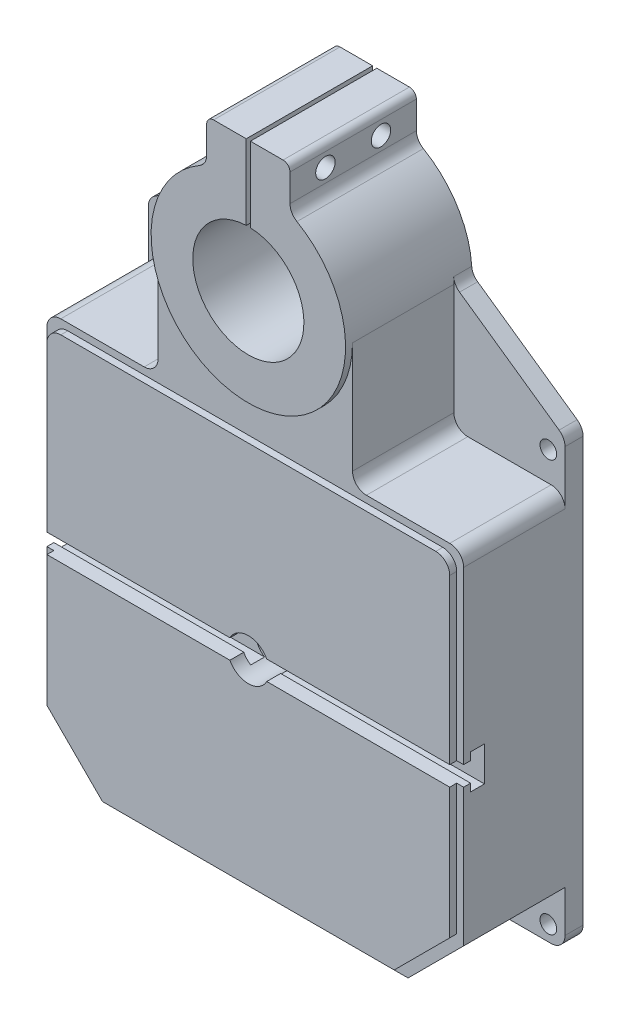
ISO-10303-21;
HEADER;
FILE_DESCRIPTION(('STEP AP214'),'2;1');
FILE_NAME('part.step','',(''),(''),'','','');
FILE_SCHEMA(('AUTOMOTIVE_DESIGN { 1 0 10303 214 1 1 1 1 }'));
ENDSEC;
DATA;
#1=APPLICATION_CONTEXT('core data for automotive mechanical design processes');
#2=APPLICATION_PROTOCOL_DEFINITION('international standard','automotive_design',2000,#1);
#3=PRODUCT_CONTEXT('',#1,'mechanical');
#4=PRODUCT('Part','Part','',(#3));
#5=PRODUCT_RELATED_PRODUCT_CATEGORY('part','',(#4));
#6=PRODUCT_DEFINITION_FORMATION('','',#4);
#7=PRODUCT_DEFINITION_CONTEXT('part definition',#1,'design');
#8=PRODUCT_DEFINITION('design','',#6,#7);
#9=PRODUCT_DEFINITION_SHAPE('','',#8);
#10=(LENGTH_UNIT() NAMED_UNIT(*) SI_UNIT(.MILLI.,.METRE.));
#11=(NAMED_UNIT(*) PLANE_ANGLE_UNIT() SI_UNIT($,.RADIAN.));
#12=(NAMED_UNIT(*) SI_UNIT($,.STERADIAN.) SOLID_ANGLE_UNIT());
#13=UNCERTAINTY_MEASURE_WITH_UNIT(LENGTH_MEASURE(1.E-05),#10,'distance_accuracy_value','');
#14=(GEOMETRIC_REPRESENTATION_CONTEXT(3) GLOBAL_UNCERTAINTY_ASSIGNED_CONTEXT((#13)) GLOBAL_UNIT_ASSIGNED_CONTEXT((#10,
#11,#12)) REPRESENTATION_CONTEXT('',''));
#15=CARTESIAN_POINT('',(0.,0.,0.));
#16=DIRECTION('',(0.,0.,1.));
#17=DIRECTION('',(1.,0.,0.));
#18=AXIS2_PLACEMENT_3D('',#15,#16,#17);
#19=CARTESIAN_POINT('',(0.,324.,13.));
#20=DIRECTION('',(0.,-1.,0.));
#21=DIRECTION('',(0.,0.,-1.));
#22=AXIS2_PLACEMENT_3D('',#19,#20,#21);
#23=PLANE('',#22);
#24=DIRECTION('',(-1.,0.,0.));
#25=VECTOR('',#24,1.);
#26=CARTESIAN_POINT('',(25.,324.,91.));
#27=LINE('',#26,#25);
#28=CARTESIAN_POINT('',(-1.49999999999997,324.,91.));
#29=VERTEX_POINT('',#28);
#30=CARTESIAN_POINT('',(-25.,324.,91.));
#31=VERTEX_POINT('',#30);
#32=EDGE_CURVE('E930',#29,#31,#27,.T.);
#33=ORIENTED_EDGE('',*,*,#32,.F.);
#34=DIRECTION('',(0.,0.,1.));
#35=VECTOR('',#34,1.);
#36=CARTESIAN_POINT('',(-1.49999999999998,324.,-0.499999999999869));
#37=LINE('',#36,#35);
#38=CARTESIAN_POINT('',(-1.49999999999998,324.,0.));
#39=VERTEX_POINT('',#38);
#40=EDGE_CURVE('E59',#39,#29,#37,.T.);
#41=ORIENTED_EDGE('',*,*,#40,.F.);
#42=DIRECTION('',(-1.,0.,0.));
#43=VECTOR('',#42,1.);
#44=CARTESIAN_POINT('',(0.,324.,0.));
#45=LINE('',#44,#43);
#46=CARTESIAN_POINT('',(-25.,324.,0.));
#47=VERTEX_POINT('',#46);
#48=EDGE_CURVE('E1196',#39,#47,#45,.T.);
#49=ORIENTED_EDGE('',*,*,#48,.T.);
#50=DIRECTION('',(0.,0.,-1.));
#51=VECTOR('',#50,1.);
#52=CARTESIAN_POINT('',(-25.,324.,13.));
#53=LINE('',#52,#51);
#54=EDGE_CURVE('E1278',#31,#47,#53,.T.);
#55=ORIENTED_EDGE('',*,*,#54,.F.);
#56=EDGE_LOOP('',(#33,#41,#49,#55));
#57=FACE_BOUND('',#56,.T.);
#58=ADVANCED_FACE('F36',(#57),#23,.F.);
#59=CARTESIAN_POINT('',(140.,130.,86.));
#60=DIRECTION('',(0.,0.,-1.));
#61=DIRECTION('',(-1.,0.,0.));
#62=AXIS2_PLACEMENT_3D('',#59,#60,#61);
#63=PLANE('',#62);
#64=DIRECTION('',(0.,1.,0.));
#65=VECTOR('',#64,1.);
#66=CARTESIAN_POINT('',(150.,-106.,86.));
#67=LINE('',#66,#65);
#68=CARTESIAN_POINT('',(150.,-106.,86.));
#69=VERTEX_POINT('',#68);
#70=CARTESIAN_POINT('',(150.,-7.,86.));
#71=VERTEX_POINT('',#70);
#72=EDGE_CURVE('E1033',#69,#71,#67,.T.);
#73=ORIENTED_EDGE('',*,*,#72,.T.);
#74=DIRECTION('',(-1.,0.,0.));
#75=VECTOR('',#74,1.);
#76=CARTESIAN_POINT('',(140.,-7.00000000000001,86.));
#77=LINE('',#76,#75);
#78=CARTESIAN_POINT('',(145.,-7.00000000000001,86.));
#79=VERTEX_POINT('',#78);
#80=EDGE_CURVE('E788',#71,#79,#77,.T.);
#81=ORIENTED_EDGE('',*,*,#80,.T.);
#82=DIRECTION('',(0.,1.,0.));
#83=VECTOR('',#82,1.);
#84=CARTESIAN_POINT('',(145.,125.,86.));
#85=LINE('',#84,#83);
#86=CARTESIAN_POINT('',(145.,-101.,86.));
#87=VERTEX_POINT('',#86);
#88=EDGE_CURVE('E957',#87,#79,#85,.T.);
#89=ORIENTED_EDGE('',*,*,#88,.F.);
#90=DIRECTION('',(0.707106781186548,0.707106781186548,0.));
#91=VECTOR('',#90,1.);
#92=CARTESIAN_POINT('',(145.,-101.,86.));
#93=LINE('',#92,#91);
#94=CARTESIAN_POINT('',(105.,-141.,86.));
#95=VERTEX_POINT('',#94);
#96=EDGE_CURVE('E994',#95,#87,#93,.T.);
#97=ORIENTED_EDGE('',*,*,#96,.F.);
#98=DIRECTION('',(1.,0.,0.));
#99=VECTOR('',#98,1.);
#100=CARTESIAN_POINT('',(105.,-141.,86.));
#101=LINE('',#100,#99);
#102=CARTESIAN_POINT('',(-105.,-141.,86.));
#103=VERTEX_POINT('',#102);
#104=EDGE_CURVE('E991',#103,#95,#101,.T.);
#105=ORIENTED_EDGE('',*,*,#104,.F.);
#106=DIRECTION('',(0.707106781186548,-0.707106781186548,0.));
#107=VECTOR('',#106,1.);
#108=CARTESIAN_POINT('',(-105.,-141.,86.));
#109=LINE('',#108,#107);
#110=CARTESIAN_POINT('',(-145.,-101.,86.));
#111=VERTEX_POINT('',#110);
#112=EDGE_CURVE('E988',#111,#103,#109,.T.);
#113=ORIENTED_EDGE('',*,*,#112,.F.);
#114=DIRECTION('',(0.,-1.,0.));
#115=VECTOR('',#114,1.);
#116=CARTESIAN_POINT('',(-145.,-101.,86.));
#117=LINE('',#116,#115);
#118=CARTESIAN_POINT('',(-145.,-7.00000000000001,86.));
#119=VERTEX_POINT('',#118);
#120=EDGE_CURVE('E984',#119,#111,#117,.T.);
#121=ORIENTED_EDGE('',*,*,#120,.F.);
#122=CARTESIAN_POINT('',(-150.,-7.,86.));
#123=VERTEX_POINT('',#122);
#124=EDGE_CURVE('E792',#119,#123,#77,.T.);
#125=ORIENTED_EDGE('',*,*,#124,.T.);
#126=DIRECTION('',(0.,-1.,0.));
#127=VECTOR('',#126,1.);
#128=CARTESIAN_POINT('',(-150.,130.,86.));
#129=LINE('',#128,#127);
#130=CARTESIAN_POINT('',(-150.,-106.,86.));
#131=VERTEX_POINT('',#130);
#132=EDGE_CURVE('E1052',#123,#131,#129,.T.);
#133=ORIENTED_EDGE('',*,*,#132,.T.);
#134=DIRECTION('',(0.707106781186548,-0.707106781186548,0.));
#135=VECTOR('',#134,1.);
#136=CARTESIAN_POINT('',(-150.,-106.,86.));
#137=LINE('',#136,#135);
#138=CARTESIAN_POINT('',(-110.,-146.,86.));
#139=VERTEX_POINT('',#138);
#140=EDGE_CURVE('E1024',#131,#139,#137,.T.);
#141=ORIENTED_EDGE('',*,*,#140,.T.);
#142=DIRECTION('',(1.,0.,0.));
#143=VECTOR('',#142,1.);
#144=CARTESIAN_POINT('',(-110.,-146.,86.));
#145=LINE('',#144,#143);
#146=CARTESIAN_POINT('',(110.,-146.,86.));
#147=VERTEX_POINT('',#146);
#148=EDGE_CURVE('E1027',#139,#147,#145,.T.);
#149=ORIENTED_EDGE('',*,*,#148,.T.);
#150=DIRECTION('',(0.707106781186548,0.707106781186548,0.));
#151=VECTOR('',#150,1.);
#152=CARTESIAN_POINT('',(110.,-146.,86.));
#153=LINE('',#152,#151);
#154=EDGE_CURVE('E1030',#147,#69,#153,.T.);
#155=ORIENTED_EDGE('',*,*,#154,.T.);
#156=EDGE_LOOP('',(#73,#81,#89,#97,#105,#113,#121,#125,#133,#141,#149,#155));
#157=FACE_BOUND('',#156,.T.);
#158=ADVANCED_FACE('F1377',(#157),#63,.F.);
#159=CARTESIAN_POINT('',(135.,125.,91.));
#160=DIRECTION('',(0.,0.,-1.));
#161=DIRECTION('',(-1.,0.,0.));
#162=AXIS2_PLACEMENT_3D('',#159,#160,#161);
#163=PLANE('',#162);
#164=DIRECTION('',(0.,1.,0.));
#165=VECTOR('',#164,1.);
#166=CARTESIAN_POINT('',(145.,125.,91.));
#167=LINE('',#166,#165);
#168=CARTESIAN_POINT('',(145.,-101.,91.));
#169=VERTEX_POINT('',#168);
#170=CARTESIAN_POINT('',(145.,-7.00000000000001,91.));
#171=VERTEX_POINT('',#170);
#172=EDGE_CURVE('E972',#169,#171,#167,.T.);
#173=ORIENTED_EDGE('',*,*,#172,.T.);
#174=DIRECTION('',(-1.,0.,0.));
#175=VECTOR('',#174,1.);
#176=CARTESIAN_POINT('',(135.,-7.00000000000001,91.));
#177=LINE('',#176,#175);
#178=CARTESIAN_POINT('',(13.2664991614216,-7.00000000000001,91.));
#179=VERTEX_POINT('',#178);
#180=EDGE_CURVE('E782',#171,#179,#177,.T.);
#181=ORIENTED_EDGE('',*,*,#180,.T.);
#182=CARTESIAN_POINT('',(0.,0.,91.));
#183=DIRECTION('',(0.,0.,1.));
#184=DIRECTION('',(1.,0.,0.));
#185=AXIS2_PLACEMENT_3D('',#182,#183,#184);
#186=CIRCLE('',#185,15.);
#187=CARTESIAN_POINT('',(-13.2664991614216,-7.00000000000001,91.));
#188=VERTEX_POINT('',#187);
#189=EDGE_CURVE('E946',#188,#179,#186,.T.);
#190=ORIENTED_EDGE('',*,*,#189,.F.);
#191=CARTESIAN_POINT('',(-145.,-7.00000000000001,91.));
#192=VERTEX_POINT('',#191);
#193=EDGE_CURVE('E786',#188,#192,#177,.T.);
#194=ORIENTED_EDGE('',*,*,#193,.T.);
#195=DIRECTION('',(0.,-1.,0.));
#196=VECTOR('',#195,1.);
#197=CARTESIAN_POINT('',(-145.,-101.,91.));
#198=LINE('',#197,#196);
#199=CARTESIAN_POINT('',(-145.,-101.,91.));
#200=VERTEX_POINT('',#199);
#201=EDGE_CURVE('E961',#192,#200,#198,.T.);
#202=ORIENTED_EDGE('',*,*,#201,.T.);
#203=DIRECTION('',(0.707106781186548,-0.707106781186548,0.));
#204=VECTOR('',#203,1.);
#205=CARTESIAN_POINT('',(-105.,-141.,91.));
#206=LINE('',#205,#204);
#207=CARTESIAN_POINT('',(-105.,-141.,91.));
#208=VERTEX_POINT('',#207);
#209=EDGE_CURVE('E965',#200,#208,#206,.T.);
#210=ORIENTED_EDGE('',*,*,#209,.T.);
#211=DIRECTION('',(1.,0.,0.));
#212=VECTOR('',#211,1.);
#213=CARTESIAN_POINT('',(105.,-141.,91.));
#214=LINE('',#213,#212);
#215=CARTESIAN_POINT('',(105.,-141.,91.));
#216=VERTEX_POINT('',#215);
#217=EDGE_CURVE('E967',#208,#216,#214,.T.);
#218=ORIENTED_EDGE('',*,*,#217,.T.);
#219=DIRECTION('',(0.707106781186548,0.707106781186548,0.));
#220=VECTOR('',#219,1.);
#221=CARTESIAN_POINT('',(145.,-101.,91.));
#222=LINE('',#221,#220);
#223=EDGE_CURVE('E969',#216,#169,#222,.T.);
#224=ORIENTED_EDGE('',*,*,#223,.T.);
#225=EDGE_LOOP('',(#173,#181,#190,#194,#202,#210,#218,#224));
#226=FACE_BOUND('',#225,.T.);
#227=ADVANCED_FACE('F1370',(#226),#163,.F.);
#228=CARTESIAN_POINT('',(-145.,-101.,91.));
#229=DIRECTION('',(1.,0.,0.));
#230=DIRECTION('',(0.,1.,0.));
#231=AXIS2_PLACEMENT_3D('',#228,#229,#230);
#232=PLANE('',#231);
#233=ORIENTED_EDGE('',*,*,#201,.F.);
#234=DIRECTION('',(0.,0.,-1.));
#235=VECTOR('',#234,1.);
#236=CARTESIAN_POINT('',(-145.,-7.00000000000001,91.));
#237=LINE('',#236,#235);
#238=EDGE_CURVE('E791',#192,#119,#237,.T.);
#239=ORIENTED_EDGE('',*,*,#238,.T.);
#240=ORIENTED_EDGE('',*,*,#120,.T.);
#241=DIRECTION('',(0.,0.,-1.));
#242=VECTOR('',#241,1.);
#243=CARTESIAN_POINT('',(-145.,-101.,91.));
#244=LINE('',#243,#242);
#245=EDGE_CURVE('E1011',#200,#111,#244,.T.);
#246=ORIENTED_EDGE('',*,*,#245,.F.);
#247=EDGE_LOOP('',(#233,#239,#240,#246));
#248=FACE_BOUND('',#247,.T.);
#249=ADVANCED_FACE('F1393',(#248),#232,.F.);
#250=CARTESIAN_POINT('',(145.,125.,91.));
#251=DIRECTION('',(-1.,0.,0.));
#252=DIRECTION('',(0.,-1.,0.));
#253=AXIS2_PLACEMENT_3D('',#250,#251,#252);
#254=PLANE('',#253);
#255=ORIENTED_EDGE('',*,*,#88,.T.);
#256=DIRECTION('',(0.,0.,1.));
#257=VECTOR('',#256,1.);
#258=CARTESIAN_POINT('',(145.,-7.00000000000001,91.));
#259=LINE('',#258,#257);
#260=EDGE_CURVE('E1331',#79,#171,#259,.T.);
#261=ORIENTED_EDGE('',*,*,#260,.T.);
#262=ORIENTED_EDGE('',*,*,#172,.F.);
#263=DIRECTION('',(0.,0.,-1.));
#264=VECTOR('',#263,1.);
#265=CARTESIAN_POINT('',(145.,-101.,91.));
#266=LINE('',#265,#264);
#267=EDGE_CURVE('E1002',#169,#87,#266,.T.);
#268=ORIENTED_EDGE('',*,*,#267,.T.);
#269=EDGE_LOOP('',(#255,#261,#262,#268));
#270=FACE_BOUND('',#269,.T.);
#271=ADVANCED_FACE('F1374',(#270),#254,.F.);
#272=CARTESIAN_POINT('',(-137.,127.,66.));
#273=DIRECTION('',(-1.,0.,0.));
#274=DIRECTION('',(0.,-1.,0.));
#275=AXIS2_PLACEMENT_3D('',#272,#273,#274);
#276=PLANE('',#275);
#277=CARTESIAN_POINT('',(-137.,100.,35.));
#278=DIRECTION('',(-1.,0.,0.));
#279=DIRECTION('',(0.,0.,1.));
#280=AXIS2_PLACEMENT_3D('',#277,#278,#279);
#281=CIRCLE('',#280,11.);
#282=CARTESIAN_POINT('',(-137.,100.,46.));
#283=VERTEX_POINT('',#282);
#284=EDGE_CURVE('E649',#283,#283,#281,.T.);
#285=ORIENTED_EDGE('',*,*,#284,.T.);
#286=EDGE_LOOP('',(#285));
#287=FACE_BOUND('',#286,.T.);
#288=DIRECTION('',(0.,1.,0.));
#289=VECTOR('',#288,1.);
#290=CARTESIAN_POINT('',(-137.,127.,66.));
#291=LINE('',#290,#289);
#292=CARTESIAN_POINT('',(-137.,27.5,66.));
#293=VERTEX_POINT('',#292);
#294=CARTESIAN_POINT('',(-137.,127.,66.));
#295=VERTEX_POINT('',#294);
#296=EDGE_CURVE('E854',#293,#295,#291,.T.);
#297=ORIENTED_EDGE('',*,*,#296,.F.);
#298=DIRECTION('',(0.,0.,1.));
#299=VECTOR('',#298,1.);
#300=CARTESIAN_POINT('',(-137.,27.5,51.));
#301=LINE('',#300,#299);
#302=CARTESIAN_POINT('',(-137.,27.5,51.));
#303=VERTEX_POINT('',#302);
#304=EDGE_CURVE('E1306',#293,#303,#301,.F.);
#305=ORIENTED_EDGE('',*,*,#304,.T.);
#306=DIRECTION('',(0.,1.,0.));
#307=VECTOR('',#306,1.);
#308=CARTESIAN_POINT('',(-137.,22.5,51.));
#309=LINE('',#308,#307);
#310=CARTESIAN_POINT('',(-137.,-27.5,51.));
#311=VERTEX_POINT('',#310);
#312=EDGE_CURVE('E807',#311,#303,#309,.T.);
#313=ORIENTED_EDGE('',*,*,#312,.F.);
#314=DIRECTION('',(0.,0.,1.));
#315=VECTOR('',#314,1.);
#316=CARTESIAN_POINT('',(-137.,-27.5,66.));
#317=LINE('',#316,#315);
#318=CARTESIAN_POINT('',(-137.,-27.5,66.));
#319=VERTEX_POINT('',#318);
#320=EDGE_CURVE('E1303',#311,#319,#317,.T.);
#321=ORIENTED_EDGE('',*,*,#320,.T.);
#322=CARTESIAN_POINT('',(-137.,-93.,66.));
#323=VERTEX_POINT('',#322);
#324=EDGE_CURVE('E855',#323,#319,#291,.T.);
#325=ORIENTED_EDGE('',*,*,#324,.F.);
#326=DIRECTION('',(0.,0.,-1.));
#327=VECTOR('',#326,1.);
#328=CARTESIAN_POINT('',(-137.,-93.,66.));
#329=LINE('',#328,#327);
#330=CARTESIAN_POINT('',(-137.,-93.,0.));
#331=VERTEX_POINT('',#330);
#332=EDGE_CURVE('E605',#323,#331,#329,.T.);
#333=ORIENTED_EDGE('',*,*,#332,.T.);
#334=DIRECTION('',(0.,1.,0.));
#335=VECTOR('',#334,1.);
#336=CARTESIAN_POINT('',(-137.,127.,0.));
#337=LINE('',#336,#335);
#338=CARTESIAN_POINT('',(-137.,127.,0.));
#339=VERTEX_POINT('',#338);
#340=EDGE_CURVE('E821',#331,#339,#337,.T.);
#341=ORIENTED_EDGE('',*,*,#340,.T.);
#342=DIRECTION('',(0.,0.,-1.));
#343=VECTOR('',#342,1.);
#344=CARTESIAN_POINT('',(-137.,127.,66.));
#345=LINE('',#344,#343);
#346=EDGE_CURVE('E893',#295,#339,#345,.T.);
#347=ORIENTED_EDGE('',*,*,#346,.F.);
#348=EDGE_LOOP('',(#297,#305,#313,#321,#325,#333,#341,#347));
#349=FACE_BOUND('',#348,.T.);
#350=ADVANCED_FACE('F1780',(#287,#349),#276,.F.);
#351=CARTESIAN_POINT('',(137.,-83.,66.));
#352=DIRECTION('',(1.,0.,0.));
#353=DIRECTION('',(0.,1.,0.));
#354=AXIS2_PLACEMENT_3D('',#351,#352,#353);
#355=PLANE('',#354);
#356=DIRECTION('',(0.,-1.,0.));
#357=VECTOR('',#356,1.);
#358=CARTESIAN_POINT('',(137.,22.5,51.));
#359=LINE('',#358,#357);
#360=CARTESIAN_POINT('',(137.,27.5,51.));
#361=VERTEX_POINT('',#360);
#362=CARTESIAN_POINT('',(137.,-27.5,51.));
#363=VERTEX_POINT('',#362);
#364=EDGE_CURVE('E801',#361,#363,#359,.T.);
#365=ORIENTED_EDGE('',*,*,#364,.F.);
#366=DIRECTION('',(0.,0.,1.));
#367=VECTOR('',#366,1.);
#368=CARTESIAN_POINT('',(137.,27.5,66.));
#369=LINE('',#368,#367);
#370=CARTESIAN_POINT('',(137.,27.5,66.));
#371=VERTEX_POINT('',#370);
#372=EDGE_CURVE('E1291',#361,#371,#369,.T.);
#373=ORIENTED_EDGE('',*,*,#372,.T.);
#374=DIRECTION('',(0.,-1.,0.));
#375=VECTOR('',#374,1.);
#376=CARTESIAN_POINT('',(137.,-83.,66.));
#377=LINE('',#376,#375);
#378=CARTESIAN_POINT('',(137.,127.,66.));
#379=VERTEX_POINT('',#378);
#380=EDGE_CURVE('E851',#379,#371,#377,.T.);
#381=ORIENTED_EDGE('',*,*,#380,.F.);
#382=DIRECTION('',(0.,0.,-1.));
#383=VECTOR('',#382,1.);
#384=CARTESIAN_POINT('',(137.,127.,66.));
#385=LINE('',#384,#383);
#386=CARTESIAN_POINT('',(137.,127.,0.));
#387=VERTEX_POINT('',#386);
#388=EDGE_CURVE('E896',#379,#387,#385,.T.);
#389=ORIENTED_EDGE('',*,*,#388,.T.);
#390=DIRECTION('',(0.,-1.,0.));
#391=VECTOR('',#390,1.);
#392=CARTESIAN_POINT('',(137.,-83.,0.));
#393=LINE('',#392,#391);
#394=CARTESIAN_POINT('',(137.,-92.9999999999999,0.));
#395=VERTEX_POINT('',#394);
#396=EDGE_CURVE('E889',#387,#395,#393,.T.);
#397=ORIENTED_EDGE('',*,*,#396,.T.);
#398=DIRECTION('',(0.,0.,-1.));
#399=VECTOR('',#398,1.);
#400=CARTESIAN_POINT('',(137.,-92.9999999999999,66.));
#401=LINE('',#400,#399);
#402=CARTESIAN_POINT('',(137.,-92.9999999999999,66.));
#403=VERTEX_POINT('',#402);
#404=EDGE_CURVE('E629',#403,#395,#401,.T.);
#405=ORIENTED_EDGE('',*,*,#404,.F.);
#406=CARTESIAN_POINT('',(137.,-27.5,66.));
#407=VERTEX_POINT('',#406);
#408=EDGE_CURVE('E850',#407,#403,#377,.T.);
#409=ORIENTED_EDGE('',*,*,#408,.F.);
#410=DIRECTION('',(0.,0.,1.));
#411=VECTOR('',#410,1.);
#412=CARTESIAN_POINT('',(137.,-27.5,51.));
#413=LINE('',#412,#411);
#414=EDGE_CURVE('E1081',#407,#363,#413,.F.);
#415=ORIENTED_EDGE('',*,*,#414,.T.);
#416=EDGE_LOOP('',(#365,#373,#381,#389,#397,#405,#409,#415));
#417=FACE_BOUND('',#416,.T.);
#418=ADVANCED_FACE('F1799',(#417),#355,.F.);
#419=CARTESIAN_POINT('',(-127.,127.,66.));
#420=DIRECTION('',(0.,0.,1.));
#421=DIRECTION('',(1.,0.,0.));
#422=AXIS2_PLACEMENT_3D('',#419,#420,#421);
#423=PLANE('',#422);
#424=DIRECTION('',(-0.707106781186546,0.707106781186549,0.));
#425=VECTOR('',#424,1.);
#426=CARTESIAN_POINT('',(-115.,-115.,66.));
#427=LINE('',#426,#425);
#428=CARTESIAN_POINT('',(-97.0000000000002,-133.,66.));
#429=VERTEX_POINT('',#428);
#430=EDGE_CURVE('E610',#429,#323,#427,.T.);
#431=ORIENTED_EDGE('',*,*,#430,.T.);
#432=ORIENTED_EDGE('',*,*,#324,.T.);
#433=CARTESIAN_POINT('',(-132.,-27.5,66.));
#434=DIRECTION('',(0.,0.,1.));
#435=DIRECTION('',(1.,0.,0.));
#436=AXIS2_PLACEMENT_3D('',#433,#434,#435);
#437=CIRCLE('',#436,5.);
#438=CARTESIAN_POINT('',(-132.,-22.5,66.));
#439=VERTEX_POINT('',#438);
#440=EDGE_CURVE('E1311',#319,#439,#437,.F.);
#441=ORIENTED_EDGE('',*,*,#440,.T.);
#442=DIRECTION('',(-1.,0.,0.));
#443=VECTOR('',#442,1.);
#444=CARTESIAN_POINT('',(-137.,-22.5,66.));
#445=LINE('',#444,#443);
#446=CARTESIAN_POINT('',(132.,-22.5,66.));
#447=VERTEX_POINT('',#446);
#448=EDGE_CURVE('E800',#447,#439,#445,.T.);
#449=ORIENTED_EDGE('',*,*,#448,.F.);
#450=CARTESIAN_POINT('',(132.,-27.5,66.));
#451=DIRECTION('',(0.,0.,1.));
#452=DIRECTION('',(1.,0.,0.));
#453=AXIS2_PLACEMENT_3D('',#450,#451,#452);
#454=CIRCLE('',#453,5.);
#455=EDGE_CURVE('E1309',#447,#407,#454,.F.);
#456=ORIENTED_EDGE('',*,*,#455,.T.);
#457=ORIENTED_EDGE('',*,*,#408,.T.);
#458=DIRECTION('',(-0.707106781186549,-0.707106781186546,0.));
#459=VECTOR('',#458,1.);
#460=CARTESIAN_POINT('',(115.,-115.,66.));
#461=LINE('',#460,#459);
#462=CARTESIAN_POINT('',(96.9999999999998,-133.,66.));
#463=VERTEX_POINT('',#462);
#464=EDGE_CURVE('E606',#403,#463,#461,.T.);
#465=ORIENTED_EDGE('',*,*,#464,.T.);
#466=DIRECTION('',(-1.,0.,0.));
#467=VECTOR('',#466,1.);
#468=CARTESIAN_POINT('',(0.,-133.,66.));
#469=LINE('',#468,#467);
#470=EDGE_CURVE('E598',#463,#429,#469,.T.);
#471=ORIENTED_EDGE('',*,*,#470,.T.);
#472=EDGE_LOOP('',(#431,#432,#441,#449,#456,#457,#465,#471));
#473=FACE_BOUND('',#472,.T.);
#474=ADVANCED_FACE('F616',(#473),#423,.F.);
#475=ORIENTED_EDGE('',*,*,#380,.T.);
#476=CARTESIAN_POINT('',(132.,27.5,66.));
#477=DIRECTION('',(0.,0.,1.));
#478=DIRECTION('',(1.,0.,0.));
#479=AXIS2_PLACEMENT_3D('',#476,#477,#478);
#480=CIRCLE('',#479,5.);
#481=CARTESIAN_POINT('',(132.,22.5,66.));
#482=VERTEX_POINT('',#481);
#483=EDGE_CURVE('E1296',#371,#482,#480,.F.);
#484=ORIENTED_EDGE('',*,*,#483,.T.);
#485=DIRECTION('',(1.,0.,0.));
#486=VECTOR('',#485,1.);
#487=CARTESIAN_POINT('',(-137.,22.5,66.));
#488=LINE('',#487,#486);
#489=CARTESIAN_POINT('',(-132.,22.5,66.));
#490=VERTEX_POINT('',#489);
#491=EDGE_CURVE('E804',#490,#482,#488,.T.);
#492=ORIENTED_EDGE('',*,*,#491,.F.);
#493=CARTESIAN_POINT('',(-132.,27.5,66.));
#494=DIRECTION('',(0.,0.,1.));
#495=DIRECTION('',(1.,0.,0.));
#496=AXIS2_PLACEMENT_3D('',#493,#494,#495);
#497=CIRCLE('',#496,5.);
#498=EDGE_CURVE('E1294',#490,#293,#497,.F.);
#499=ORIENTED_EDGE('',*,*,#498,.T.);
#500=ORIENTED_EDGE('',*,*,#296,.T.);
#501=CARTESIAN_POINT('',(-127.,127.,66.));
#502=DIRECTION('',(0.,0.,-1.));
#503=DIRECTION('',(1.,0.,0.));
#504=AXIS2_PLACEMENT_3D('',#501,#502,#503);
#505=CIRCLE('',#504,10.);
#506=CARTESIAN_POINT('',(-127.,137.,66.));
#507=VERTEX_POINT('',#506);
#508=EDGE_CURVE('E817',#295,#507,#505,.T.);
#509=ORIENTED_EDGE('',*,*,#508,.T.);
#510=DIRECTION('',(1.,0.,0.));
#511=VECTOR('',#510,1.);
#512=CARTESIAN_POINT('',(-69.0000000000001,137.,66.));
#513=LINE('',#512,#511);
#514=CARTESIAN_POINT('',(-69.0000000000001,137.,66.));
#515=VERTEX_POINT('',#514);
#516=EDGE_CURVE('E820',#507,#515,#513,.T.);
#517=ORIENTED_EDGE('',*,*,#516,.T.);
#518=CARTESIAN_POINT('',(-69.0000000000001,147.,66.));
#519=DIRECTION('',(0.,0.,1.));
#520=DIRECTION('',(-1.,0.,0.));
#521=AXIS2_PLACEMENT_3D('',#518,#519,#520);
#522=CIRCLE('',#521,10.);
#523=CARTESIAN_POINT('',(-59.0000000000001,147.,66.));
#524=VERTEX_POINT('',#523);
#525=EDGE_CURVE('E824',#515,#524,#522,.T.);
#526=ORIENTED_EDGE('',*,*,#525,.T.);
#527=DIRECTION('',(0.,1.,0.));
#528=VECTOR('',#527,1.);
#529=CARTESIAN_POINT('',(-59.,172.,66.));
#530=LINE('',#529,#528);
#531=CARTESIAN_POINT('',(-59.,172.,66.));
#532=VERTEX_POINT('',#531);
#533=EDGE_CURVE('E827',#524,#532,#530,.T.);
#534=ORIENTED_EDGE('',*,*,#533,.T.);
#535=CARTESIAN_POINT('',(-49.,172.,66.));
#536=DIRECTION('',(0.,0.,-1.));
#537=DIRECTION('',(1.,0.,0.));
#538=AXIS2_PLACEMENT_3D('',#535,#536,#537);
#539=CIRCLE('',#538,10.);
#540=CARTESIAN_POINT('',(-48.9999999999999,182.,66.));
#541=VERTEX_POINT('',#540);
#542=EDGE_CURVE('E830',#532,#541,#539,.T.);
#543=ORIENTED_EDGE('',*,*,#542,.T.);
#544=DIRECTION('',(1.,0.,0.));
#545=VECTOR('',#544,1.);
#546=CARTESIAN_POINT('',(0.,182.,66.));
#547=LINE('',#546,#545);
#548=CARTESIAN_POINT('',(48.9999999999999,182.,66.));
#549=VERTEX_POINT('',#548);
#550=EDGE_CURVE('E833',#541,#549,#547,.T.);
#551=ORIENTED_EDGE('',*,*,#550,.T.);
#552=CARTESIAN_POINT('',(49.,172.,66.));
#553=DIRECTION('',(0.,0.,-1.));
#554=DIRECTION('',(-1.,0.,0.));
#555=AXIS2_PLACEMENT_3D('',#552,#553,#554);
#556=CIRCLE('',#555,10.);
#557=CARTESIAN_POINT('',(59.,172.,66.));
#558=VERTEX_POINT('',#557);
#559=EDGE_CURVE('E835',#549,#558,#556,.T.);
#560=ORIENTED_EDGE('',*,*,#559,.T.);
#561=DIRECTION('',(0.,-1.,0.));
#562=VECTOR('',#561,1.);
#563=CARTESIAN_POINT('',(59.,172.,66.));
#564=LINE('',#563,#562);
#565=CARTESIAN_POINT('',(58.9999999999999,147.,66.));
#566=VERTEX_POINT('',#565);
#567=EDGE_CURVE('E838',#558,#566,#564,.T.);
#568=ORIENTED_EDGE('',*,*,#567,.T.);
#569=CARTESIAN_POINT('',(68.9999999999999,147.,66.));
#570=DIRECTION('',(0.,0.,1.));
#571=DIRECTION('',(1.,0.,0.));
#572=AXIS2_PLACEMENT_3D('',#569,#570,#571);
#573=CIRCLE('',#572,10.);
#574=CARTESIAN_POINT('',(69.,137.,66.));
#575=VERTEX_POINT('',#574);
#576=EDGE_CURVE('E841',#566,#575,#573,.T.);
#577=ORIENTED_EDGE('',*,*,#576,.T.);
#578=DIRECTION('',(1.,0.,0.));
#579=VECTOR('',#578,1.);
#580=CARTESIAN_POINT('',(127.,137.,66.));
#581=LINE('',#580,#579);
#582=CARTESIAN_POINT('',(127.,137.,66.));
#583=VERTEX_POINT('',#582);
#584=EDGE_CURVE('E844',#575,#583,#581,.T.);
#585=ORIENTED_EDGE('',*,*,#584,.T.);
#586=CARTESIAN_POINT('',(127.,127.,66.));
#587=DIRECTION('',(0.,0.,-1.));
#588=DIRECTION('',(1.,0.,0.));
#589=AXIS2_PLACEMENT_3D('',#586,#587,#588);
#590=CIRCLE('',#589,10.);
#591=EDGE_CURVE('E847',#583,#379,#590,.T.);
#592=ORIENTED_EDGE('',*,*,#591,.T.);
#593=EDGE_LOOP('',(#475,#484,#492,#499,#500,#509,#517,#526,#534,#543,#551,#560,#568,#577,#585,#592));
#594=FACE_BOUND('',#593,.T.);
#595=ADVANCED_FACE('F1859',(#594),#423,.F.);
#596=CARTESIAN_POINT('',(-150.,130.,86.));
#597=VERTEX_POINT('',#596);
#598=CARTESIAN_POINT('',(-150.,7.,86.));
#599=VERTEX_POINT('',#598);
#600=EDGE_CURVE('E1053',#597,#599,#129,.T.);
#601=ORIENTED_EDGE('',*,*,#600,.T.);
#602=DIRECTION('',(1.,0.,0.));
#603=VECTOR('',#602,1.);
#604=CARTESIAN_POINT('',(140.,7.00000000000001,86.));
#605=LINE('',#604,#603);
#606=CARTESIAN_POINT('',(-145.,7.00000000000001,86.));
#607=VERTEX_POINT('',#606);
#608=EDGE_CURVE('E777',#599,#607,#605,.T.);
#609=ORIENTED_EDGE('',*,*,#608,.T.);
#610=CARTESIAN_POINT('',(-145.,125.,86.));
#611=VERTEX_POINT('',#610);
#612=EDGE_CURVE('E985',#611,#607,#117,.T.);
#613=ORIENTED_EDGE('',*,*,#612,.F.);
#614=CARTESIAN_POINT('',(-135.,125.,86.));
#615=DIRECTION('',(0.,0.,1.));
#616=DIRECTION('',(1.,0.,0.));
#617=AXIS2_PLACEMENT_3D('',#614,#615,#616);
#618=CIRCLE('',#617,10.);
#619=CARTESIAN_POINT('',(-135.,135.,86.));
#620=VERTEX_POINT('',#619);
#621=EDGE_CURVE('E981',#620,#611,#618,.T.);
#622=ORIENTED_EDGE('',*,*,#621,.F.);
#623=DIRECTION('',(-1.,0.,0.));
#624=VECTOR('',#623,1.);
#625=CARTESIAN_POINT('',(-135.,135.,86.));
#626=LINE('',#625,#624);
#627=CARTESIAN_POINT('',(135.,135.,86.));
#628=VERTEX_POINT('',#627);
#629=EDGE_CURVE('E978',#628,#620,#626,.T.);
#630=ORIENTED_EDGE('',*,*,#629,.F.);
#631=CARTESIAN_POINT('',(135.,125.,86.));
#632=DIRECTION('',(0.,0.,1.));
#633=DIRECTION('',(-1.,0.,0.));
#634=AXIS2_PLACEMENT_3D('',#631,#632,#633);
#635=CIRCLE('',#634,10.);
#636=CARTESIAN_POINT('',(145.,125.,86.));
#637=VERTEX_POINT('',#636);
#638=EDGE_CURVE('E952',#637,#628,#635,.T.);
#639=ORIENTED_EDGE('',*,*,#638,.F.);
#640=CARTESIAN_POINT('',(145.,7.00000000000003,86.));
#641=VERTEX_POINT('',#640);
#642=EDGE_CURVE('E997',#641,#637,#85,.T.);
#643=ORIENTED_EDGE('',*,*,#642,.F.);
#644=CARTESIAN_POINT('',(150.,7.,86.));
#645=VERTEX_POINT('',#644);
#646=EDGE_CURVE('E773',#641,#645,#605,.T.);
#647=ORIENTED_EDGE('',*,*,#646,.T.);
#648=CARTESIAN_POINT('',(150.,130.,86.));
#649=VERTEX_POINT('',#648);
#650=EDGE_CURVE('E1032',#645,#649,#67,.T.);
#651=ORIENTED_EDGE('',*,*,#650,.T.);
#652=CARTESIAN_POINT('',(140.,130.,86.));
#653=DIRECTION('',(0.,0.,1.));
#654=DIRECTION('',(-1.,0.,0.));
#655=AXIS2_PLACEMENT_3D('',#652,#653,#654);
#656=CIRCLE('',#655,10.);
#657=CARTESIAN_POINT('',(140.,140.,86.));
#658=VERTEX_POINT('',#657);
#659=EDGE_CURVE('E1036',#649,#658,#656,.T.);
#660=ORIENTED_EDGE('',*,*,#659,.T.);
#661=DIRECTION('',(-1.,0.,0.));
#662=VECTOR('',#661,1.);
#663=CARTESIAN_POINT('',(80.0000000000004,140.,86.));
#664=LINE('',#663,#662);
#665=CARTESIAN_POINT('',(80.0000000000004,140.,86.));
#666=VERTEX_POINT('',#665);
#667=EDGE_CURVE('E1038',#658,#666,#664,.T.);
#668=ORIENTED_EDGE('',*,*,#667,.T.);
#669=CARTESIAN_POINT('',(80.0000000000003,150.,86.));
#670=DIRECTION('',(0.,0.,-1.));
#671=DIRECTION('',(1.,0.,0.));
#672=AXIS2_PLACEMENT_3D('',#669,#670,#671);
#673=CIRCLE('',#672,10.);
#674=CARTESIAN_POINT('',(70.0000000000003,150.,86.));
#675=VERTEX_POINT('',#674);
#676=EDGE_CURVE('E1040',#666,#675,#673,.T.);
#677=ORIENTED_EDGE('',*,*,#676,.T.);
#678=DIRECTION('',(0.,1.,0.));
#679=VECTOR('',#678,1.);
#680=CARTESIAN_POINT('',(70.,230.,86.));
#681=LINE('',#680,#679);
#682=CARTESIAN_POINT('',(70.,230.,86.));
#683=VERTEX_POINT('',#682);
#684=EDGE_CURVE('E1042',#675,#683,#681,.T.);
#685=ORIENTED_EDGE('',*,*,#684,.T.);
#686=CARTESIAN_POINT('',(0.,230.,86.));
#687=DIRECTION('',(0.,0.,1.));
#688=DIRECTION('',(1.,0.,0.));
#689=AXIS2_PLACEMENT_3D('',#686,#687,#688);
#690=CIRCLE('',#689,70.);
#691=CARTESIAN_POINT('',(-70.,230.,86.));
#692=VERTEX_POINT('',#691);
#693=EDGE_CURVE('E920',#692,#683,#690,.T.);
#694=ORIENTED_EDGE('',*,*,#693,.F.);
#695=DIRECTION('',(0.,-1.,0.));
#696=VECTOR('',#695,1.);
#697=CARTESIAN_POINT('',(-70.,230.,86.));
#698=LINE('',#697,#696);
#699=CARTESIAN_POINT('',(-69.9999999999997,150.,86.));
#700=VERTEX_POINT('',#699);
#701=EDGE_CURVE('E1044',#692,#700,#698,.T.);
#702=ORIENTED_EDGE('',*,*,#701,.T.);
#703=CARTESIAN_POINT('',(-79.9999999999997,150.,86.));
#704=DIRECTION('',(0.,0.,-1.));
#705=DIRECTION('',(-1.,0.,0.));
#706=AXIS2_PLACEMENT_3D('',#703,#704,#705);
#707=CIRCLE('',#706,10.);
#708=CARTESIAN_POINT('',(-79.9999999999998,140.,86.));
#709=VERTEX_POINT('',#708);
#710=EDGE_CURVE('E1046',#700,#709,#707,.T.);
#711=ORIENTED_EDGE('',*,*,#710,.T.);
#712=DIRECTION('',(-1.,0.,0.));
#713=VECTOR('',#712,1.);
#714=CARTESIAN_POINT('',(-140.,140.,86.));
#715=LINE('',#714,#713);
#716=CARTESIAN_POINT('',(-140.,140.,86.));
#717=VERTEX_POINT('',#716);
#718=EDGE_CURVE('E1048',#709,#717,#715,.T.);
#719=ORIENTED_EDGE('',*,*,#718,.T.);
#720=CARTESIAN_POINT('',(-140.,130.,86.));
#721=DIRECTION('',(0.,0.,1.));
#722=DIRECTION('',(1.,0.,0.));
#723=AXIS2_PLACEMENT_3D('',#720,#721,#722);
#724=CIRCLE('',#723,10.);
#725=EDGE_CURVE('E1050',#717,#597,#724,.T.);
#726=ORIENTED_EDGE('',*,*,#725,.T.);
#727=EDGE_LOOP('',(#601,#609,#613,#622,#630,#639,#643,#647,#651,#660,#668,#677,#685,#694,#702,
#711,#719,#726));
#728=FACE_BOUND('',#727,.T.);
#729=ADVANCED_FACE('F1453',(#728),#63,.F.);
#730=CARTESIAN_POINT('',(40.0000000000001,299.282032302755,13.));
#731=DIRECTION('',(0.,0.,1.));
#732=DIRECTION('',(1.,0.,0.));
#733=AXIS2_PLACEMENT_3D('',#730,#731,#732);
#734=PLANE('',#733);
#735=DIRECTION('',(0.707106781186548,-0.707106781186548,0.));
#736=VECTOR('',#735,1.);
#737=CARTESIAN_POINT('',(-150.,-106.,13.));
#738=LINE('',#737,#736);
#739=CARTESIAN_POINT('',(-150.,-106.,13.));
#740=VERTEX_POINT('',#739);
#741=CARTESIAN_POINT('',(-110.,-146.,13.));
#742=VERTEX_POINT('',#741);
#743=EDGE_CURVE('E1023',#740,#742,#738,.T.);
#744=ORIENTED_EDGE('',*,*,#743,.F.);
#745=DIRECTION('',(0.,-1.,0.));
#746=VECTOR('',#745,1.);
#747=CARTESIAN_POINT('',(-150.,-136.,13.));
#748=LINE('',#747,#746);
#749=CARTESIAN_POINT('',(-150.,-136.,13.));
#750=VERTEX_POINT('',#749);
#751=EDGE_CURVE('E1169',#740,#750,#748,.T.);
#752=ORIENTED_EDGE('',*,*,#751,.T.);
#753=CARTESIAN_POINT('',(-140.,-136.,13.));
#754=DIRECTION('',(0.,0.,1.));
#755=DIRECTION('',(1.,0.,0.));
#756=AXIS2_PLACEMENT_3D('',#753,#754,#755);
#757=CIRCLE('',#756,10.);
#758=CARTESIAN_POINT('',(-140.,-146.,13.));
#759=VERTEX_POINT('',#758);
#760=EDGE_CURVE('E1172',#750,#759,#757,.T.);
#761=ORIENTED_EDGE('',*,*,#760,.T.);
#762=DIRECTION('',(1.,0.,0.));
#763=VECTOR('',#762,1.);
#764=CARTESIAN_POINT('',(140.,-146.,13.));
#765=LINE('',#764,#763);
#766=EDGE_CURVE('E1175',#759,#742,#765,.T.);
#767=ORIENTED_EDGE('',*,*,#766,.T.);
#768=EDGE_LOOP('',(#744,#752,#761,#767));
#769=FACE_BOUND('',#768,.T.);
#770=CARTESIAN_POINT('',(-138.,-135.,13.));
#771=DIRECTION('',(0.,0.,1.));
#772=DIRECTION('',(1.,0.,0.));
#773=AXIS2_PLACEMENT_3D('',#770,#771,#772);
#774=CIRCLE('',#773,6.00000000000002);
#775=CARTESIAN_POINT('',(-144.,-135.,13.));
#776=VERTEX_POINT('',#775);
#777=EDGE_CURVE('E1153',#776,#776,#774,.T.);
#778=ORIENTED_EDGE('',*,*,#777,.F.);
#779=EDGE_LOOP('',(#778));
#780=FACE_BOUND('',#779,.T.);
#781=ADVANCED_FACE('F1667',(#769,#780),#734,.T.);
#782=CARTESIAN_POINT('',(-140.,130.,13.));
#783=DIRECTION('',(0.,0.,1.));
#784=DIRECTION('',(1.,0.,0.));
#785=AXIS2_PLACEMENT_3D('',#782,#783,#784);
#786=CIRCLE('',#785,10.);
#787=CARTESIAN_POINT('',(-140.,140.,13.));
#788=VERTEX_POINT('',#787);
#789=CARTESIAN_POINT('',(-150.,130.,13.));
#790=VERTEX_POINT('',#789);
#791=EDGE_CURVE('E1028',#788,#790,#786,.T.);
#792=ORIENTED_EDGE('',*,*,#791,.F.);
#793=DIRECTION('',(-1.,0.,0.));
#794=VECTOR('',#793,1.);
#795=CARTESIAN_POINT('',(-140.,140.,13.));
#796=LINE('',#795,#794);
#797=CARTESIAN_POINT('',(-79.9999999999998,140.,13.));
#798=VERTEX_POINT('',#797);
#799=EDGE_CURVE('E1088',#798,#788,#796,.T.);
#800=ORIENTED_EDGE('',*,*,#799,.F.);
#801=CARTESIAN_POINT('',(-79.9999999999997,150.,13.));
#802=DIRECTION('',(0.,0.,-1.));
#803=DIRECTION('',(-1.,0.,0.));
#804=AXIS2_PLACEMENT_3D('',#801,#802,#803);
#805=CIRCLE('',#804,10.);
#806=CARTESIAN_POINT('',(-69.9999999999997,150.,13.));
#807=VERTEX_POINT('',#806);
#808=EDGE_CURVE('E1085',#807,#798,#805,.T.);
#809=ORIENTED_EDGE('',*,*,#808,.F.);
#810=DIRECTION('',(0.,-1.,0.));
#811=VECTOR('',#810,1.);
#812=CARTESIAN_POINT('',(-70.,230.,13.));
#813=LINE('',#812,#811);
#814=CARTESIAN_POINT('',(-70.,230.,13.));
#815=VERTEX_POINT('',#814);
#816=EDGE_CURVE('E1077',#815,#807,#813,.T.);
#817=ORIENTED_EDGE('',*,*,#816,.F.);
#818=CARTESIAN_POINT('',(0.,230.,13.));
#819=DIRECTION('',(0.,0.,1.));
#820=DIRECTION('',(1.,0.,0.));
#821=AXIS2_PLACEMENT_3D('',#818,#819,#820);
#822=CIRCLE('',#821,70.);
#823=CARTESIAN_POINT('',(-69.8434383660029,234.679115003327,13.));
#824=VERTEX_POINT('',#823);
#825=EDGE_CURVE('E1078',#824,#815,#822,.T.);
#826=ORIENTED_EDGE('',*,*,#825,.F.);
#827=CARTESIAN_POINT('',(-79.821072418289,235.347560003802,13.));
#828=DIRECTION('',(0.,0.,-1.));
#829=DIRECTION('',(-1.,0.,0.));
#830=AXIS2_PLACEMENT_3D('',#827,#828,#829);
#831=CIRCLE('',#830,10.);
#832=CARTESIAN_POINT('',(-74.0853080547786,227.156039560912,13.));
#833=VERTEX_POINT('',#832);
#834=EDGE_CURVE('E1162',#824,#833,#831,.T.);
#835=ORIENTED_EDGE('',*,*,#834,.T.);
#836=DIRECTION('',(-0.819152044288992,-0.573576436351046,0.));
#837=VECTOR('',#836,1.);
#838=CARTESIAN_POINT('',(-145.73576436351,176.985849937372,13.));
#839=LINE('',#838,#837);
#840=CARTESIAN_POINT('',(-145.73576436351,176.985849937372,13.));
#841=VERTEX_POINT('',#840);
#842=EDGE_CURVE('E1164',#833,#841,#839,.T.);
#843=ORIENTED_EDGE('',*,*,#842,.T.);
#844=CARTESIAN_POINT('',(-140.,168.794329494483,13.));
#845=DIRECTION('',(0.,0.,1.));
#846=DIRECTION('',(1.,0.,0.));
#847=AXIS2_PLACEMENT_3D('',#844,#845,#846);
#848=CIRCLE('',#847,10.);
#849=CARTESIAN_POINT('',(-150.,168.794329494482,13.));
#850=VERTEX_POINT('',#849);
#851=EDGE_CURVE('E1167',#841,#850,#848,.T.);
#852=ORIENTED_EDGE('',*,*,#851,.T.);
#853=EDGE_CURVE('E1170',#850,#790,#748,.T.);
#854=ORIENTED_EDGE('',*,*,#853,.T.);
#855=EDGE_LOOP('',(#792,#800,#809,#817,#826,#835,#843,#852,#854));
#856=FACE_BOUND('',#855,.T.);
#857=CARTESIAN_POINT('',(-138.,161.,13.));
#858=DIRECTION('',(0.,0.,1.));
#859=DIRECTION('',(1.,0.,0.));
#860=AXIS2_PLACEMENT_3D('',#857,#858,#859);
#861=CIRCLE('',#860,6.00000000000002);
#862=CARTESIAN_POINT('',(-144.,161.,13.));
#863=VERTEX_POINT('',#862);
#864=EDGE_CURVE('E1147',#863,#863,#861,.T.);
#865=ORIENTED_EDGE('',*,*,#864,.F.);
#866=EDGE_LOOP('',(#865));
#867=FACE_BOUND('',#866,.T.);
#868=ADVANCED_FACE('F1958',(#856,#867),#734,.T.);
#869=CARTESIAN_POINT('',(0.,230.,13.));
#870=DIRECTION('',(0.,0.,1.));
#871=DIRECTION('',(1.,0.,0.));
#872=AXIS2_PLACEMENT_3D('',#869,#870,#871);
#873=CIRCLE('',#872,70.);
#874=CARTESIAN_POINT('',(70.,230.,13.));
#875=VERTEX_POINT('',#874);
#876=CARTESIAN_POINT('',(69.8434383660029,234.679115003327,13.));
#877=VERTEX_POINT('',#876);
#878=EDGE_CURVE('E1074',#875,#877,#873,.T.);
#879=ORIENTED_EDGE('',*,*,#878,.F.);
#880=DIRECTION('',(0.,1.,0.));
#881=VECTOR('',#880,1.);
#882=CARTESIAN_POINT('',(70.,230.,13.));
#883=LINE('',#882,#881);
#884=CARTESIAN_POINT('',(70.0000000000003,150.,13.));
#885=VERTEX_POINT('',#884);
#886=EDGE_CURVE('E1071',#885,#875,#883,.T.);
#887=ORIENTED_EDGE('',*,*,#886,.F.);
#888=CARTESIAN_POINT('',(80.0000000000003,150.,13.));
#889=DIRECTION('',(0.,0.,-1.));
#890=DIRECTION('',(1.,0.,0.));
#891=AXIS2_PLACEMENT_3D('',#888,#889,#890);
#892=CIRCLE('',#891,10.);
#893=CARTESIAN_POINT('',(80.0000000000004,140.,13.));
#894=VERTEX_POINT('',#893);
#895=EDGE_CURVE('E1068',#894,#885,#892,.T.);
#896=ORIENTED_EDGE('',*,*,#895,.F.);
#897=DIRECTION('',(-1.,0.,0.));
#898=VECTOR('',#897,1.);
#899=CARTESIAN_POINT('',(80.0000000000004,140.,13.));
#900=LINE('',#899,#898);
#901=CARTESIAN_POINT('',(140.,140.,13.));
#902=VERTEX_POINT('',#901);
#903=EDGE_CURVE('E1065',#902,#894,#900,.T.);
#904=ORIENTED_EDGE('',*,*,#903,.F.);
#905=CARTESIAN_POINT('',(140.,130.,13.));
#906=DIRECTION('',(0.,0.,1.));
#907=DIRECTION('',(-1.,0.,0.));
#908=AXIS2_PLACEMENT_3D('',#905,#906,#907);
#909=CIRCLE('',#908,10.);
#910=CARTESIAN_POINT('',(150.,130.,13.));
#911=VERTEX_POINT('',#910);
#912=EDGE_CURVE('E1062',#911,#902,#909,.T.);
#913=ORIENTED_EDGE('',*,*,#912,.F.);
#914=DIRECTION('',(0.,1.,0.));
#915=VECTOR('',#914,1.);
#916=CARTESIAN_POINT('',(150.,168.794329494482,13.));
#917=LINE('',#916,#915);
#918=CARTESIAN_POINT('',(150.,168.794329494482,13.));
#919=VERTEX_POINT('',#918);
#920=EDGE_CURVE('E1179',#911,#919,#917,.T.);
#921=ORIENTED_EDGE('',*,*,#920,.T.);
#922=CARTESIAN_POINT('',(140.,168.794329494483,13.));
#923=DIRECTION('',(0.,0.,1.));
#924=DIRECTION('',(-1.,0.,0.));
#925=AXIS2_PLACEMENT_3D('',#922,#923,#924);
#926=CIRCLE('',#925,10.);
#927=CARTESIAN_POINT('',(145.73576436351,176.985849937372,13.));
#928=VERTEX_POINT('',#927);
#929=EDGE_CURVE('E1182',#919,#928,#926,.T.);
#930=ORIENTED_EDGE('',*,*,#929,.T.);
#931=DIRECTION('',(-0.819152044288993,0.573576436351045,0.));
#932=VECTOR('',#931,1.);
#933=CARTESIAN_POINT('',(145.73576436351,176.985849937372,13.));
#934=LINE('',#933,#932);
#935=CARTESIAN_POINT('',(74.0853080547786,227.156039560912,13.));
#936=VERTEX_POINT('',#935);
#937=EDGE_CURVE('E1184',#928,#936,#934,.T.);
#938=ORIENTED_EDGE('',*,*,#937,.T.);
#939=CARTESIAN_POINT('',(79.821072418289,235.347560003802,13.));
#940=DIRECTION('',(0.,0.,-1.));
#941=DIRECTION('',(-1.,0.,0.));
#942=AXIS2_PLACEMENT_3D('',#939,#940,#941);
#943=CIRCLE('',#942,10.);
#944=EDGE_CURVE('E1186',#936,#877,#943,.T.);
#945=ORIENTED_EDGE('',*,*,#944,.T.);
#946=EDGE_LOOP('',(#879,#887,#896,#904,#913,#921,#930,#938,#945));
#947=FACE_BOUND('',#946,.T.);
#948=CARTESIAN_POINT('',(138.,161.,13.));
#949=DIRECTION('',(0.,0.,1.));
#950=DIRECTION('',(-1.,0.,0.));
#951=AXIS2_PLACEMENT_3D('',#948,#949,#950);
#952=CIRCLE('',#951,6.00000000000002);
#953=CARTESIAN_POINT('',(132.,161.,13.));
#954=VERTEX_POINT('',#953);
#955=EDGE_CURVE('E1135',#954,#954,#952,.T.);
#956=ORIENTED_EDGE('',*,*,#955,.F.);
#957=EDGE_LOOP('',(#956));
#958=FACE_BOUND('',#957,.T.);
#959=ADVANCED_FACE('F1665',(#947,#958),#734,.T.);
#960=DIRECTION('',(0.707106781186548,0.707106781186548,0.));
#961=VECTOR('',#960,1.);
#962=CARTESIAN_POINT('',(110.,-146.,13.));
#963=LINE('',#962,#961);
#964=CARTESIAN_POINT('',(110.,-146.,13.));
#965=VERTEX_POINT('',#964);
#966=CARTESIAN_POINT('',(150.,-106.,13.));
#967=VERTEX_POINT('',#966);
#968=EDGE_CURVE('E1059',#965,#967,#963,.T.);
#969=ORIENTED_EDGE('',*,*,#968,.F.);
#970=CARTESIAN_POINT('',(140.,-146.,13.));
#971=VERTEX_POINT('',#970);
#972=EDGE_CURVE('E1174',#965,#971,#765,.T.);
#973=ORIENTED_EDGE('',*,*,#972,.T.);
#974=CARTESIAN_POINT('',(140.,-136.,13.));
#975=DIRECTION('',(0.,0.,1.));
#976=DIRECTION('',(-1.,0.,0.));
#977=AXIS2_PLACEMENT_3D('',#974,#975,#976);
#978=CIRCLE('',#977,10.);
#979=CARTESIAN_POINT('',(150.,-136.,13.));
#980=VERTEX_POINT('',#979);
#981=EDGE_CURVE('E1177',#971,#980,#978,.T.);
#982=ORIENTED_EDGE('',*,*,#981,.T.);
#983=EDGE_CURVE('E1180',#980,#967,#917,.T.);
#984=ORIENTED_EDGE('',*,*,#983,.T.);
#985=EDGE_LOOP('',(#969,#973,#982,#984));
#986=FACE_BOUND('',#985,.T.);
#987=CARTESIAN_POINT('',(138.,-135.,13.));
#988=DIRECTION('',(0.,0.,1.));
#989=DIRECTION('',(-1.,0.,0.));
#990=AXIS2_PLACEMENT_3D('',#987,#988,#989);
#991=CIRCLE('',#990,6.00000000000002);
#992=CARTESIAN_POINT('',(132.,-135.,13.));
#993=VERTEX_POINT('',#992);
#994=EDGE_CURVE('E1141',#993,#993,#991,.T.);
#995=ORIENTED_EDGE('',*,*,#994,.F.);
#996=EDGE_LOOP('',(#995));
#997=FACE_BOUND('',#996,.T.);
#998=ADVANCED_FACE('F1662',(#986,#997),#734,.T.);
#999=CARTESIAN_POINT('',(40.0000000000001,299.282032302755,0.));
#1000=DIRECTION('',(0.,0.,1.));
#1001=DIRECTION('',(1.,0.,0.));
#1002=AXIS2_PLACEMENT_3D('',#999,#1000,#1001);
#1003=PLANE('',#1002);
#1004=DIRECTION('',(-0.707106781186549,-0.707106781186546,0.));
#1005=VECTOR('',#1004,1.);
#1006=CARTESIAN_POINT('',(115.,-115.,0.));
#1007=LINE('',#1006,#1005);
#1008=CARTESIAN_POINT('',(96.9999999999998,-133.,0.));
#1009=VERTEX_POINT('',#1008);
#1010=EDGE_CURVE('E618',#395,#1009,#1007,.T.);
#1011=ORIENTED_EDGE('',*,*,#1010,.F.);
#1012=ORIENTED_EDGE('',*,*,#396,.F.);
#1013=CARTESIAN_POINT('',(127.,127.,0.));
#1014=DIRECTION('',(0.,0.,-1.));
#1015=DIRECTION('',(1.,0.,0.));
#1016=AXIS2_PLACEMENT_3D('',#1013,#1014,#1015);
#1017=CIRCLE('',#1016,10.);
#1018=CARTESIAN_POINT('',(127.,137.,0.));
#1019=VERTEX_POINT('',#1018);
#1020=EDGE_CURVE('E886',#1019,#387,#1017,.T.);
#1021=ORIENTED_EDGE('',*,*,#1020,.F.);
#1022=DIRECTION('',(1.,0.,0.));
#1023=VECTOR('',#1022,1.);
#1024=CARTESIAN_POINT('',(127.,137.,0.));
#1025=LINE('',#1024,#1023);
#1026=CARTESIAN_POINT('',(69.,137.,0.));
#1027=VERTEX_POINT('',#1026);
#1028=EDGE_CURVE('E883',#1027,#1019,#1025,.T.);
#1029=ORIENTED_EDGE('',*,*,#1028,.F.);
#1030=CARTESIAN_POINT('',(68.9999999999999,147.,0.));
#1031=DIRECTION('',(0.,0.,1.));
#1032=DIRECTION('',(1.,0.,0.));
#1033=AXIS2_PLACEMENT_3D('',#1030,#1031,#1032);
#1034=CIRCLE('',#1033,10.);
#1035=CARTESIAN_POINT('',(58.9999999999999,147.,0.));
#1036=VERTEX_POINT('',#1035);
#1037=EDGE_CURVE('E880',#1036,#1027,#1034,.T.);
#1038=ORIENTED_EDGE('',*,*,#1037,.F.);
#1039=DIRECTION('',(0.,-1.,0.));
#1040=VECTOR('',#1039,1.);
#1041=CARTESIAN_POINT('',(59.,172.,0.));
#1042=LINE('',#1041,#1040);
#1043=CARTESIAN_POINT('',(59.,172.,0.));
#1044=VERTEX_POINT('',#1043);
#1045=EDGE_CURVE('E877',#1044,#1036,#1042,.T.);
#1046=ORIENTED_EDGE('',*,*,#1045,.F.);
#1047=CARTESIAN_POINT('',(49.,172.,0.));
#1048=DIRECTION('',(0.,0.,-1.));
#1049=DIRECTION('',(-1.,0.,0.));
#1050=AXIS2_PLACEMENT_3D('',#1047,#1048,#1049);
#1051=CIRCLE('',#1050,10.);
#1052=CARTESIAN_POINT('',(48.9999999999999,182.,0.));
#1053=VERTEX_POINT('',#1052);
#1054=EDGE_CURVE('E874',#1053,#1044,#1051,.T.);
#1055=ORIENTED_EDGE('',*,*,#1054,.F.);
#1056=DIRECTION('',(1.,0.,0.));
#1057=VECTOR('',#1056,1.);
#1058=CARTESIAN_POINT('',(0.,182.,0.));
#1059=LINE('',#1058,#1057);
#1060=CARTESIAN_POINT('',(-48.9999999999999,182.,0.));
#1061=VERTEX_POINT('',#1060);
#1062=EDGE_CURVE('E871',#1061,#1053,#1059,.T.);
#1063=ORIENTED_EDGE('',*,*,#1062,.F.);
#1064=CARTESIAN_POINT('',(-49.,172.,0.));
#1065=DIRECTION('',(0.,0.,-1.));
#1066=DIRECTION('',(1.,0.,0.));
#1067=AXIS2_PLACEMENT_3D('',#1064,#1065,#1066);
#1068=CIRCLE('',#1067,10.);
#1069=CARTESIAN_POINT('',(-59.,172.,0.));
#1070=VERTEX_POINT('',#1069);
#1071=EDGE_CURVE('E868',#1070,#1061,#1068,.T.);
#1072=ORIENTED_EDGE('',*,*,#1071,.F.);
#1073=DIRECTION('',(0.,1.,0.));
#1074=VECTOR('',#1073,1.);
#1075=CARTESIAN_POINT('',(-59.,172.,0.));
#1076=LINE('',#1075,#1074);
#1077=CARTESIAN_POINT('',(-59.0000000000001,147.,0.));
#1078=VERTEX_POINT('',#1077);
#1079=EDGE_CURVE('E865',#1078,#1070,#1076,.T.);
#1080=ORIENTED_EDGE('',*,*,#1079,.F.);
#1081=CARTESIAN_POINT('',(-69.0000000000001,147.,0.));
#1082=DIRECTION('',(0.,0.,1.));
#1083=DIRECTION('',(-1.,0.,0.));
#1084=AXIS2_PLACEMENT_3D('',#1081,#1082,#1083);
#1085=CIRCLE('',#1084,10.);
#1086=CARTESIAN_POINT('',(-69.0000000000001,137.,0.));
#1087=VERTEX_POINT('',#1086);
#1088=EDGE_CURVE('E862',#1087,#1078,#1085,.T.);
#1089=ORIENTED_EDGE('',*,*,#1088,.F.);
#1090=DIRECTION('',(1.,0.,0.));
#1091=VECTOR('',#1090,1.);
#1092=CARTESIAN_POINT('',(-69.0000000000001,137.,0.));
#1093=LINE('',#1092,#1091);
#1094=CARTESIAN_POINT('',(-127.,137.,0.));
#1095=VERTEX_POINT('',#1094);
#1096=EDGE_CURVE('E859',#1095,#1087,#1093,.T.);
#1097=ORIENTED_EDGE('',*,*,#1096,.F.);
#1098=CARTESIAN_POINT('',(-127.,127.,0.));
#1099=DIRECTION('',(0.,0.,-1.));
#1100=DIRECTION('',(1.,0.,0.));
#1101=AXIS2_PLACEMENT_3D('',#1098,#1099,#1100);
#1102=CIRCLE('',#1101,10.);
#1103=EDGE_CURVE('E812',#339,#1095,#1102,.T.);
#1104=ORIENTED_EDGE('',*,*,#1103,.F.);
#1105=ORIENTED_EDGE('',*,*,#340,.F.);
#1106=DIRECTION('',(-0.707106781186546,0.707106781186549,0.));
#1107=VECTOR('',#1106,1.);
#1108=CARTESIAN_POINT('',(-115.,-115.,0.));
#1109=LINE('',#1108,#1107);
#1110=CARTESIAN_POINT('',(-97.0000000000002,-133.,0.));
#1111=VERTEX_POINT('',#1110);
#1112=EDGE_CURVE('E621',#1111,#331,#1109,.T.);
#1113=ORIENTED_EDGE('',*,*,#1112,.F.);
#1114=DIRECTION('',(-1.,0.,0.));
#1115=VECTOR('',#1114,1.);
#1116=CARTESIAN_POINT('',(0.,-133.,0.));
#1117=LINE('',#1116,#1115);
#1118=EDGE_CURVE('E601',#1009,#1111,#1117,.T.);
#1119=ORIENTED_EDGE('',*,*,#1118,.F.);
#1120=EDGE_LOOP('',(#1011,#1012,#1021,#1029,#1038,#1046,#1055,#1063,#1072,#1080,#1089,#1097,
#1104,#1105,#1113,#1119));
#1121=FACE_BOUND('',#1120,.T.);
#1122=ORIENTED_EDGE('',*,*,#48,.F.);
#1123=DIRECTION('',(0.,-1.,0.));
#1124=VECTOR('',#1123,1.);
#1125=CARTESIAN_POINT('',(-1.49999999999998,299.282032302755,0.));
#1126=LINE('',#1125,#1124);
#1127=CARTESIAN_POINT('',(-1.49999999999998,269.971865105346,0.));
#1128=VERTEX_POINT('',#1127);
#1129=EDGE_CURVE('E699',#39,#1128,#1126,.T.);
#1130=ORIENTED_EDGE('',*,*,#1129,.T.);
#1131=CARTESIAN_POINT('',(0.,230.,0.));
#1132=DIRECTION('',(0.,0.,1.));
#1133=DIRECTION('',(1.,0.,0.));
#1134=AXIS2_PLACEMENT_3D('',#1131,#1132,#1133);
#1135=CIRCLE('',#1134,40.);
#1136=CARTESIAN_POINT('',(1.5,269.971865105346,0.));
#1137=VERTEX_POINT('',#1136);
#1138=EDGE_CURVE('E1156',#1128,#1137,#1135,.T.);
#1139=ORIENTED_EDGE('',*,*,#1138,.T.);
#1140=DIRECTION('',(0.,1.,0.));
#1141=VECTOR('',#1140,1.);
#1142=CARTESIAN_POINT('',(1.49999999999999,299.282032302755,0.));
#1143=LINE('',#1142,#1141);
#1144=CARTESIAN_POINT('',(1.5,324.,0.));
#1145=VERTEX_POINT('',#1144);
#1146=EDGE_CURVE('E694',#1137,#1145,#1143,.T.);
#1147=ORIENTED_EDGE('',*,*,#1146,.T.);
#1148=CARTESIAN_POINT('',(25.,324.,0.));
#1149=VERTEX_POINT('',#1148);
#1150=EDGE_CURVE('E1197',#1149,#1145,#45,.T.);
#1151=ORIENTED_EDGE('',*,*,#1150,.F.);
#1152=CARTESIAN_POINT('',(25.,319.,0.));
#1153=DIRECTION('',(0.,0.,1.));
#1154=DIRECTION('',(-1.,0.,0.));
#1155=AXIS2_PLACEMENT_3D('',#1152,#1153,#1154);
#1156=CIRCLE('',#1155,5.);
#1157=CARTESIAN_POINT('',(30.,319.,0.));
#1158=VERTEX_POINT('',#1157);
#1159=EDGE_CURVE('E1193',#1158,#1149,#1156,.T.);
#1160=ORIENTED_EDGE('',*,*,#1159,.F.);
#1161=DIRECTION('',(0.,1.,0.));
#1162=VECTOR('',#1161,1.);
#1163=CARTESIAN_POINT('',(30.,319.,0.));
#1164=LINE('',#1163,#1162);
#1165=CARTESIAN_POINT('',(30.0000000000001,299.282032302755,0.));
#1166=VERTEX_POINT('',#1165);
#1167=EDGE_CURVE('E1191',#1166,#1158,#1164,.T.);
#1168=ORIENTED_EDGE('',*,*,#1167,.F.);
#1169=CARTESIAN_POINT('',(40.0000000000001,299.282032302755,0.));
#1170=DIRECTION('',(0.,0.,-1.));
#1171=DIRECTION('',(1.,0.,0.));
#1172=AXIS2_PLACEMENT_3D('',#1169,#1170,#1171);
#1173=CIRCLE('',#1172,10.);
#1174=CARTESIAN_POINT('',(35.0000000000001,290.621778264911,0.));
#1175=VERTEX_POINT('',#1174);
#1176=EDGE_CURVE('E1161',#1175,#1166,#1173,.T.);
#1177=ORIENTED_EDGE('',*,*,#1176,.F.);
#1178=CARTESIAN_POINT('',(0.,230.,0.));
#1179=DIRECTION('',(0.,0.,1.));
#1180=DIRECTION('',(1.,0.,0.));
#1181=AXIS2_PLACEMENT_3D('',#1178,#1179,#1180);
#1182=CIRCLE('',#1181,70.);
#1183=CARTESIAN_POINT('',(69.8434383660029,234.679115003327,0.));
#1184=VERTEX_POINT('',#1183);
#1185=EDGE_CURVE('E1165',#1184,#1175,#1182,.T.);
#1186=ORIENTED_EDGE('',*,*,#1185,.F.);
#1187=CARTESIAN_POINT('',(79.821072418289,235.347560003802,0.));
#1188=DIRECTION('',(0.,0.,-1.));
#1189=DIRECTION('',(-1.,0.,0.));
#1190=AXIS2_PLACEMENT_3D('',#1187,#1188,#1189);
#1191=CIRCLE('',#1190,10.);
#1192=CARTESIAN_POINT('',(74.0853080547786,227.156039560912,0.));
#1193=VERTEX_POINT('',#1192);
#1194=EDGE_CURVE('E1228',#1193,#1184,#1191,.T.);
#1195=ORIENTED_EDGE('',*,*,#1194,.F.);
#1196=DIRECTION('',(-0.819152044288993,0.573576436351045,0.));
#1197=VECTOR('',#1196,1.);
#1198=CARTESIAN_POINT('',(145.73576436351,176.985849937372,0.));
#1199=LINE('',#1198,#1197);
#1200=CARTESIAN_POINT('',(145.73576436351,176.985849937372,0.));
#1201=VERTEX_POINT('',#1200);
#1202=EDGE_CURVE('E1226',#1201,#1193,#1199,.T.);
#1203=ORIENTED_EDGE('',*,*,#1202,.F.);
#1204=CARTESIAN_POINT('',(140.,168.794329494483,0.));
#1205=DIRECTION('',(0.,0.,1.));
#1206=DIRECTION('',(-1.,0.,0.));
#1207=AXIS2_PLACEMENT_3D('',#1204,#1205,#1206);
#1208=CIRCLE('',#1207,10.);
#1209=CARTESIAN_POINT('',(150.,168.794329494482,0.));
#1210=VERTEX_POINT('',#1209);
#1211=EDGE_CURVE('E1224',#1210,#1201,#1208,.T.);
#1212=ORIENTED_EDGE('',*,*,#1211,.F.);
#1213=DIRECTION('',(0.,1.,0.));
#1214=VECTOR('',#1213,1.);
#1215=CARTESIAN_POINT('',(150.,168.794329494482,0.));
#1216=LINE('',#1215,#1214);
#1217=CARTESIAN_POINT('',(150.,-136.,0.));
#1218=VERTEX_POINT('',#1217);
#1219=EDGE_CURVE('E1222',#1218,#1210,#1216,.T.);
#1220=ORIENTED_EDGE('',*,*,#1219,.F.);
#1221=CARTESIAN_POINT('',(140.,-136.,0.));
#1222=DIRECTION('',(0.,0.,1.));
#1223=DIRECTION('',(-1.,0.,0.));
#1224=AXIS2_PLACEMENT_3D('',#1221,#1222,#1223);
#1225=CIRCLE('',#1224,10.);
#1226=CARTESIAN_POINT('',(140.,-146.,0.));
#1227=VERTEX_POINT('',#1226);
#1228=EDGE_CURVE('E1220',#1227,#1218,#1225,.T.);
#1229=ORIENTED_EDGE('',*,*,#1228,.F.);
#1230=DIRECTION('',(1.,0.,0.));
#1231=VECTOR('',#1230,1.);
#1232=CARTESIAN_POINT('',(140.,-146.,0.));
#1233=LINE('',#1232,#1231);
#1234=CARTESIAN_POINT('',(-140.,-146.,0.));
#1235=VERTEX_POINT('',#1234);
#1236=EDGE_CURVE('E1218',#1235,#1227,#1233,.T.);
#1237=ORIENTED_EDGE('',*,*,#1236,.F.);
#1238=CARTESIAN_POINT('',(-140.,-136.,0.));
#1239=DIRECTION('',(0.,0.,1.));
#1240=DIRECTION('',(1.,0.,0.));
#1241=AXIS2_PLACEMENT_3D('',#1238,#1239,#1240);
#1242=CIRCLE('',#1241,10.);
#1243=CARTESIAN_POINT('',(-150.,-136.,0.));
#1244=VERTEX_POINT('',#1243);
#1245=EDGE_CURVE('E1216',#1244,#1235,#1242,.T.);
#1246=ORIENTED_EDGE('',*,*,#1245,.F.);
#1247=DIRECTION('',(0.,-1.,0.));
#1248=VECTOR('',#1247,1.);
#1249=CARTESIAN_POINT('',(-150.,-136.,0.));
#1250=LINE('',#1249,#1248);
#1251=CARTESIAN_POINT('',(-150.,168.794329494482,0.));
#1252=VERTEX_POINT('',#1251);
#1253=EDGE_CURVE('E1214',#1252,#1244,#1250,.T.);
#1254=ORIENTED_EDGE('',*,*,#1253,.F.);
#1255=CARTESIAN_POINT('',(-140.,168.794329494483,0.));
#1256=DIRECTION('',(0.,0.,1.));
#1257=DIRECTION('',(1.,0.,0.));
#1258=AXIS2_PLACEMENT_3D('',#1255,#1256,#1257);
#1259=CIRCLE('',#1258,10.);
#1260=CARTESIAN_POINT('',(-145.73576436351,176.985849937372,0.));
#1261=VERTEX_POINT('',#1260);
#1262=EDGE_CURVE('E1212',#1261,#1252,#1259,.T.);
#1263=ORIENTED_EDGE('',*,*,#1262,.F.);
#1264=DIRECTION('',(-0.819152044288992,-0.573576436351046,0.));
#1265=VECTOR('',#1264,1.);
#1266=CARTESIAN_POINT('',(-145.73576436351,176.985849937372,0.));
#1267=LINE('',#1266,#1265);
#1268=CARTESIAN_POINT('',(-74.0853080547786,227.156039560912,0.));
#1269=VERTEX_POINT('',#1268);
#1270=EDGE_CURVE('E1210',#1269,#1261,#1267,.T.);
#1271=ORIENTED_EDGE('',*,*,#1270,.F.);
#1272=CARTESIAN_POINT('',(-79.821072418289,235.347560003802,0.));
#1273=DIRECTION('',(0.,0.,-1.));
#1274=DIRECTION('',(-1.,0.,0.));
#1275=AXIS2_PLACEMENT_3D('',#1272,#1273,#1274);
#1276=CIRCLE('',#1275,10.);
#1277=CARTESIAN_POINT('',(-69.8434383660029,234.679115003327,0.));
#1278=VERTEX_POINT('',#1277);
#1279=EDGE_CURVE('E1208',#1278,#1269,#1276,.T.);
#1280=ORIENTED_EDGE('',*,*,#1279,.F.);
#1281=CARTESIAN_POINT('',(0.,230.,0.));
#1282=DIRECTION('',(0.,0.,1.));
#1283=DIRECTION('',(1.,0.,0.));
#1284=AXIS2_PLACEMENT_3D('',#1281,#1282,#1283);
#1285=CIRCLE('',#1284,70.);
#1286=CARTESIAN_POINT('',(-35.,290.621778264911,0.));
#1287=VERTEX_POINT('',#1286);
#1288=EDGE_CURVE('E1206',#1287,#1278,#1285,.T.);
#1289=ORIENTED_EDGE('',*,*,#1288,.F.);
#1290=CARTESIAN_POINT('',(-40.,299.282032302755,0.));
#1291=DIRECTION('',(0.,0.,-1.));
#1292=DIRECTION('',(-1.,0.,0.));
#1293=AXIS2_PLACEMENT_3D('',#1290,#1291,#1292);
#1294=CIRCLE('',#1293,10.);
#1295=CARTESIAN_POINT('',(-30.,299.282032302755,0.));
#1296=VERTEX_POINT('',#1295);
#1297=EDGE_CURVE('E1204',#1296,#1287,#1294,.T.);
#1298=ORIENTED_EDGE('',*,*,#1297,.F.);
#1299=DIRECTION('',(0.,-1.,0.));
#1300=VECTOR('',#1299,1.);
#1301=CARTESIAN_POINT('',(-30.,319.,0.));
#1302=LINE('',#1301,#1300);
#1303=CARTESIAN_POINT('',(-30.,319.,0.));
#1304=VERTEX_POINT('',#1303);
#1305=EDGE_CURVE('E1202',#1304,#1296,#1302,.T.);
#1306=ORIENTED_EDGE('',*,*,#1305,.F.);
#1307=CARTESIAN_POINT('',(-25.,319.,0.));
#1308=DIRECTION('',(0.,0.,1.));
#1309=DIRECTION('',(-1.,0.,0.));
#1310=AXIS2_PLACEMENT_3D('',#1307,#1308,#1309);
#1311=CIRCLE('',#1310,5.);
#1312=EDGE_CURVE('E1200',#47,#1304,#1311,.T.);
#1313=ORIENTED_EDGE('',*,*,#1312,.F.);
#1314=EDGE_LOOP('',(#1122,#1130,#1139,#1147,#1151,#1160,#1168,#1177,#1186,#1195,#1203,#1212,
#1220,#1229,#1237,#1246,#1254,#1263,#1271,#1280,#1289,#1298,#1306,#1313));
#1315=FACE_BOUND('',#1314,.T.);
#1316=CARTESIAN_POINT('',(-138.,-135.,0.));
#1317=DIRECTION('',(0.,0.,1.));
#1318=DIRECTION('',(1.,0.,0.));
#1319=AXIS2_PLACEMENT_3D('',#1316,#1317,#1318);
#1320=CIRCLE('',#1319,6.00000000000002);
#1321=CARTESIAN_POINT('',(-144.,-135.,0.));
#1322=VERTEX_POINT('',#1321);
#1323=EDGE_CURVE('E1150',#1322,#1322,#1320,.T.);
#1324=ORIENTED_EDGE('',*,*,#1323,.T.);
#1325=EDGE_LOOP('',(#1324));
#1326=FACE_BOUND('',#1325,.T.);
#1327=CARTESIAN_POINT('',(-138.,161.,0.));
#1328=DIRECTION('',(0.,0.,1.));
#1329=DIRECTION('',(1.,0.,0.));
#1330=AXIS2_PLACEMENT_3D('',#1327,#1328,#1329);
#1331=CIRCLE('',#1330,6.00000000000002);
#1332=CARTESIAN_POINT('',(-144.,161.,0.));
#1333=VERTEX_POINT('',#1332);
#1334=EDGE_CURVE('E1144',#1333,#1333,#1331,.T.);
#1335=ORIENTED_EDGE('',*,*,#1334,.T.);
#1336=EDGE_LOOP('',(#1335));
#1337=FACE_BOUND('',#1336,.T.);
#1338=CARTESIAN_POINT('',(138.,-135.,0.));
#1339=DIRECTION('',(0.,0.,1.));
#1340=DIRECTION('',(-1.,0.,0.));
#1341=AXIS2_PLACEMENT_3D('',#1338,#1339,#1340);
#1342=CIRCLE('',#1341,6.00000000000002);
#1343=CARTESIAN_POINT('',(132.,-135.,0.));
#1344=VERTEX_POINT('',#1343);
#1345=EDGE_CURVE('E1138',#1344,#1344,#1342,.T.);
#1346=ORIENTED_EDGE('',*,*,#1345,.T.);
#1347=EDGE_LOOP('',(#1346));
#1348=FACE_BOUND('',#1347,.T.);
#1349=CARTESIAN_POINT('',(138.,161.,0.));
#1350=DIRECTION('',(0.,0.,1.));
#1351=DIRECTION('',(-1.,0.,0.));
#1352=AXIS2_PLACEMENT_3D('',#1349,#1350,#1351);
#1353=CIRCLE('',#1352,6.00000000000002);
#1354=CARTESIAN_POINT('',(132.,161.,0.));
#1355=VERTEX_POINT('',#1354);
#1356=EDGE_CURVE('E1134',#1355,#1355,#1353,.T.);
#1357=ORIENTED_EDGE('',*,*,#1356,.T.);
#1358=EDGE_LOOP('',(#1357));
#1359=FACE_BOUND('',#1358,.T.);
#1360=ADVANCED_FACE('F1575',(#1121,#1315,#1326,#1337,#1348,#1359),#1003,.F.);
#1361=CARTESIAN_POINT('',(40.0000000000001,299.282032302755,13.));
#1362=DIRECTION('',(0.,0.,-1.));
#1363=DIRECTION('',(-1.,0.,0.));
#1364=AXIS2_PLACEMENT_3D('',#1361,#1362,#1363);
#1365=CYLINDRICAL_SURFACE('',#1364,10.);
#1366=ORIENTED_EDGE('',*,*,#1176,.T.);
#1367=DIRECTION('',(0.,0.,-1.));
#1368=VECTOR('',#1367,1.);
#1369=CARTESIAN_POINT('',(30.0000000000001,299.282032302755,13.));
#1370=LINE('',#1369,#1368);
#1371=CARTESIAN_POINT('',(30.0000000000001,299.282032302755,91.));
#1372=VERTEX_POINT('',#1371);
#1373=EDGE_CURVE('E1082',#1372,#1166,#1370,.T.);
#1374=ORIENTED_EDGE('',*,*,#1373,.F.);
#1375=CARTESIAN_POINT('',(40.0000000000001,299.282032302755,91.));
#1376=DIRECTION('',(0.,0.,-1.));
#1377=DIRECTION('',(1.,0.,0.));
#1378=AXIS2_PLACEMENT_3D('',#1375,#1376,#1377);
#1379=CIRCLE('',#1378,10.);
#1380=CARTESIAN_POINT('',(35.0000000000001,290.621778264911,91.));
#1381=VERTEX_POINT('',#1380);
#1382=EDGE_CURVE('E921',#1381,#1372,#1379,.T.);
#1383=ORIENTED_EDGE('',*,*,#1382,.F.);
#1384=DIRECTION('',(0.,0.,-1.));
#1385=VECTOR('',#1384,1.);
#1386=CARTESIAN_POINT('',(35.0000000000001,290.621778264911,13.));
#1387=LINE('',#1386,#1385);
#1388=EDGE_CURVE('E1188',#1381,#1175,#1387,.T.);
#1389=ORIENTED_EDGE('',*,*,#1388,.T.);
#1390=EDGE_LOOP('',(#1366,#1374,#1383,#1389));
#1391=FACE_BOUND('',#1390,.T.);
#1392=ADVANCED_FACE('F1585',(#1391),#1365,.F.);
#1393=CARTESIAN_POINT('',(30.,319.,13.));
#1394=DIRECTION('',(-1.,0.,0.));
#1395=DIRECTION('',(0.,-1.,0.));
#1396=AXIS2_PLACEMENT_3D('',#1393,#1394,#1395);
#1397=PLANE('',#1396);
#1398=CARTESIAN_POINT('',(30.,309.,25.5));
#1399=DIRECTION('',(1.,0.,0.));
#1400=DIRECTION('',(0.,1.,0.));
#1401=AXIS2_PLACEMENT_3D('',#1398,#1399,#1400);
#1402=CIRCLE('',#1401,7.);
#1403=CARTESIAN_POINT('',(30.,316.,25.5));
#1404=VERTEX_POINT('',#1403);
#1405=EDGE_CURVE('E678',#1404,#1404,#1402,.T.);
#1406=ORIENTED_EDGE('',*,*,#1405,.F.);
#1407=EDGE_LOOP('',(#1406));
#1408=FACE_BOUND('',#1407,.T.);
#1409=CARTESIAN_POINT('',(30.,309.,65.5));
#1410=DIRECTION('',(1.,0.,0.));
#1411=DIRECTION('',(0.,1.,0.));
#1412=AXIS2_PLACEMENT_3D('',#1409,#1410,#1411);
#1413=CIRCLE('',#1412,7.);
#1414=CARTESIAN_POINT('',(30.,316.,65.5));
#1415=VERTEX_POINT('',#1414);
#1416=EDGE_CURVE('E682',#1415,#1415,#1413,.T.);
#1417=ORIENTED_EDGE('',*,*,#1416,.F.);
#1418=EDGE_LOOP('',(#1417));
#1419=FACE_BOUND('',#1418,.T.);
#1420=ORIENTED_EDGE('',*,*,#1167,.T.);
#1421=DIRECTION('',(0.,0.,-1.));
#1422=VECTOR('',#1421,1.);
#1423=CARTESIAN_POINT('',(30.,319.,13.));
#1424=LINE('',#1423,#1422);
#1425=CARTESIAN_POINT('',(30.,319.,91.));
#1426=VERTEX_POINT('',#1425);
#1427=EDGE_CURVE('E1284',#1426,#1158,#1424,.T.);
#1428=ORIENTED_EDGE('',*,*,#1427,.F.);
#1429=DIRECTION('',(0.,1.,0.));
#1430=VECTOR('',#1429,1.);
#1431=CARTESIAN_POINT('',(30.0000000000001,299.282032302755,91.));
#1432=LINE('',#1431,#1430);
#1433=EDGE_CURVE('E924',#1372,#1426,#1432,.T.);
#1434=ORIENTED_EDGE('',*,*,#1433,.F.);
#1435=ORIENTED_EDGE('',*,*,#1373,.T.);
#1436=EDGE_LOOP('',(#1420,#1428,#1434,#1435));
#1437=FACE_BOUND('',#1436,.T.);
#1438=ADVANCED_FACE('F1569',(#1408,#1419,#1437),#1397,.F.);
#1439=CARTESIAN_POINT('',(25.,319.,13.));
#1440=DIRECTION('',(0.,0.,-1.));
#1441=DIRECTION('',(-1.,0.,0.));
#1442=AXIS2_PLACEMENT_3D('',#1439,#1440,#1441);
#1443=CYLINDRICAL_SURFACE('',#1442,5.);
#1444=ORIENTED_EDGE('',*,*,#1159,.T.);
#1445=DIRECTION('',(0.,0.,-1.));
#1446=VECTOR('',#1445,1.);
#1447=CARTESIAN_POINT('',(25.,324.,13.));
#1448=LINE('',#1447,#1446);
#1449=CARTESIAN_POINT('',(25.,324.,91.));
#1450=VERTEX_POINT('',#1449);
#1451=EDGE_CURVE('E1281',#1450,#1149,#1448,.T.);
#1452=ORIENTED_EDGE('',*,*,#1451,.F.);
#1453=CARTESIAN_POINT('',(25.,319.,91.));
#1454=DIRECTION('',(0.,0.,1.));
#1455=DIRECTION('',(1.,0.,0.));
#1456=AXIS2_PLACEMENT_3D('',#1453,#1454,#1455);
#1457=CIRCLE('',#1456,5.);
#1458=EDGE_CURVE('E927',#1426,#1450,#1457,.T.);
#1459=ORIENTED_EDGE('',*,*,#1458,.F.);
#1460=ORIENTED_EDGE('',*,*,#1427,.T.);
#1461=EDGE_LOOP('',(#1444,#1452,#1459,#1460));
#1462=FACE_BOUND('',#1461,.T.);
#1463=ADVANCED_FACE('F1561',(#1462),#1443,.T.);
#1464=ORIENTED_EDGE('',*,*,#1150,.T.);
#1465=DIRECTION('',(0.,0.,-1.));
#1466=VECTOR('',#1465,1.);
#1467=CARTESIAN_POINT('',(1.5,324.,-0.499999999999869));
#1468=LINE('',#1467,#1466);
#1469=CARTESIAN_POINT('',(1.50000000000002,324.,91.));
#1470=VERTEX_POINT('',#1469);
#1471=EDGE_CURVE('E691',#1470,#1145,#1468,.T.);
#1472=ORIENTED_EDGE('',*,*,#1471,.F.);
#1473=EDGE_CURVE('E931',#1450,#1470,#27,.T.);
#1474=ORIENTED_EDGE('',*,*,#1473,.F.);
#1475=ORIENTED_EDGE('',*,*,#1451,.T.);
#1476=EDGE_LOOP('',(#1464,#1472,#1474,#1475));
#1477=FACE_BOUND('',#1476,.T.);
#1478=ADVANCED_FACE('F1551',(#1477),#23,.F.);
#1479=CARTESIAN_POINT('',(-25.,319.,13.));
#1480=DIRECTION('',(0.,0.,-1.));
#1481=DIRECTION('',(-1.,0.,0.));
#1482=AXIS2_PLACEMENT_3D('',#1479,#1480,#1481);
#1483=CYLINDRICAL_SURFACE('',#1482,5.);
#1484=ORIENTED_EDGE('',*,*,#1312,.T.);
#1485=DIRECTION('',(0.,0.,-1.));
#1486=VECTOR('',#1485,1.);
#1487=CARTESIAN_POINT('',(-30.,319.,13.));
#1488=LINE('',#1487,#1486);
#1489=CARTESIAN_POINT('',(-30.,319.,91.));
#1490=VERTEX_POINT('',#1489);
#1491=EDGE_CURVE('E1275',#1490,#1304,#1488,.T.);
#1492=ORIENTED_EDGE('',*,*,#1491,.F.);
#1493=CARTESIAN_POINT('',(-25.,319.,91.));
#1494=DIRECTION('',(0.,0.,1.));
#1495=DIRECTION('',(1.,0.,0.));
#1496=AXIS2_PLACEMENT_3D('',#1493,#1494,#1495);
#1497=CIRCLE('',#1496,5.);
#1498=EDGE_CURVE('E934',#31,#1490,#1497,.T.);
#1499=ORIENTED_EDGE('',*,*,#1498,.F.);
#1500=ORIENTED_EDGE('',*,*,#54,.T.);
#1501=EDGE_LOOP('',(#1484,#1492,#1499,#1500));
#1502=FACE_BOUND('',#1501,.T.);
#1503=ADVANCED_FACE('F1560',(#1502),#1483,.T.);
#1504=CARTESIAN_POINT('',(-30.,319.,13.));
#1505=DIRECTION('',(1.,0.,0.));
#1506=DIRECTION('',(0.,1.,0.));
#1507=AXIS2_PLACEMENT_3D('',#1504,#1505,#1506);
#1508=PLANE('',#1507);
#1509=CARTESIAN_POINT('',(-30.,309.,25.5));
#1510=DIRECTION('',(1.,0.,0.));
#1511=DIRECTION('',(0.,1.,0.));
#1512=AXIS2_PLACEMENT_3D('',#1509,#1510,#1511);
#1513=CIRCLE('',#1512,4.5);
#1514=CARTESIAN_POINT('',(-30.,313.5,25.5));
#1515=VERTEX_POINT('',#1514);
#1516=EDGE_CURVE('E657',#1515,#1515,#1513,.F.);
#1517=ORIENTED_EDGE('',*,*,#1516,.F.);
#1518=EDGE_LOOP('',(#1517));
#1519=FACE_BOUND('',#1518,.T.);
#1520=CARTESIAN_POINT('',(-30.,309.,65.5));
#1521=DIRECTION('',(1.,0.,0.));
#1522=DIRECTION('',(0.,1.,0.));
#1523=AXIS2_PLACEMENT_3D('',#1520,#1521,#1522);
#1524=CIRCLE('',#1523,4.5);
#1525=CARTESIAN_POINT('',(-30.,313.5,65.5));
#1526=VERTEX_POINT('',#1525);
#1527=EDGE_CURVE('E669',#1526,#1526,#1524,.F.);
#1528=ORIENTED_EDGE('',*,*,#1527,.F.);
#1529=EDGE_LOOP('',(#1528));
#1530=FACE_BOUND('',#1529,.T.);
#1531=ORIENTED_EDGE('',*,*,#1305,.T.);
#1532=DIRECTION('',(0.,0.,-1.));
#1533=VECTOR('',#1532,1.);
#1534=CARTESIAN_POINT('',(-30.,299.282032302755,13.));
#1535=LINE('',#1534,#1533);
#1536=CARTESIAN_POINT('',(-30.,299.282032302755,91.));
#1537=VERTEX_POINT('',#1536);
#1538=EDGE_CURVE('E1272',#1537,#1296,#1535,.T.);
#1539=ORIENTED_EDGE('',*,*,#1538,.F.);
#1540=DIRECTION('',(0.,-1.,0.));
#1541=VECTOR('',#1540,1.);
#1542=CARTESIAN_POINT('',(-30.,319.,91.));
#1543=LINE('',#1542,#1541);
#1544=EDGE_CURVE('E937',#1490,#1537,#1543,.T.);
#1545=ORIENTED_EDGE('',*,*,#1544,.F.);
#1546=ORIENTED_EDGE('',*,*,#1491,.T.);
#1547=EDGE_LOOP('',(#1531,#1539,#1545,#1546));
#1548=FACE_BOUND('',#1547,.T.);
#1549=ADVANCED_FACE('F1567',(#1519,#1530,#1548),#1508,.F.);
#1550=CARTESIAN_POINT('',(-40.,299.282032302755,13.));
#1551=DIRECTION('',(0.,0.,-1.));
#1552=DIRECTION('',(-1.,0.,0.));
#1553=AXIS2_PLACEMENT_3D('',#1550,#1551,#1552);
#1554=CYLINDRICAL_SURFACE('',#1553,10.);
#1555=ORIENTED_EDGE('',*,*,#1297,.T.);
#1556=DIRECTION('',(0.,0.,-1.));
#1557=VECTOR('',#1556,1.);
#1558=CARTESIAN_POINT('',(-35.,290.621778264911,13.));
#1559=LINE('',#1558,#1557);
#1560=CARTESIAN_POINT('',(-35.,290.621778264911,91.));
#1561=VERTEX_POINT('',#1560);
#1562=EDGE_CURVE('E1269',#1561,#1287,#1559,.T.);
#1563=ORIENTED_EDGE('',*,*,#1562,.F.);
#1564=CARTESIAN_POINT('',(-40.,299.282032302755,91.));
#1565=DIRECTION('',(0.,0.,-1.));
#1566=DIRECTION('',(1.,0.,0.));
#1567=AXIS2_PLACEMENT_3D('',#1564,#1565,#1566);
#1568=CIRCLE('',#1567,10.);
#1569=EDGE_CURVE('E940',#1537,#1561,#1568,.T.);
#1570=ORIENTED_EDGE('',*,*,#1569,.F.);
#1571=ORIENTED_EDGE('',*,*,#1538,.T.);
#1572=EDGE_LOOP('',(#1555,#1563,#1570,#1571));
#1573=FACE_BOUND('',#1572,.T.);
#1574=ADVANCED_FACE('F1637',(#1573),#1554,.F.);
#1575=CARTESIAN_POINT('',(-79.821072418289,235.347560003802,13.));
#1576=DIRECTION('',(0.,0.,-1.));
#1577=DIRECTION('',(-1.,0.,0.));
#1578=AXIS2_PLACEMENT_3D('',#1575,#1576,#1577);
#1579=CYLINDRICAL_SURFACE('',#1578,10.);
#1580=ORIENTED_EDGE('',*,*,#1279,.T.);
#1581=DIRECTION('',(0.,0.,-1.));
#1582=VECTOR('',#1581,1.);
#1583=CARTESIAN_POINT('',(-74.0853080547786,227.156039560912,13.));
#1584=LINE('',#1583,#1582);
#1585=EDGE_CURVE('E1263',#833,#1269,#1584,.T.);
#1586=ORIENTED_EDGE('',*,*,#1585,.F.);
#1587=ORIENTED_EDGE('',*,*,#834,.F.);
#1588=DIRECTION('',(0.,0.,-1.));
#1589=VECTOR('',#1588,1.);
#1590=CARTESIAN_POINT('',(-69.8434383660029,234.679115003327,13.));
#1591=LINE('',#1590,#1589);
#1592=EDGE_CURVE('E1266',#824,#1278,#1591,.T.);
#1593=ORIENTED_EDGE('',*,*,#1592,.T.);
#1594=EDGE_LOOP('',(#1580,#1586,#1587,#1593));
#1595=FACE_BOUND('',#1594,.T.);
#1596=ADVANCED_FACE('F1631',(#1595),#1579,.F.);
#1597=CARTESIAN_POINT('',(-145.73576436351,176.985849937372,13.));
#1598=DIRECTION('',(0.573576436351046,-0.819152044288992,0.));
#1599=DIRECTION('',(0.819152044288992,0.573576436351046,0.));
#1600=AXIS2_PLACEMENT_3D('',#1597,#1598,#1599);
#1601=PLANE('',#1600);
#1602=ORIENTED_EDGE('',*,*,#1270,.T.);
#1603=DIRECTION('',(0.,0.,-1.));
#1604=VECTOR('',#1603,1.);
#1605=CARTESIAN_POINT('',(-145.73576436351,176.985849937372,13.));
#1606=LINE('',#1605,#1604);
#1607=EDGE_CURVE('E1260',#841,#1261,#1606,.T.);
#1608=ORIENTED_EDGE('',*,*,#1607,.F.);
#1609=ORIENTED_EDGE('',*,*,#842,.F.);
#1610=ORIENTED_EDGE('',*,*,#1585,.T.);
#1611=EDGE_LOOP('',(#1602,#1608,#1609,#1610));
#1612=FACE_BOUND('',#1611,.T.);
#1613=ADVANCED_FACE('F1627',(#1612),#1601,.F.);
#1614=CARTESIAN_POINT('',(-140.,168.794329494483,13.));
#1615=DIRECTION('',(0.,0.,-1.));
#1616=DIRECTION('',(-1.,0.,0.));
#1617=AXIS2_PLACEMENT_3D('',#1614,#1615,#1616);
#1618=CYLINDRICAL_SURFACE('',#1617,10.);
#1619=ORIENTED_EDGE('',*,*,#1262,.T.);
#1620=DIRECTION('',(0.,0.,-1.));
#1621=VECTOR('',#1620,1.);
#1622=CARTESIAN_POINT('',(-150.,168.794329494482,13.));
#1623=LINE('',#1622,#1621);
#1624=EDGE_CURVE('E1257',#850,#1252,#1623,.T.);
#1625=ORIENTED_EDGE('',*,*,#1624,.F.);
#1626=ORIENTED_EDGE('',*,*,#851,.F.);
#1627=ORIENTED_EDGE('',*,*,#1607,.T.);
#1628=EDGE_LOOP('',(#1619,#1625,#1626,#1627));
#1629=FACE_BOUND('',#1628,.T.);
#1630=ADVANCED_FACE('F1622',(#1629),#1618,.T.);
#1631=CARTESIAN_POINT('',(-150.,-136.,13.));
#1632=DIRECTION('',(1.,0.,0.));
#1633=DIRECTION('',(0.,0.,-1.));
#1634=AXIS2_PLACEMENT_3D('',#1631,#1632,#1633);
#1635=PLANE('',#1634);
#1636=CARTESIAN_POINT('',(-150.,100.,35.));
#1637=DIRECTION('',(-1.,0.,0.));
#1638=DIRECTION('',(0.,0.,1.));
#1639=AXIS2_PLACEMENT_3D('',#1636,#1637,#1638);
#1640=CIRCLE('',#1639,11.);
#1641=CARTESIAN_POINT('',(-150.,100.,46.));
#1642=VERTEX_POINT('',#1641);
#1643=EDGE_CURVE('E648',#1642,#1642,#1640,.T.);
#1644=ORIENTED_EDGE('',*,*,#1643,.F.);
#1645=EDGE_LOOP('',(#1644));
#1646=FACE_BOUND('',#1645,.T.);
#1647=ORIENTED_EDGE('',*,*,#132,.F.);
#1648=DIRECTION('',(0.,0.,1.));
#1649=VECTOR('',#1648,1.);
#1650=CARTESIAN_POINT('',(-150.,-7.,81.));
#1651=LINE('',#1650,#1649);
#1652=CARTESIAN_POINT('',(-150.,-7.,81.));
#1653=VERTEX_POINT('',#1652);
#1654=EDGE_CURVE('E707',#1653,#123,#1651,.T.);
#1655=ORIENTED_EDGE('',*,*,#1654,.F.);
#1656=DIRECTION('',(0.,1.,0.));
#1657=VECTOR('',#1656,1.);
#1658=CARTESIAN_POINT('',(-150.,-12.5,81.));
#1659=LINE('',#1658,#1657);
#1660=CARTESIAN_POINT('',(-150.,-12.5,81.));
#1661=VERTEX_POINT('',#1660);
#1662=EDGE_CURVE('E740',#1661,#1653,#1659,.T.);
#1663=ORIENTED_EDGE('',*,*,#1662,.F.);
#1664=DIRECTION('',(0.,0.,1.));
#1665=VECTOR('',#1664,1.);
#1666=CARTESIAN_POINT('',(-150.,-12.5,71.));
#1667=LINE('',#1666,#1665);
#1668=CARTESIAN_POINT('',(-150.,-12.5,71.));
#1669=VERTEX_POINT('',#1668);
#1670=EDGE_CURVE('E737',#1669,#1661,#1667,.T.);
#1671=ORIENTED_EDGE('',*,*,#1670,.F.);
#1672=DIRECTION('',(0.,-1.,0.));
#1673=VECTOR('',#1672,1.);
#1674=CARTESIAN_POINT('',(-150.,12.5,71.));
#1675=LINE('',#1674,#1673);
#1676=CARTESIAN_POINT('',(-150.,12.5,71.));
#1677=VERTEX_POINT('',#1676);
#1678=EDGE_CURVE('E734',#1677,#1669,#1675,.T.);
#1679=ORIENTED_EDGE('',*,*,#1678,.F.);
#1680=DIRECTION('',(0.,0.,-1.));
#1681=VECTOR('',#1680,1.);
#1682=CARTESIAN_POINT('',(-150.,12.5,71.));
#1683=LINE('',#1682,#1681);
#1684=CARTESIAN_POINT('',(-150.,12.5,81.));
#1685=VERTEX_POINT('',#1684);
#1686=EDGE_CURVE('E731',#1685,#1677,#1683,.T.);
#1687=ORIENTED_EDGE('',*,*,#1686,.F.);
#1688=DIRECTION('',(0.,1.,0.));
#1689=VECTOR('',#1688,1.);
#1690=CARTESIAN_POINT('',(-150.,12.5,81.));
#1691=LINE('',#1690,#1689);
#1692=CARTESIAN_POINT('',(-150.,7.,81.));
#1693=VERTEX_POINT('',#1692);
#1694=EDGE_CURVE('E728',#1693,#1685,#1691,.T.);
#1695=ORIENTED_EDGE('',*,*,#1694,.F.);
#1696=DIRECTION('',(0.,0.,-1.));
#1697=VECTOR('',#1696,1.);
#1698=CARTESIAN_POINT('',(-150.,7.,81.));
#1699=LINE('',#1698,#1697);
#1700=EDGE_CURVE('E702',#599,#1693,#1699,.T.);
#1701=ORIENTED_EDGE('',*,*,#1700,.F.);
#1702=ORIENTED_EDGE('',*,*,#600,.F.);
#1703=DIRECTION('',(0.,0.,-1.));
#1704=VECTOR('',#1703,1.);
#1705=CARTESIAN_POINT('',(-150.,130.,86.));
#1706=LINE('',#1705,#1704);
#1707=EDGE_CURVE('E1095',#597,#790,#1706,.T.);
#1708=ORIENTED_EDGE('',*,*,#1707,.T.);
#1709=ORIENTED_EDGE('',*,*,#853,.F.);
#1710=ORIENTED_EDGE('',*,*,#1624,.T.);
#1711=ORIENTED_EDGE('',*,*,#1253,.T.);
#1712=DIRECTION('',(0.,0.,-1.));
#1713=VECTOR('',#1712,1.);
#1714=CARTESIAN_POINT('',(-150.,-136.,13.));
#1715=LINE('',#1714,#1713);
#1716=EDGE_CURVE('E1254',#750,#1244,#1715,.T.);
#1717=ORIENTED_EDGE('',*,*,#1716,.F.);
#1718=ORIENTED_EDGE('',*,*,#751,.F.);
#1719=DIRECTION('',(0.,0.,-1.));
#1720=VECTOR('',#1719,1.);
#1721=CARTESIAN_POINT('',(-150.,-106.,86.));
#1722=LINE('',#1721,#1720);
#1723=EDGE_CURVE('E1056',#131,#740,#1722,.T.);
#1724=ORIENTED_EDGE('',*,*,#1723,.F.);
#1725=EDGE_LOOP('',(#1647,#1655,#1663,#1671,#1679,#1687,#1695,#1701,#1702,#1708,#1709,#1710,
#1711,#1717,#1718,#1724));
#1726=FACE_BOUND('',#1725,.T.);
#1727=ADVANCED_FACE('F1400',(#1646,#1726),#1635,.F.);
#1728=CARTESIAN_POINT('',(-140.,-136.,13.));
#1729=DIRECTION('',(0.,0.,-1.));
#1730=DIRECTION('',(-1.,0.,0.));
#1731=AXIS2_PLACEMENT_3D('',#1728,#1729,#1730);
#1732=CYLINDRICAL_SURFACE('',#1731,10.);
#1733=ORIENTED_EDGE('',*,*,#1245,.T.);
#1734=DIRECTION('',(0.,0.,-1.));
#1735=VECTOR('',#1734,1.);
#1736=CARTESIAN_POINT('',(-140.,-146.,13.));
#1737=LINE('',#1736,#1735);
#1738=EDGE_CURVE('E1251',#759,#1235,#1737,.T.);
#1739=ORIENTED_EDGE('',*,*,#1738,.F.);
#1740=ORIENTED_EDGE('',*,*,#760,.F.);
#1741=ORIENTED_EDGE('',*,*,#1716,.T.);
#1742=EDGE_LOOP('',(#1733,#1739,#1740,#1741));
#1743=FACE_BOUND('',#1742,.T.);
#1744=ADVANCED_FACE('F1616',(#1743),#1732,.T.);
#1745=CARTESIAN_POINT('',(140.,-146.,13.));
#1746=DIRECTION('',(0.,1.,0.));
#1747=DIRECTION('',(-1.,0.,0.));
#1748=AXIS2_PLACEMENT_3D('',#1745,#1746,#1747);
#1749=PLANE('',#1748);
#1750=CARTESIAN_POINT('',(47.,-146.,49.5));
#1751=DIRECTION('',(0.,-1.,0.));
#1752=DIRECTION('',(1.,0.,0.));
#1753=AXIS2_PLACEMENT_3D('',#1750,#1751,#1752);
#1754=CIRCLE('',#1753,2.5);
#1755=CARTESIAN_POINT('',(49.5,-146.,49.5));
#1756=VERTEX_POINT('',#1755);
#1757=EDGE_CURVE('E640',#1756,#1756,#1754,.T.);
#1758=ORIENTED_EDGE('',*,*,#1757,.F.);
#1759=EDGE_LOOP('',(#1758));
#1760=FACE_BOUND('',#1759,.T.);
#1761=CARTESIAN_POINT('',(-47.,-146.,49.5));
#1762=DIRECTION('',(0.,-1.,0.));
#1763=DIRECTION('',(1.,0.,0.));
#1764=AXIS2_PLACEMENT_3D('',#1761,#1762,#1763);
#1765=CIRCLE('',#1764,2.5);
#1766=CARTESIAN_POINT('',(-44.5,-146.,49.5));
#1767=VERTEX_POINT('',#1766);
#1768=EDGE_CURVE('E639',#1767,#1767,#1765,.T.);
#1769=ORIENTED_EDGE('',*,*,#1768,.F.);
#1770=EDGE_LOOP('',(#1769));
#1771=FACE_BOUND('',#1770,.T.);
#1772=CARTESIAN_POINT('',(32.,-146.,49.5));
#1773=DIRECTION('',(0.,-1.,0.));
#1774=DIRECTION('',(1.,0.,0.));
#1775=AXIS2_PLACEMENT_3D('',#1772,#1773,#1774);
#1776=CIRCLE('',#1775,10.);
#1777=CARTESIAN_POINT('',(42.,-146.,49.5));
#1778=VERTEX_POINT('',#1777);
#1779=EDGE_CURVE('E643',#1778,#1778,#1776,.T.);
#1780=ORIENTED_EDGE('',*,*,#1779,.F.);
#1781=EDGE_LOOP('',(#1780));
#1782=FACE_BOUND('',#1781,.T.);
#1783=ORIENTED_EDGE('',*,*,#1236,.T.);
#1784=DIRECTION('',(0.,0.,-1.));
#1785=VECTOR('',#1784,1.);
#1786=CARTESIAN_POINT('',(140.,-146.,13.));
#1787=LINE('',#1786,#1785);
#1788=EDGE_CURVE('E1248',#971,#1227,#1787,.T.);
#1789=ORIENTED_EDGE('',*,*,#1788,.F.);
#1790=ORIENTED_EDGE('',*,*,#972,.F.);
#1791=DIRECTION('',(0.,0.,-1.));
#1792=VECTOR('',#1791,1.);
#1793=CARTESIAN_POINT('',(110.,-146.,86.));
#1794=LINE('',#1793,#1792);
#1795=EDGE_CURVE('E1128',#147,#965,#1794,.T.);
#1796=ORIENTED_EDGE('',*,*,#1795,.F.);
#1797=ORIENTED_EDGE('',*,*,#148,.F.);
#1798=DIRECTION('',(0.,0.,-1.));
#1799=VECTOR('',#1798,1.);
#1800=CARTESIAN_POINT('',(-110.,-146.,86.));
#1801=LINE('',#1800,#1799);
#1802=EDGE_CURVE('E1131',#139,#742,#1801,.T.);
#1803=ORIENTED_EDGE('',*,*,#1802,.T.);
#1804=ORIENTED_EDGE('',*,*,#766,.F.);
#1805=ORIENTED_EDGE('',*,*,#1738,.T.);
#1806=EDGE_LOOP('',(#1783,#1789,#1790,#1796,#1797,#1803,#1804,#1805));
#1807=FACE_BOUND('',#1806,.T.);
#1808=ADVANCED_FACE('F1413',(#1760,#1771,#1782,#1807),#1749,.F.);
#1809=CARTESIAN_POINT('',(140.,-136.,13.));
#1810=DIRECTION('',(0.,0.,-1.));
#1811=DIRECTION('',(-1.,0.,0.));
#1812=AXIS2_PLACEMENT_3D('',#1809,#1810,#1811);
#1813=CYLINDRICAL_SURFACE('',#1812,10.);
#1814=ORIENTED_EDGE('',*,*,#1228,.T.);
#1815=DIRECTION('',(0.,0.,-1.));
#1816=VECTOR('',#1815,1.);
#1817=CARTESIAN_POINT('',(150.,-136.,13.));
#1818=LINE('',#1817,#1816);
#1819=EDGE_CURVE('E1245',#980,#1218,#1818,.T.);
#1820=ORIENTED_EDGE('',*,*,#1819,.F.);
#1821=ORIENTED_EDGE('',*,*,#981,.F.);
#1822=ORIENTED_EDGE('',*,*,#1788,.T.);
#1823=EDGE_LOOP('',(#1814,#1820,#1821,#1822));
#1824=FACE_BOUND('',#1823,.T.);
#1825=ADVANCED_FACE('F1608',(#1824),#1813,.T.);
#1826=CARTESIAN_POINT('',(150.,168.794329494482,13.));
#1827=DIRECTION('',(-1.,0.,0.));
#1828=DIRECTION('',(0.,-1.,0.));
#1829=AXIS2_PLACEMENT_3D('',#1826,#1827,#1828);
#1830=PLANE('',#1829);
#1831=DIRECTION('',(0.,1.,0.));
#1832=VECTOR('',#1831,1.);
#1833=CARTESIAN_POINT('',(150.,-12.5,81.));
#1834=LINE('',#1833,#1832);
#1835=CARTESIAN_POINT('',(150.,-12.5,81.));
#1836=VERTEX_POINT('',#1835);
#1837=CARTESIAN_POINT('',(150.,-7.,81.));
#1838=VERTEX_POINT('',#1837);
#1839=EDGE_CURVE('E719',#1836,#1838,#1834,.T.);
#1840=ORIENTED_EDGE('',*,*,#1839,.T.);
#1841=DIRECTION('',(0.,0.,1.));
#1842=VECTOR('',#1841,1.);
#1843=CARTESIAN_POINT('',(150.,-7.,81.));
#1844=LINE('',#1843,#1842);
#1845=EDGE_CURVE('E722',#1838,#71,#1844,.T.);
#1846=ORIENTED_EDGE('',*,*,#1845,.T.);
#1847=ORIENTED_EDGE('',*,*,#72,.F.);
#1848=DIRECTION('',(0.,0.,-1.));
#1849=VECTOR('',#1848,1.);
#1850=CARTESIAN_POINT('',(150.,-106.,86.));
#1851=LINE('',#1850,#1849);
#1852=EDGE_CURVE('E1125',#69,#967,#1851,.T.);
#1853=ORIENTED_EDGE('',*,*,#1852,.T.);
#1854=ORIENTED_EDGE('',*,*,#983,.F.);
#1855=ORIENTED_EDGE('',*,*,#1819,.T.);
#1856=ORIENTED_EDGE('',*,*,#1219,.T.);
#1857=DIRECTION('',(0.,0.,-1.));
#1858=VECTOR('',#1857,1.);
#1859=CARTESIAN_POINT('',(150.,168.794329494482,13.));
#1860=LINE('',#1859,#1858);
#1861=EDGE_CURVE('E1242',#919,#1210,#1860,.T.);
#1862=ORIENTED_EDGE('',*,*,#1861,.F.);
#1863=ORIENTED_EDGE('',*,*,#920,.F.);
#1864=DIRECTION('',(0.,0.,-1.));
#1865=VECTOR('',#1864,1.);
#1866=CARTESIAN_POINT('',(150.,130.,86.));
#1867=LINE('',#1866,#1865);
#1868=EDGE_CURVE('E1122',#649,#911,#1867,.T.);
#1869=ORIENTED_EDGE('',*,*,#1868,.F.);
#1870=ORIENTED_EDGE('',*,*,#650,.F.);
#1871=DIRECTION('',(0.,0.,-1.));
#1872=VECTOR('',#1871,1.);
#1873=CARTESIAN_POINT('',(150.,7.,81.));
#1874=LINE('',#1873,#1872);
#1875=CARTESIAN_POINT('',(150.,7.,81.));
#1876=VERTEX_POINT('',#1875);
#1877=EDGE_CURVE('E703',#645,#1876,#1874,.T.);
#1878=ORIENTED_EDGE('',*,*,#1877,.T.);
#1879=DIRECTION('',(0.,1.,0.));
#1880=VECTOR('',#1879,1.);
#1881=CARTESIAN_POINT('',(150.,12.5,81.));
#1882=LINE('',#1881,#1880);
#1883=CARTESIAN_POINT('',(150.,12.5,81.));
#1884=VERTEX_POINT('',#1883);
#1885=EDGE_CURVE('E706',#1876,#1884,#1882,.T.);
#1886=ORIENTED_EDGE('',*,*,#1885,.T.);
#1887=DIRECTION('',(0.,0.,-1.));
#1888=VECTOR('',#1887,1.);
#1889=CARTESIAN_POINT('',(150.,12.5,71.));
#1890=LINE('',#1889,#1888);
#1891=CARTESIAN_POINT('',(150.,12.5,71.));
#1892=VERTEX_POINT('',#1891);
#1893=EDGE_CURVE('E710',#1884,#1892,#1890,.T.);
#1894=ORIENTED_EDGE('',*,*,#1893,.T.);
#1895=DIRECTION('',(0.,-1.,0.));
#1896=VECTOR('',#1895,1.);
#1897=CARTESIAN_POINT('',(150.,12.5,71.));
#1898=LINE('',#1897,#1896);
#1899=CARTESIAN_POINT('',(150.,-12.5,71.));
#1900=VERTEX_POINT('',#1899);
#1901=EDGE_CURVE('E713',#1892,#1900,#1898,.T.);
#1902=ORIENTED_EDGE('',*,*,#1901,.T.);
#1903=DIRECTION('',(0.,0.,1.));
#1904=VECTOR('',#1903,1.);
#1905=CARTESIAN_POINT('',(150.,-12.5,71.));
#1906=LINE('',#1905,#1904);
#1907=EDGE_CURVE('E716',#1900,#1836,#1906,.T.);
#1908=ORIENTED_EDGE('',*,*,#1907,.T.);
#1909=EDGE_LOOP('',(#1840,#1846,#1847,#1853,#1854,#1855,#1856,#1862,#1863,#1869,#1870,#1878,
#1886,#1894,#1902,#1908));
#1910=FACE_BOUND('',#1909,.T.);
#1911=ADVANCED_FACE('F1420',(#1910),#1830,.F.);
#1912=CARTESIAN_POINT('',(140.,168.794329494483,13.));
#1913=DIRECTION('',(0.,0.,-1.));
#1914=DIRECTION('',(-1.,0.,0.));
#1915=AXIS2_PLACEMENT_3D('',#1912,#1913,#1914);
#1916=CYLINDRICAL_SURFACE('',#1915,10.);
#1917=ORIENTED_EDGE('',*,*,#1211,.T.);
#1918=DIRECTION('',(0.,0.,-1.));
#1919=VECTOR('',#1918,1.);
#1920=CARTESIAN_POINT('',(145.73576436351,176.985849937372,13.));
#1921=LINE('',#1920,#1919);
#1922=EDGE_CURVE('E1239',#928,#1201,#1921,.T.);
#1923=ORIENTED_EDGE('',*,*,#1922,.F.);
#1924=ORIENTED_EDGE('',*,*,#929,.F.);
#1925=ORIENTED_EDGE('',*,*,#1861,.T.);
#1926=EDGE_LOOP('',(#1917,#1923,#1924,#1925));
#1927=FACE_BOUND('',#1926,.T.);
#1928=ADVANCED_FACE('F1603',(#1927),#1916,.T.);
#1929=CARTESIAN_POINT('',(145.73576436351,176.985849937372,13.));
#1930=DIRECTION('',(-0.573576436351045,-0.819152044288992,0.));
#1931=DIRECTION('',(0.819152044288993,-0.573576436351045,0.));
#1932=AXIS2_PLACEMENT_3D('',#1929,#1930,#1931);
#1933=PLANE('',#1932);
#1934=ORIENTED_EDGE('',*,*,#1202,.T.);
#1935=DIRECTION('',(0.,0.,-1.));
#1936=VECTOR('',#1935,1.);
#1937=CARTESIAN_POINT('',(74.0853080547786,227.156039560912,13.));
#1938=LINE('',#1937,#1936);
#1939=EDGE_CURVE('E1236',#936,#1193,#1938,.T.);
#1940=ORIENTED_EDGE('',*,*,#1939,.F.);
#1941=ORIENTED_EDGE('',*,*,#937,.F.);
#1942=ORIENTED_EDGE('',*,*,#1922,.T.);
#1943=EDGE_LOOP('',(#1934,#1940,#1941,#1942));
#1944=FACE_BOUND('',#1943,.T.);
#1945=ADVANCED_FACE('F1597',(#1944),#1933,.F.);
#1946=CARTESIAN_POINT('',(79.821072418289,235.347560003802,13.));
#1947=DIRECTION('',(0.,0.,-1.));
#1948=DIRECTION('',(-1.,0.,0.));
#1949=AXIS2_PLACEMENT_3D('',#1946,#1947,#1948);
#1950=CYLINDRICAL_SURFACE('',#1949,10.);
#1951=ORIENTED_EDGE('',*,*,#1194,.T.);
#1952=DIRECTION('',(0.,0.,-1.));
#1953=VECTOR('',#1952,1.);
#1954=CARTESIAN_POINT('',(69.8434383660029,234.679115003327,13.));
#1955=LINE('',#1954,#1953);
#1956=EDGE_CURVE('E1233',#877,#1184,#1955,.T.);
#1957=ORIENTED_EDGE('',*,*,#1956,.F.);
#1958=ORIENTED_EDGE('',*,*,#944,.F.);
#1959=ORIENTED_EDGE('',*,*,#1939,.T.);
#1960=EDGE_LOOP('',(#1951,#1957,#1958,#1959));
#1961=FACE_BOUND('',#1960,.T.);
#1962=ADVANCED_FACE('F1593',(#1961),#1950,.F.);
#1963=CARTESIAN_POINT('',(0.,230.,13.));
#1964=DIRECTION('',(0.,0.,-1.));
#1965=DIRECTION('',(-1.,0.,0.));
#1966=AXIS2_PLACEMENT_3D('',#1963,#1964,#1965);
#1967=CYLINDRICAL_SURFACE('',#1966,70.);
#1968=ORIENTED_EDGE('',*,*,#1185,.T.);
#1969=ORIENTED_EDGE('',*,*,#1388,.F.);
#1970=CARTESIAN_POINT('',(0.,230.,91.));
#1971=DIRECTION('',(0.,0.,1.));
#1972=DIRECTION('',(1.,0.,0.));
#1973=AXIS2_PLACEMENT_3D('',#1970,#1971,#1972);
#1974=CIRCLE('',#1973,70.);
#1975=EDGE_CURVE('E943',#1561,#1381,#1974,.T.);
#1976=ORIENTED_EDGE('',*,*,#1975,.F.);
#1977=ORIENTED_EDGE('',*,*,#1562,.T.);
#1978=ORIENTED_EDGE('',*,*,#1288,.T.);
#1979=ORIENTED_EDGE('',*,*,#1592,.F.);
#1980=ORIENTED_EDGE('',*,*,#825,.T.);
#1981=DIRECTION('',(0.,0.,-1.));
#1982=VECTOR('',#1981,1.);
#1983=CARTESIAN_POINT('',(-70.,230.,86.));
#1984=LINE('',#1983,#1982);
#1985=EDGE_CURVE('E1107',#692,#815,#1984,.T.);
#1986=ORIENTED_EDGE('',*,*,#1985,.F.);
#1987=ORIENTED_EDGE('',*,*,#693,.T.);
#1988=DIRECTION('',(0.,0.,-1.));
#1989=VECTOR('',#1988,1.);
#1990=CARTESIAN_POINT('',(70.,230.,86.));
#1991=LINE('',#1990,#1989);
#1992=EDGE_CURVE('E1110',#683,#875,#1991,.T.);
#1993=ORIENTED_EDGE('',*,*,#1992,.T.);
#1994=ORIENTED_EDGE('',*,*,#878,.T.);
#1995=ORIENTED_EDGE('',*,*,#1956,.T.);
#1996=EDGE_LOOP('',(#1968,#1969,#1976,#1977,#1978,#1979,#1980,#1986,#1987,#1993,#1994,#1995));
#1997=FACE_BOUND('',#1996,.T.);
#1998=ADVANCED_FACE('F1494',(#1997),#1967,.T.);
#1999=CARTESIAN_POINT('',(0.,0.,13.));
#2000=DIRECTION('',(0.,0.,-1.));
#2001=DIRECTION('',(-1.,0.,0.));
#2002=AXIS2_PLACEMENT_3D('',#1999,#2000,#2001);
#2003=CYLINDRICAL_SURFACE('',#2002,15.);
#2004=DIRECTION('',(0.,0.,-1.));
#2005=VECTOR('',#2004,1.);
#2006=CARTESIAN_POINT('',(13.2664991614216,-7.,13.));
#2007=LINE('',#2006,#2005);
#2008=CARTESIAN_POINT('',(13.2664991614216,-7.,81.));
#2009=VERTEX_POINT('',#2008);
#2010=EDGE_CURVE('E785',#2009,#179,#2007,.F.);
#2011=ORIENTED_EDGE('',*,*,#2010,.F.);
#2012=CARTESIAN_POINT('',(0.,0.,81.));
#2013=DIRECTION('',(0.,0.,1.));
#2014=DIRECTION('',(0.,-1.,0.));
#2015=AXIS2_PLACEMENT_3D('',#2012,#2013,#2014);
#2016=CIRCLE('',#2015,15.);
#2017=CARTESIAN_POINT('',(8.29156197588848,-12.5,81.));
#2018=VERTEX_POINT('',#2017);
#2019=EDGE_CURVE('E1346',#2018,#2009,#2016,.T.);
#2020=ORIENTED_EDGE('',*,*,#2019,.F.);
#2021=DIRECTION('',(0.,0.,-1.));
#2022=VECTOR('',#2021,1.);
#2023=CARTESIAN_POINT('',(8.2915619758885,-12.5,13.));
#2024=LINE('',#2023,#2022);
#2025=CARTESIAN_POINT('',(8.2915619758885,-12.5,71.));
#2026=VERTEX_POINT('',#2025);
#2027=EDGE_CURVE('E1349',#2026,#2018,#2024,.F.);
#2028=ORIENTED_EDGE('',*,*,#2027,.F.);
#2029=CARTESIAN_POINT('',(0.,0.,71.));
#2030=DIRECTION('',(0.,0.,-1.));
#2031=DIRECTION('',(-1.,0.,0.));
#2032=AXIS2_PLACEMENT_3D('',#2029,#2030,#2031);
#2033=CIRCLE('',#2032,15.);
#2034=CARTESIAN_POINT('',(8.29156197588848,12.5,71.));
#2035=VERTEX_POINT('',#2034);
#2036=EDGE_CURVE('E1342',#2035,#2026,#2033,.T.);
#2037=ORIENTED_EDGE('',*,*,#2036,.F.);
#2038=DIRECTION('',(0.,0.,-1.));
#2039=VECTOR('',#2038,1.);
#2040=CARTESIAN_POINT('',(8.2915619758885,12.5,13.));
#2041=LINE('',#2040,#2039);
#2042=CARTESIAN_POINT('',(8.2915619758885,12.5,81.));
#2043=VERTEX_POINT('',#2042);
#2044=EDGE_CURVE('E1347',#2043,#2035,#2041,.T.);
#2045=ORIENTED_EDGE('',*,*,#2044,.F.);
#2046=CARTESIAN_POINT('',(0.,0.,81.));
#2047=DIRECTION('',(0.,0.,1.));
#2048=DIRECTION('',(0.,-1.,0.));
#2049=AXIS2_PLACEMENT_3D('',#2046,#2047,#2048);
#2050=CIRCLE('',#2049,15.);
#2051=CARTESIAN_POINT('',(13.2664991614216,7.,81.));
#2052=VERTEX_POINT('',#2051);
#2053=EDGE_CURVE('E1337',#2052,#2043,#2050,.T.);
#2054=ORIENTED_EDGE('',*,*,#2053,.F.);
#2055=DIRECTION('',(0.,0.,-1.));
#2056=VECTOR('',#2055,1.);
#2057=CARTESIAN_POINT('',(13.2664991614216,7.00000000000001,13.));
#2058=LINE('',#2057,#2056);
#2059=CARTESIAN_POINT('',(13.2664991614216,7.00000000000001,91.));
#2060=VERTEX_POINT('',#2059);
#2061=EDGE_CURVE('E770',#2060,#2052,#2058,.T.);
#2062=ORIENTED_EDGE('',*,*,#2061,.F.);
#2063=CARTESIAN_POINT('',(-13.2664991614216,7.00000000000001,91.));
#2064=VERTEX_POINT('',#2063);
#2065=EDGE_CURVE('E949',#2060,#2064,#186,.T.);
#2066=ORIENTED_EDGE('',*,*,#2065,.T.);
#2067=DIRECTION('',(0.,0.,-1.));
#2068=VECTOR('',#2067,1.);
#2069=CARTESIAN_POINT('',(-13.2664991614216,7.00000000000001,13.));
#2070=LINE('',#2069,#2068);
#2071=CARTESIAN_POINT('',(-13.2664991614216,7.,81.));
#2072=VERTEX_POINT('',#2071);
#2073=EDGE_CURVE('E780',#2072,#2064,#2070,.F.);
#2074=ORIENTED_EDGE('',*,*,#2073,.F.);
#2075=CARTESIAN_POINT('',(-8.2915619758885,12.5,81.));
#2076=VERTEX_POINT('',#2075);
#2077=EDGE_CURVE('E1334',#2076,#2072,#2050,.T.);
#2078=ORIENTED_EDGE('',*,*,#2077,.F.);
#2079=DIRECTION('',(0.,0.,-1.));
#2080=VECTOR('',#2079,1.);
#2081=CARTESIAN_POINT('',(-8.2915619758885,12.5,13.));
#2082=LINE('',#2081,#2080);
#2083=CARTESIAN_POINT('',(-8.29156197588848,12.5,71.));
#2084=VERTEX_POINT('',#2083);
#2085=EDGE_CURVE('E1336',#2084,#2076,#2082,.F.);
#2086=ORIENTED_EDGE('',*,*,#2085,.F.);
#2087=CARTESIAN_POINT('',(-8.2915619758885,-12.5,71.));
#2088=VERTEX_POINT('',#2087);
#2089=EDGE_CURVE('E1339',#2088,#2084,#2033,.T.);
#2090=ORIENTED_EDGE('',*,*,#2089,.F.);
#2091=DIRECTION('',(0.,0.,-1.));
#2092=VECTOR('',#2091,1.);
#2093=CARTESIAN_POINT('',(-8.2915619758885,-12.5,13.));
#2094=LINE('',#2093,#2092);
#2095=CARTESIAN_POINT('',(-8.29156197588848,-12.5,81.));
#2096=VERTEX_POINT('',#2095);
#2097=EDGE_CURVE('E1341',#2096,#2088,#2094,.T.);
#2098=ORIENTED_EDGE('',*,*,#2097,.F.);
#2099=CARTESIAN_POINT('',(-13.2664991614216,-7.,81.));
#2100=VERTEX_POINT('',#2099);
#2101=EDGE_CURVE('E1344',#2100,#2096,#2016,.T.);
#2102=ORIENTED_EDGE('',*,*,#2101,.F.);
#2103=DIRECTION('',(0.,0.,-1.));
#2104=VECTOR('',#2103,1.);
#2105=CARTESIAN_POINT('',(-13.2664991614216,-7.,13.));
#2106=LINE('',#2105,#2104);
#2107=EDGE_CURVE('E795',#188,#2100,#2106,.T.);
#2108=ORIENTED_EDGE('',*,*,#2107,.F.);
#2109=ORIENTED_EDGE('',*,*,#189,.T.);
#2110=EDGE_LOOP('',(#2011,#2020,#2028,#2037,#2045,#2054,#2062,#2066,#2074,#2078,#2086,#2090,
#2098,#2102,#2108,#2109));
#2111=FACE_BOUND('',#2110,.T.);
#2112=CARTESIAN_POINT('',(0.,0.,51.));
#2113=DIRECTION('',(0.,0.,-1.));
#2114=DIRECTION('',(-1.,0.,0.));
#2115=AXIS2_PLACEMENT_3D('',#2112,#2113,#2114);
#2116=CIRCLE('',#2115,15.);
#2117=CARTESIAN_POINT('',(-15.,0.,51.));
#2118=VERTEX_POINT('',#2117);
#2119=EDGE_CURVE('E797',#2118,#2118,#2116,.T.);
#2120=ORIENTED_EDGE('',*,*,#2119,.T.);
#2121=EDGE_LOOP('',(#2120));
#2122=FACE_BOUND('',#2121,.T.);
#2123=ADVANCED_FACE('F1363',(#2111,#2122),#2003,.F.);
#2124=CARTESIAN_POINT('',(0.,230.,13.));
#2125=DIRECTION('',(0.,0.,-1.));
#2126=DIRECTION('',(-1.,0.,0.));
#2127=AXIS2_PLACEMENT_3D('',#2124,#2125,#2126);
#2128=CYLINDRICAL_SURFACE('',#2127,40.);
#2129=DIRECTION('',(0.,0.,-1.));
#2130=VECTOR('',#2129,1.);
#2131=CARTESIAN_POINT('',(-1.49999999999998,269.971865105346,13.));
#2132=LINE('',#2131,#2130);
#2133=CARTESIAN_POINT('',(-1.49999999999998,269.971865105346,91.));
#2134=VERTEX_POINT('',#2133);
#2135=EDGE_CURVE('E697',#2134,#1128,#2132,.T.);
#2136=ORIENTED_EDGE('',*,*,#2135,.F.);
#2137=CARTESIAN_POINT('',(0.,230.,91.));
#2138=DIRECTION('',(0.,0.,1.));
#2139=DIRECTION('',(1.,0.,0.));
#2140=AXIS2_PLACEMENT_3D('',#2137,#2138,#2139);
#2141=CIRCLE('',#2140,40.);
#2142=CARTESIAN_POINT('',(1.50000000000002,269.971865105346,91.));
#2143=VERTEX_POINT('',#2142);
#2144=EDGE_CURVE('E895',#2134,#2143,#2141,.T.);
#2145=ORIENTED_EDGE('',*,*,#2144,.T.);
#2146=DIRECTION('',(0.,0.,-1.));
#2147=VECTOR('',#2146,1.);
#2148=CARTESIAN_POINT('',(1.5,269.971865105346,13.));
#2149=LINE('',#2148,#2147);
#2150=EDGE_CURVE('E52',#1137,#2143,#2149,.F.);
#2151=ORIENTED_EDGE('',*,*,#2150,.F.);
#2152=ORIENTED_EDGE('',*,*,#1138,.F.);
#2153=EDGE_LOOP('',(#2136,#2145,#2151,#2152));
#2154=FACE_BOUND('',#2153,.T.);
#2155=ADVANCED_FACE('F1648',(#2154),#2128,.F.);
#2156=CARTESIAN_POINT('',(-138.,-135.,13.));
#2157=DIRECTION('',(0.,0.,-1.));
#2158=DIRECTION('',(-1.,0.,0.));
#2159=AXIS2_PLACEMENT_3D('',#2156,#2157,#2158);
#2160=CYLINDRICAL_SURFACE('',#2159,6.00000000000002);
#2161=CARTESIAN_POINT('',(-144.,-135.,13.));
#2162=CARTESIAN_POINT('',(-144.,-135.,12.8645833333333));
#2163=CARTESIAN_POINT('',(-144.,-135.,12.7291666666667));
#2164=CARTESIAN_POINT('',(-144.,-135.,12.4583333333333));
#2165=CARTESIAN_POINT('',(-144.,-135.,12.3229166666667));
#2166=CARTESIAN_POINT('',(-144.,-135.,12.0520833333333));
#2167=CARTESIAN_POINT('',(-144.,-135.,11.9166666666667));
#2168=CARTESIAN_POINT('',(-144.,-135.,11.6458333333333));
#2169=CARTESIAN_POINT('',(-144.,-135.,11.5104166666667));
#2170=CARTESIAN_POINT('',(-144.,-135.,11.2395833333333));
#2171=CARTESIAN_POINT('',(-144.,-135.,11.1041666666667));
#2172=CARTESIAN_POINT('',(-144.,-135.,10.8333333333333));
#2173=CARTESIAN_POINT('',(-144.,-135.,10.6979166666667));
#2174=CARTESIAN_POINT('',(-144.,-135.,10.4270833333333));
#2175=CARTESIAN_POINT('',(-144.,-135.,10.2916666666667));
#2176=CARTESIAN_POINT('',(-144.,-135.,10.0208333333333));
#2177=CARTESIAN_POINT('',(-144.,-135.,9.88541666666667));
#2178=CARTESIAN_POINT('',(-144.,-135.,9.61458333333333));
#2179=CARTESIAN_POINT('',(-144.,-135.,9.47916666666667));
#2180=CARTESIAN_POINT('',(-144.,-135.,9.20833333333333));
#2181=CARTESIAN_POINT('',(-144.,-135.,9.07291666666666));
#2182=CARTESIAN_POINT('',(-144.,-135.,8.80208333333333));
#2183=CARTESIAN_POINT('',(-144.,-135.,8.66666666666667));
#2184=CARTESIAN_POINT('',(-144.,-135.,8.39583333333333));
#2185=CARTESIAN_POINT('',(-144.,-135.,8.26041666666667));
#2186=CARTESIAN_POINT('',(-144.,-135.,7.98958333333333));
#2187=CARTESIAN_POINT('',(-144.,-135.,7.85416666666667));
#2188=CARTESIAN_POINT('',(-144.,-135.,7.58333333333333));
#2189=CARTESIAN_POINT('',(-144.,-135.,7.44791666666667));
#2190=CARTESIAN_POINT('',(-144.,-135.,7.17708333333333));
#2191=CARTESIAN_POINT('',(-144.,-135.,7.04166666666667));
#2192=CARTESIAN_POINT('',(-144.,-135.,6.77083333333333));
#2193=CARTESIAN_POINT('',(-144.,-135.,6.63541666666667));
#2194=CARTESIAN_POINT('',(-144.,-135.,6.36458333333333));
#2195=CARTESIAN_POINT('',(-144.,-135.,6.22916666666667));
#2196=CARTESIAN_POINT('',(-144.,-135.,5.95833333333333));
#2197=CARTESIAN_POINT('',(-144.,-135.,5.82291666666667));
#2198=CARTESIAN_POINT('',(-144.,-135.,5.55208333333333));
#2199=CARTESIAN_POINT('',(-144.,-135.,5.41666666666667));
#2200=CARTESIAN_POINT('',(-144.,-135.,5.14583333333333));
#2201=CARTESIAN_POINT('',(-144.,-135.,5.01041666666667));
#2202=CARTESIAN_POINT('',(-144.,-135.,4.73958333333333));
#2203=CARTESIAN_POINT('',(-144.,-135.,4.60416666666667));
#2204=CARTESIAN_POINT('',(-144.,-135.,4.33333333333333));
#2205=CARTESIAN_POINT('',(-144.,-135.,4.19791666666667));
#2206=CARTESIAN_POINT('',(-144.,-135.,3.92708333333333));
#2207=CARTESIAN_POINT('',(-144.,-135.,3.79166666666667));
#2208=CARTESIAN_POINT('',(-144.,-135.,3.52083333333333));
#2209=CARTESIAN_POINT('',(-144.,-135.,3.38541666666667));
#2210=CARTESIAN_POINT('',(-144.,-135.,3.11458333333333));
#2211=CARTESIAN_POINT('',(-144.,-135.,2.97916666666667));
#2212=CARTESIAN_POINT('',(-144.,-135.,2.70833333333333));
#2213=CARTESIAN_POINT('',(-144.,-135.,2.57291666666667));
#2214=CARTESIAN_POINT('',(-144.,-135.,2.30208333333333));
#2215=CARTESIAN_POINT('',(-144.,-135.,2.16666666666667));
#2216=CARTESIAN_POINT('',(-144.,-135.,1.89583333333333));
#2217=CARTESIAN_POINT('',(-144.,-135.,1.76041666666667));
#2218=CARTESIAN_POINT('',(-144.,-135.,1.48958333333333));
#2219=CARTESIAN_POINT('',(-144.,-135.,1.35416666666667));
#2220=CARTESIAN_POINT('',(-144.,-135.,1.08333333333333));
#2221=CARTESIAN_POINT('',(-144.,-135.,0.947916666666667));
#2222=CARTESIAN_POINT('',(-144.,-135.,0.677083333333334));
#2223=CARTESIAN_POINT('',(-144.,-135.,0.541666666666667));
#2224=CARTESIAN_POINT('',(-144.,-135.,0.270833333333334));
#2225=CARTESIAN_POINT('',(-144.,-135.,0.135416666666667));
#2226=CARTESIAN_POINT('',(-144.,-135.,0.));
#2227=B_SPLINE_CURVE_WITH_KNOTS('',3,(#2161,#2162,#2163,#2164,#2165,#2166,#2167,#2168,#2169,
#2170,#2171,#2172,#2173,#2174,#2175,#2176,#2177,#2178,#2179,#2180,#2181,#2182,#2183,#2184,#2185,
#2186,#2187,#2188,#2189,#2190,#2191,#2192,#2193,#2194,#2195,#2196,#2197,#2198,#2199,#2200,#2201,
#2202,#2203,#2204,#2205,#2206,#2207,#2208,#2209,#2210,#2211,#2212,#2213,#2214,#2215,#2216,#2217,
#2218,#2219,#2220,#2221,#2222,#2223,#2224,#2225,#2226),.UNSPECIFIED.,.F.,.F.,(4,2,2,2,2,2,2,2,2,
2,2,2,2,2,2,2,2,2,2,2,2,2,2,2,2,2,2,2,2,2,2,2,4),(0.,0.40625,0.812500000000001,1.21875,1.625,
2.03125,2.4375,2.84375,3.25,3.65625,4.0625,4.46875,4.875,5.28125,5.6875,6.09375,6.5,6.90625,
7.3125,7.71875,8.125,8.53125,8.9375,9.34375,9.75,10.15625,10.5625,10.96875,11.375,11.78125,
12.1875,12.59375,13.),.UNSPECIFIED.);
#2228=EDGE_CURVE('BSEAM1650',#776,#1322,#2227,.T.);
#2229=ORIENTED_EDGE('',*,*,#777,.T.);
#2230=ORIENTED_EDGE('',*,*,#1323,.F.);
#2231=ORIENTED_EDGE('',*,*,#2228,.T.);
#2232=ORIENTED_EDGE('',*,*,#2228,.F.);
#2233=EDGE_LOOP('',(#2229,#2231,#2230,#2232));
#2234=FACE_BOUND('',#2233,.T.);
#2235=ADVANCED_FACE('F1650',(#2234),#2160,.F.);
#2236=CARTESIAN_POINT('',(-138.,161.,13.));
#2237=DIRECTION('',(0.,0.,-1.));
#2238=DIRECTION('',(-1.,0.,0.));
#2239=AXIS2_PLACEMENT_3D('',#2236,#2237,#2238);
#2240=CYLINDRICAL_SURFACE('',#2239,6.00000000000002);
#2241=CARTESIAN_POINT('',(-144.,161.,13.));
#2242=CARTESIAN_POINT('',(-144.,161.,12.8645833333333));
#2243=CARTESIAN_POINT('',(-144.,161.,12.7291666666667));
#2244=CARTESIAN_POINT('',(-144.,161.,12.4583333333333));
#2245=CARTESIAN_POINT('',(-144.,161.,12.3229166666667));
#2246=CARTESIAN_POINT('',(-144.,161.,12.0520833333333));
#2247=CARTESIAN_POINT('',(-144.,161.,11.9166666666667));
#2248=CARTESIAN_POINT('',(-144.,161.,11.6458333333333));
#2249=CARTESIAN_POINT('',(-144.,161.,11.5104166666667));
#2250=CARTESIAN_POINT('',(-144.,161.,11.2395833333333));
#2251=CARTESIAN_POINT('',(-144.,161.,11.1041666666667));
#2252=CARTESIAN_POINT('',(-144.,161.,10.8333333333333));
#2253=CARTESIAN_POINT('',(-144.,161.,10.6979166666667));
#2254=CARTESIAN_POINT('',(-144.,161.,10.4270833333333));
#2255=CARTESIAN_POINT('',(-144.,161.,10.2916666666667));
#2256=CARTESIAN_POINT('',(-144.,161.,10.0208333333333));
#2257=CARTESIAN_POINT('',(-144.,161.,9.88541666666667));
#2258=CARTESIAN_POINT('',(-144.,161.,9.61458333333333));
#2259=CARTESIAN_POINT('',(-144.,161.,9.47916666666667));
#2260=CARTESIAN_POINT('',(-144.,161.,9.20833333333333));
#2261=CARTESIAN_POINT('',(-144.,161.,9.07291666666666));
#2262=CARTESIAN_POINT('',(-144.,161.,8.80208333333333));
#2263=CARTESIAN_POINT('',(-144.,161.,8.66666666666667));
#2264=CARTESIAN_POINT('',(-144.,161.,8.39583333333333));
#2265=CARTESIAN_POINT('',(-144.,161.,8.26041666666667));
#2266=CARTESIAN_POINT('',(-144.,161.,7.98958333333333));
#2267=CARTESIAN_POINT('',(-144.,161.,7.85416666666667));
#2268=CARTESIAN_POINT('',(-144.,161.,7.58333333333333));
#2269=CARTESIAN_POINT('',(-144.,161.,7.44791666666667));
#2270=CARTESIAN_POINT('',(-144.,161.,7.17708333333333));
#2271=CARTESIAN_POINT('',(-144.,161.,7.04166666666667));
#2272=CARTESIAN_POINT('',(-144.,161.,6.77083333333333));
#2273=CARTESIAN_POINT('',(-144.,161.,6.63541666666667));
#2274=CARTESIAN_POINT('',(-144.,161.,6.36458333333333));
#2275=CARTESIAN_POINT('',(-144.,161.,6.22916666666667));
#2276=CARTESIAN_POINT('',(-144.,161.,5.95833333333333));
#2277=CARTESIAN_POINT('',(-144.,161.,5.82291666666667));
#2278=CARTESIAN_POINT('',(-144.,161.,5.55208333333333));
#2279=CARTESIAN_POINT('',(-144.,161.,5.41666666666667));
#2280=CARTESIAN_POINT('',(-144.,161.,5.14583333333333));
#2281=CARTESIAN_POINT('',(-144.,161.,5.01041666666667));
#2282=CARTESIAN_POINT('',(-144.,161.,4.73958333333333));
#2283=CARTESIAN_POINT('',(-144.,161.,4.60416666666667));
#2284=CARTESIAN_POINT('',(-144.,161.,4.33333333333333));
#2285=CARTESIAN_POINT('',(-144.,161.,4.19791666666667));
#2286=CARTESIAN_POINT('',(-144.,161.,3.92708333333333));
#2287=CARTESIAN_POINT('',(-144.,161.,3.79166666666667));
#2288=CARTESIAN_POINT('',(-144.,161.,3.52083333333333));
#2289=CARTESIAN_POINT('',(-144.,161.,3.38541666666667));
#2290=CARTESIAN_POINT('',(-144.,161.,3.11458333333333));
#2291=CARTESIAN_POINT('',(-144.,161.,2.97916666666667));
#2292=CARTESIAN_POINT('',(-144.,161.,2.70833333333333));
#2293=CARTESIAN_POINT('',(-144.,161.,2.57291666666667));
#2294=CARTESIAN_POINT('',(-144.,161.,2.30208333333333));
#2295=CARTESIAN_POINT('',(-144.,161.,2.16666666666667));
#2296=CARTESIAN_POINT('',(-144.,161.,1.89583333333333));
#2297=CARTESIAN_POINT('',(-144.,161.,1.76041666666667));
#2298=CARTESIAN_POINT('',(-144.,161.,1.48958333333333));
#2299=CARTESIAN_POINT('',(-144.,161.,1.35416666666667));
#2300=CARTESIAN_POINT('',(-144.,161.,1.08333333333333));
#2301=CARTESIAN_POINT('',(-144.,161.,0.947916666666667));
#2302=CARTESIAN_POINT('',(-144.,161.,0.677083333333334));
#2303=CARTESIAN_POINT('',(-144.,161.,0.541666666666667));
#2304=CARTESIAN_POINT('',(-144.,161.,0.270833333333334));
#2305=CARTESIAN_POINT('',(-144.,161.,0.135416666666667));
#2306=CARTESIAN_POINT('',(-144.,161.,0.));
#2307=B_SPLINE_CURVE_WITH_KNOTS('',3,(#2241,#2242,#2243,#2244,#2245,#2246,#2247,#2248,#2249,
#2250,#2251,#2252,#2253,#2254,#2255,#2256,#2257,#2258,#2259,#2260,#2261,#2262,#2263,#2264,#2265,
#2266,#2267,#2268,#2269,#2270,#2271,#2272,#2273,#2274,#2275,#2276,#2277,#2278,#2279,#2280,#2281,
#2282,#2283,#2284,#2285,#2286,#2287,#2288,#2289,#2290,#2291,#2292,#2293,#2294,#2295,#2296,#2297,
#2298,#2299,#2300,#2301,#2302,#2303,#2304,#2305,#2306),.UNSPECIFIED.,.F.,.F.,(4,2,2,2,2,2,2,2,2,
2,2,2,2,2,2,2,2,2,2,2,2,2,2,2,2,2,2,2,2,2,2,2,4),(0.,0.40625,0.812500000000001,1.21875,1.625,
2.03125,2.4375,2.84375,3.25,3.65625,4.0625,4.46875,4.875,5.28125,5.6875,6.09375,6.5,6.90625,
7.3125,7.71875,8.125,8.53125,8.9375,9.34375,9.75,10.15625,10.5625,10.96875,11.375,11.78125,
12.1875,12.59375,13.),.UNSPECIFIED.);
#2308=EDGE_CURVE('BSEAM1656',#863,#1333,#2307,.T.);
#2309=ORIENTED_EDGE('',*,*,#864,.T.);
#2310=ORIENTED_EDGE('',*,*,#1334,.F.);
#2311=ORIENTED_EDGE('',*,*,#2308,.T.);
#2312=ORIENTED_EDGE('',*,*,#2308,.F.);
#2313=EDGE_LOOP('',(#2309,#2311,#2310,#2312));
#2314=FACE_BOUND('',#2313,.T.);
#2315=ADVANCED_FACE('F1656',(#2314),#2240,.F.);
#2316=CARTESIAN_POINT('',(138.,-135.,13.));
#2317=DIRECTION('',(0.,0.,-1.));
#2318=DIRECTION('',(-1.,0.,0.));
#2319=AXIS2_PLACEMENT_3D('',#2316,#2317,#2318);
#2320=CYLINDRICAL_SURFACE('',#2319,6.00000000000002);
#2321=CARTESIAN_POINT('',(132.,-135.,13.));
#2322=CARTESIAN_POINT('',(132.,-135.,12.8645833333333));
#2323=CARTESIAN_POINT('',(132.,-135.,12.7291666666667));
#2324=CARTESIAN_POINT('',(132.,-135.,12.4583333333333));
#2325=CARTESIAN_POINT('',(132.,-135.,12.3229166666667));
#2326=CARTESIAN_POINT('',(132.,-135.,12.0520833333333));
#2327=CARTESIAN_POINT('',(132.,-135.,11.9166666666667));
#2328=CARTESIAN_POINT('',(132.,-135.,11.6458333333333));
#2329=CARTESIAN_POINT('',(132.,-135.,11.5104166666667));
#2330=CARTESIAN_POINT('',(132.,-135.,11.2395833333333));
#2331=CARTESIAN_POINT('',(132.,-135.,11.1041666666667));
#2332=CARTESIAN_POINT('',(132.,-135.,10.8333333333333));
#2333=CARTESIAN_POINT('',(132.,-135.,10.6979166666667));
#2334=CARTESIAN_POINT('',(132.,-135.,10.4270833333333));
#2335=CARTESIAN_POINT('',(132.,-135.,10.2916666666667));
#2336=CARTESIAN_POINT('',(132.,-135.,10.0208333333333));
#2337=CARTESIAN_POINT('',(132.,-135.,9.88541666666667));
#2338=CARTESIAN_POINT('',(132.,-135.,9.61458333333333));
#2339=CARTESIAN_POINT('',(132.,-135.,9.47916666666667));
#2340=CARTESIAN_POINT('',(132.,-135.,9.20833333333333));
#2341=CARTESIAN_POINT('',(132.,-135.,9.07291666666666));
#2342=CARTESIAN_POINT('',(132.,-135.,8.80208333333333));
#2343=CARTESIAN_POINT('',(132.,-135.,8.66666666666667));
#2344=CARTESIAN_POINT('',(132.,-135.,8.39583333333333));
#2345=CARTESIAN_POINT('',(132.,-135.,8.26041666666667));
#2346=CARTESIAN_POINT('',(132.,-135.,7.98958333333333));
#2347=CARTESIAN_POINT('',(132.,-135.,7.85416666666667));
#2348=CARTESIAN_POINT('',(132.,-135.,7.58333333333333));
#2349=CARTESIAN_POINT('',(132.,-135.,7.44791666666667));
#2350=CARTESIAN_POINT('',(132.,-135.,7.17708333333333));
#2351=CARTESIAN_POINT('',(132.,-135.,7.04166666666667));
#2352=CARTESIAN_POINT('',(132.,-135.,6.77083333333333));
#2353=CARTESIAN_POINT('',(132.,-135.,6.63541666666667));
#2354=CARTESIAN_POINT('',(132.,-135.,6.36458333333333));
#2355=CARTESIAN_POINT('',(132.,-135.,6.22916666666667));
#2356=CARTESIAN_POINT('',(132.,-135.,5.95833333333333));
#2357=CARTESIAN_POINT('',(132.,-135.,5.82291666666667));
#2358=CARTESIAN_POINT('',(132.,-135.,5.55208333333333));
#2359=CARTESIAN_POINT('',(132.,-135.,5.41666666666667));
#2360=CARTESIAN_POINT('',(132.,-135.,5.14583333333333));
#2361=CARTESIAN_POINT('',(132.,-135.,5.01041666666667));
#2362=CARTESIAN_POINT('',(132.,-135.,4.73958333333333));
#2363=CARTESIAN_POINT('',(132.,-135.,4.60416666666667));
#2364=CARTESIAN_POINT('',(132.,-135.,4.33333333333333));
#2365=CARTESIAN_POINT('',(132.,-135.,4.19791666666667));
#2366=CARTESIAN_POINT('',(132.,-135.,3.92708333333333));
#2367=CARTESIAN_POINT('',(132.,-135.,3.79166666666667));
#2368=CARTESIAN_POINT('',(132.,-135.,3.52083333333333));
#2369=CARTESIAN_POINT('',(132.,-135.,3.38541666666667));
#2370=CARTESIAN_POINT('',(132.,-135.,3.11458333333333));
#2371=CARTESIAN_POINT('',(132.,-135.,2.97916666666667));
#2372=CARTESIAN_POINT('',(132.,-135.,2.70833333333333));
#2373=CARTESIAN_POINT('',(132.,-135.,2.57291666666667));
#2374=CARTESIAN_POINT('',(132.,-135.,2.30208333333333));
#2375=CARTESIAN_POINT('',(132.,-135.,2.16666666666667));
#2376=CARTESIAN_POINT('',(132.,-135.,1.89583333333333));
#2377=CARTESIAN_POINT('',(132.,-135.,1.76041666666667));
#2378=CARTESIAN_POINT('',(132.,-135.,1.48958333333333));
#2379=CARTESIAN_POINT('',(132.,-135.,1.35416666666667));
#2380=CARTESIAN_POINT('',(132.,-135.,1.08333333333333));
#2381=CARTESIAN_POINT('',(132.,-135.,0.947916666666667));
#2382=CARTESIAN_POINT('',(132.,-135.,0.677083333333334));
#2383=CARTESIAN_POINT('',(132.,-135.,0.541666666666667));
#2384=CARTESIAN_POINT('',(132.,-135.,0.270833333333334));
#2385=CARTESIAN_POINT('',(132.,-135.,0.135416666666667));
#2386=CARTESIAN_POINT('',(132.,-135.,0.));
#2387=B_SPLINE_CURVE_WITH_KNOTS('',3,(#2321,#2322,#2323,#2324,#2325,#2326,#2327,#2328,#2329,
#2330,#2331,#2332,#2333,#2334,#2335,#2336,#2337,#2338,#2339,#2340,#2341,#2342,#2343,#2344,#2345,
#2346,#2347,#2348,#2349,#2350,#2351,#2352,#2353,#2354,#2355,#2356,#2357,#2358,#2359,#2360,#2361,
#2362,#2363,#2364,#2365,#2366,#2367,#2368,#2369,#2370,#2371,#2372,#2373,#2374,#2375,#2376,#2377,
#2378,#2379,#2380,#2381,#2382,#2383,#2384,#2385,#2386),.UNSPECIFIED.,.F.,.F.,(4,2,2,2,2,2,2,2,2,
2,2,2,2,2,2,2,2,2,2,2,2,2,2,2,2,2,2,2,2,2,2,2,4),(0.,0.40625,0.812500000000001,1.21875,1.625,
2.03125,2.4375,2.84375,3.25,3.65625,4.0625,4.46875,4.875,5.28125,5.6875,6.09375,6.5,6.90625,
7.3125,7.71875,8.125,8.53125,8.9375,9.34375,9.75,10.15625,10.5625,10.96875,11.375,11.78125,
12.1875,12.59375,13.),.UNSPECIFIED.);
#2388=EDGE_CURVE('BSEAM1939',#993,#1344,#2387,.T.);
#2389=ORIENTED_EDGE('',*,*,#994,.T.);
#2390=ORIENTED_EDGE('',*,*,#1345,.F.);
#2391=ORIENTED_EDGE('',*,*,#2388,.T.);
#2392=ORIENTED_EDGE('',*,*,#2388,.F.);
#2393=EDGE_LOOP('',(#2389,#2391,#2390,#2392));
#2394=FACE_BOUND('',#2393,.T.);
#2395=ADVANCED_FACE('F1939',(#2394),#2320,.F.);
#2396=CARTESIAN_POINT('',(138.,161.,13.));
#2397=DIRECTION('',(0.,0.,-1.));
#2398=DIRECTION('',(-1.,0.,0.));
#2399=AXIS2_PLACEMENT_3D('',#2396,#2397,#2398);
#2400=CYLINDRICAL_SURFACE('',#2399,6.00000000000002);
#2401=CARTESIAN_POINT('',(132.,161.,13.));
#2402=CARTESIAN_POINT('',(132.,161.,12.8645833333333));
#2403=CARTESIAN_POINT('',(132.,161.,12.7291666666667));
#2404=CARTESIAN_POINT('',(132.,161.,12.4583333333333));
#2405=CARTESIAN_POINT('',(132.,161.,12.3229166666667));
#2406=CARTESIAN_POINT('',(132.,161.,12.0520833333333));
#2407=CARTESIAN_POINT('',(132.,161.,11.9166666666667));
#2408=CARTESIAN_POINT('',(132.,161.,11.6458333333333));
#2409=CARTESIAN_POINT('',(132.,161.,11.5104166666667));
#2410=CARTESIAN_POINT('',(132.,161.,11.2395833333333));
#2411=CARTESIAN_POINT('',(132.,161.,11.1041666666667));
#2412=CARTESIAN_POINT('',(132.,161.,10.8333333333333));
#2413=CARTESIAN_POINT('',(132.,161.,10.6979166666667));
#2414=CARTESIAN_POINT('',(132.,161.,10.4270833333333));
#2415=CARTESIAN_POINT('',(132.,161.,10.2916666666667));
#2416=CARTESIAN_POINT('',(132.,161.,10.0208333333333));
#2417=CARTESIAN_POINT('',(132.,161.,9.88541666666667));
#2418=CARTESIAN_POINT('',(132.,161.,9.61458333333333));
#2419=CARTESIAN_POINT('',(132.,161.,9.47916666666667));
#2420=CARTESIAN_POINT('',(132.,161.,9.20833333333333));
#2421=CARTESIAN_POINT('',(132.,161.,9.07291666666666));
#2422=CARTESIAN_POINT('',(132.,161.,8.80208333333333));
#2423=CARTESIAN_POINT('',(132.,161.,8.66666666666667));
#2424=CARTESIAN_POINT('',(132.,161.,8.39583333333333));
#2425=CARTESIAN_POINT('',(132.,161.,8.26041666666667));
#2426=CARTESIAN_POINT('',(132.,161.,7.98958333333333));
#2427=CARTESIAN_POINT('',(132.,161.,7.85416666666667));
#2428=CARTESIAN_POINT('',(132.,161.,7.58333333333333));
#2429=CARTESIAN_POINT('',(132.,161.,7.44791666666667));
#2430=CARTESIAN_POINT('',(132.,161.,7.17708333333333));
#2431=CARTESIAN_POINT('',(132.,161.,7.04166666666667));
#2432=CARTESIAN_POINT('',(132.,161.,6.77083333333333));
#2433=CARTESIAN_POINT('',(132.,161.,6.63541666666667));
#2434=CARTESIAN_POINT('',(132.,161.,6.36458333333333));
#2435=CARTESIAN_POINT('',(132.,161.,6.22916666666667));
#2436=CARTESIAN_POINT('',(132.,161.,5.95833333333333));
#2437=CARTESIAN_POINT('',(132.,161.,5.82291666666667));
#2438=CARTESIAN_POINT('',(132.,161.,5.55208333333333));
#2439=CARTESIAN_POINT('',(132.,161.,5.41666666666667));
#2440=CARTESIAN_POINT('',(132.,161.,5.14583333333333));
#2441=CARTESIAN_POINT('',(132.,161.,5.01041666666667));
#2442=CARTESIAN_POINT('',(132.,161.,4.73958333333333));
#2443=CARTESIAN_POINT('',(132.,161.,4.60416666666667));
#2444=CARTESIAN_POINT('',(132.,161.,4.33333333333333));
#2445=CARTESIAN_POINT('',(132.,161.,4.19791666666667));
#2446=CARTESIAN_POINT('',(132.,161.,3.92708333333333));
#2447=CARTESIAN_POINT('',(132.,161.,3.79166666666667));
#2448=CARTESIAN_POINT('',(132.,161.,3.52083333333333));
#2449=CARTESIAN_POINT('',(132.,161.,3.38541666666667));
#2450=CARTESIAN_POINT('',(132.,161.,3.11458333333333));
#2451=CARTESIAN_POINT('',(132.,161.,2.97916666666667));
#2452=CARTESIAN_POINT('',(132.,161.,2.70833333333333));
#2453=CARTESIAN_POINT('',(132.,161.,2.57291666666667));
#2454=CARTESIAN_POINT('',(132.,161.,2.30208333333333));
#2455=CARTESIAN_POINT('',(132.,161.,2.16666666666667));
#2456=CARTESIAN_POINT('',(132.,161.,1.89583333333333));
#2457=CARTESIAN_POINT('',(132.,161.,1.76041666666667));
#2458=CARTESIAN_POINT('',(132.,161.,1.48958333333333));
#2459=CARTESIAN_POINT('',(132.,161.,1.35416666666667));
#2460=CARTESIAN_POINT('',(132.,161.,1.08333333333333));
#2461=CARTESIAN_POINT('',(132.,161.,0.947916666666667));
#2462=CARTESIAN_POINT('',(132.,161.,0.677083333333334));
#2463=CARTESIAN_POINT('',(132.,161.,0.541666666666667));
#2464=CARTESIAN_POINT('',(132.,161.,0.270833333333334));
#2465=CARTESIAN_POINT('',(132.,161.,0.135416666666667));
#2466=CARTESIAN_POINT('',(132.,161.,0.));
#2467=B_SPLINE_CURVE_WITH_KNOTS('',3,(#2401,#2402,#2403,#2404,#2405,#2406,#2407,#2408,#2409,
#2410,#2411,#2412,#2413,#2414,#2415,#2416,#2417,#2418,#2419,#2420,#2421,#2422,#2423,#2424,#2425,
#2426,#2427,#2428,#2429,#2430,#2431,#2432,#2433,#2434,#2435,#2436,#2437,#2438,#2439,#2440,#2441,
#2442,#2443,#2444,#2445,#2446,#2447,#2448,#2449,#2450,#2451,#2452,#2453,#2454,#2455,#2456,#2457,
#2458,#2459,#2460,#2461,#2462,#2463,#2464,#2465,#2466),.UNSPECIFIED.,.F.,.F.,(4,2,2,2,2,2,2,2,2,
2,2,2,2,2,2,2,2,2,2,2,2,2,2,2,2,2,2,2,2,2,2,2,4),(0.,0.40625,0.812500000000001,1.21875,1.625,
2.03125,2.4375,2.84375,3.25,3.65625,4.0625,4.46875,4.875,5.28125,5.6875,6.09375,6.5,6.90625,
7.3125,7.71875,8.125,8.53125,8.9375,9.34375,9.75,10.15625,10.5625,10.96875,11.375,11.78125,
12.1875,12.59375,13.),.UNSPECIFIED.);
#2468=EDGE_CURVE('BSEAM1936',#954,#1355,#2467,.T.);
#2469=ORIENTED_EDGE('',*,*,#955,.T.);
#2470=ORIENTED_EDGE('',*,*,#1356,.F.);
#2471=ORIENTED_EDGE('',*,*,#2468,.T.);
#2472=ORIENTED_EDGE('',*,*,#2468,.F.);
#2473=EDGE_LOOP('',(#2469,#2471,#2470,#2472));
#2474=FACE_BOUND('',#2473,.T.);
#2475=ADVANCED_FACE('F1936',(#2474),#2400,.F.);
#2476=CARTESIAN_POINT('',(-150.,-106.,86.));
#2477=DIRECTION('',(0.707106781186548,0.707106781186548,0.));
#2478=DIRECTION('',(-0.707106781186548,0.707106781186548,0.));
#2479=AXIS2_PLACEMENT_3D('',#2476,#2477,#2478);
#2480=PLANE('',#2479);
#2481=ORIENTED_EDGE('',*,*,#743,.T.);
#2482=ORIENTED_EDGE('',*,*,#1802,.F.);
#2483=ORIENTED_EDGE('',*,*,#140,.F.);
#2484=ORIENTED_EDGE('',*,*,#1723,.T.);
#2485=EDGE_LOOP('',(#2481,#2482,#2483,#2484));
#2486=FACE_BOUND('',#2485,.T.);
#2487=ADVANCED_FACE('F1407',(#2486),#2480,.F.);
#2488=CARTESIAN_POINT('',(110.,-146.,86.));
#2489=DIRECTION('',(-0.707106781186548,0.707106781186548,0.));
#2490=DIRECTION('',(-0.707106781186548,-0.707106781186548,0.));
#2491=AXIS2_PLACEMENT_3D('',#2488,#2489,#2490);
#2492=PLANE('',#2491);
#2493=ORIENTED_EDGE('',*,*,#968,.T.);
#2494=ORIENTED_EDGE('',*,*,#1852,.F.);
#2495=ORIENTED_EDGE('',*,*,#154,.F.);
#2496=ORIENTED_EDGE('',*,*,#1795,.T.);
#2497=EDGE_LOOP('',(#2493,#2494,#2495,#2496));
#2498=FACE_BOUND('',#2497,.T.);
#2499=ADVANCED_FACE('F1416',(#2498),#2492,.F.);
#2500=CARTESIAN_POINT('',(140.,130.,86.));
#2501=DIRECTION('',(0.,0.,-1.));
#2502=DIRECTION('',(-1.,0.,0.));
#2503=AXIS2_PLACEMENT_3D('',#2500,#2501,#2502);
#2504=CYLINDRICAL_SURFACE('',#2503,10.);
#2505=ORIENTED_EDGE('',*,*,#912,.T.);
#2506=DIRECTION('',(0.,0.,-1.));
#2507=VECTOR('',#2506,1.);
#2508=CARTESIAN_POINT('',(140.,140.,86.));
#2509=LINE('',#2508,#2507);
#2510=EDGE_CURVE('E1119',#658,#902,#2509,.T.);
#2511=ORIENTED_EDGE('',*,*,#2510,.F.);
#2512=ORIENTED_EDGE('',*,*,#659,.F.);
#2513=ORIENTED_EDGE('',*,*,#1868,.T.);
#2514=EDGE_LOOP('',(#2505,#2511,#2512,#2513));
#2515=FACE_BOUND('',#2514,.T.);
#2516=ADVANCED_FACE('F1477',(#2515),#2504,.T.);
#2517=CARTESIAN_POINT('',(80.0000000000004,140.,86.));
#2518=DIRECTION('',(0.,-1.,0.));
#2519=DIRECTION('',(0.,0.,-1.));
#2520=AXIS2_PLACEMENT_3D('',#2517,#2518,#2519);
#2521=PLANE('',#2520);
#2522=ORIENTED_EDGE('',*,*,#903,.T.);
#2523=DIRECTION('',(0.,0.,-1.));
#2524=VECTOR('',#2523,1.);
#2525=CARTESIAN_POINT('',(80.0000000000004,140.,86.));
#2526=LINE('',#2525,#2524);
#2527=EDGE_CURVE('E1116',#666,#894,#2526,.T.);
#2528=ORIENTED_EDGE('',*,*,#2527,.F.);
#2529=ORIENTED_EDGE('',*,*,#667,.F.);
#2530=ORIENTED_EDGE('',*,*,#2510,.T.);
#2531=EDGE_LOOP('',(#2522,#2528,#2529,#2530));
#2532=FACE_BOUND('',#2531,.T.);
#2533=ADVANCED_FACE('F1483',(#2532),#2521,.F.);
#2534=CARTESIAN_POINT('',(80.0000000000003,150.,86.));
#2535=DIRECTION('',(0.,0.,-1.));
#2536=DIRECTION('',(-1.,0.,0.));
#2537=AXIS2_PLACEMENT_3D('',#2534,#2535,#2536);
#2538=CYLINDRICAL_SURFACE('',#2537,10.);
#2539=ORIENTED_EDGE('',*,*,#895,.T.);
#2540=DIRECTION('',(0.,0.,-1.));
#2541=VECTOR('',#2540,1.);
#2542=CARTESIAN_POINT('',(70.0000000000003,150.,86.));
#2543=LINE('',#2542,#2541);
#2544=EDGE_CURVE('E1113',#675,#885,#2543,.T.);
#2545=ORIENTED_EDGE('',*,*,#2544,.F.);
#2546=ORIENTED_EDGE('',*,*,#676,.F.);
#2547=ORIENTED_EDGE('',*,*,#2527,.T.);
#2548=EDGE_LOOP('',(#2539,#2545,#2546,#2547));
#2549=FACE_BOUND('',#2548,.T.);
#2550=ADVANCED_FACE('F1485',(#2549),#2538,.F.);
#2551=CARTESIAN_POINT('',(70.,230.,86.));
#2552=DIRECTION('',(-1.,0.,0.));
#2553=DIRECTION('',(0.,-1.,0.));
#2554=AXIS2_PLACEMENT_3D('',#2551,#2552,#2553);
#2555=PLANE('',#2554);
#2556=ORIENTED_EDGE('',*,*,#886,.T.);
#2557=ORIENTED_EDGE('',*,*,#1992,.F.);
#2558=ORIENTED_EDGE('',*,*,#684,.F.);
#2559=ORIENTED_EDGE('',*,*,#2544,.T.);
#2560=EDGE_LOOP('',(#2556,#2557,#2558,#2559));
#2561=FACE_BOUND('',#2560,.T.);
#2562=ADVANCED_FACE('F1489',(#2561),#2555,.F.);
#2563=CARTESIAN_POINT('',(-70.,230.,86.));
#2564=DIRECTION('',(1.,0.,0.));
#2565=DIRECTION('',(0.,1.,0.));
#2566=AXIS2_PLACEMENT_3D('',#2563,#2564,#2565);
#2567=PLANE('',#2566);
#2568=ORIENTED_EDGE('',*,*,#816,.T.);
#2569=DIRECTION('',(0.,0.,-1.));
#2570=VECTOR('',#2569,1.);
#2571=CARTESIAN_POINT('',(-69.9999999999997,150.,86.));
#2572=LINE('',#2571,#2570);
#2573=EDGE_CURVE('E1104',#700,#807,#2572,.T.);
#2574=ORIENTED_EDGE('',*,*,#2573,.F.);
#2575=ORIENTED_EDGE('',*,*,#701,.F.);
#2576=ORIENTED_EDGE('',*,*,#1985,.T.);
#2577=EDGE_LOOP('',(#2568,#2574,#2575,#2576));
#2578=FACE_BOUND('',#2577,.T.);
#2579=ADVANCED_FACE('F1497',(#2578),#2567,.F.);
#2580=CARTESIAN_POINT('',(-79.9999999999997,150.,86.));
#2581=DIRECTION('',(0.,0.,-1.));
#2582=DIRECTION('',(-1.,0.,0.));
#2583=AXIS2_PLACEMENT_3D('',#2580,#2581,#2582);
#2584=CYLINDRICAL_SURFACE('',#2583,10.);
#2585=ORIENTED_EDGE('',*,*,#808,.T.);
#2586=DIRECTION('',(0.,0.,-1.));
#2587=VECTOR('',#2586,1.);
#2588=CARTESIAN_POINT('',(-79.9999999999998,140.,86.));
#2589=LINE('',#2588,#2587);
#2590=EDGE_CURVE('E1101',#709,#798,#2589,.T.);
#2591=ORIENTED_EDGE('',*,*,#2590,.F.);
#2592=ORIENTED_EDGE('',*,*,#710,.F.);
#2593=ORIENTED_EDGE('',*,*,#2573,.T.);
#2594=EDGE_LOOP('',(#2585,#2591,#2592,#2593));
#2595=FACE_BOUND('',#2594,.T.);
#2596=ADVANCED_FACE('F1501',(#2595),#2584,.F.);
#2597=CARTESIAN_POINT('',(-140.,140.,86.));
#2598=DIRECTION('',(0.,-1.,0.));
#2599=DIRECTION('',(0.,0.,-1.));
#2600=AXIS2_PLACEMENT_3D('',#2597,#2598,#2599);
#2601=PLANE('',#2600);
#2602=ORIENTED_EDGE('',*,*,#799,.T.);
#2603=DIRECTION('',(0.,0.,-1.));
#2604=VECTOR('',#2603,1.);
#2605=CARTESIAN_POINT('',(-140.,140.,86.));
#2606=LINE('',#2605,#2604);
#2607=EDGE_CURVE('E1098',#717,#788,#2606,.T.);
#2608=ORIENTED_EDGE('',*,*,#2607,.F.);
#2609=ORIENTED_EDGE('',*,*,#718,.F.);
#2610=ORIENTED_EDGE('',*,*,#2590,.T.);
#2611=EDGE_LOOP('',(#2602,#2608,#2609,#2610));
#2612=FACE_BOUND('',#2611,.T.);
#2613=ADVANCED_FACE('F1507',(#2612),#2601,.F.);
#2614=CARTESIAN_POINT('',(-140.,130.,86.));
#2615=DIRECTION('',(0.,0.,-1.));
#2616=DIRECTION('',(-1.,0.,0.));
#2617=AXIS2_PLACEMENT_3D('',#2614,#2615,#2616);
#2618=CYLINDRICAL_SURFACE('',#2617,10.);
#2619=ORIENTED_EDGE('',*,*,#791,.T.);
#2620=ORIENTED_EDGE('',*,*,#1707,.F.);
#2621=ORIENTED_EDGE('',*,*,#725,.F.);
#2622=ORIENTED_EDGE('',*,*,#2607,.T.);
#2623=EDGE_LOOP('',(#2619,#2620,#2621,#2622));
#2624=FACE_BOUND('',#2623,.T.);
#2625=ADVANCED_FACE('F1509',(#2624),#2618,.T.);
#2626=CARTESIAN_POINT('',(-145.,125.,91.));
#2627=VERTEX_POINT('',#2626);
#2628=CARTESIAN_POINT('',(-145.,7.00000000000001,91.));
#2629=VERTEX_POINT('',#2628);
#2630=EDGE_CURVE('E962',#2627,#2629,#198,.T.);
#2631=ORIENTED_EDGE('',*,*,#2630,.T.);
#2632=DIRECTION('',(1.,0.,0.));
#2633=VECTOR('',#2632,1.);
#2634=CARTESIAN_POINT('',(135.,7.00000000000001,91.));
#2635=LINE('',#2634,#2633);
#2636=EDGE_CURVE('E771',#2629,#2064,#2635,.T.);
#2637=ORIENTED_EDGE('',*,*,#2636,.T.);
#2638=ORIENTED_EDGE('',*,*,#2065,.F.);
#2639=CARTESIAN_POINT('',(145.,7.00000000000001,91.));
#2640=VERTEX_POINT('',#2639);
#2641=EDGE_CURVE('E747',#2060,#2640,#2635,.T.);
#2642=ORIENTED_EDGE('',*,*,#2641,.T.);
#2643=CARTESIAN_POINT('',(145.,125.,91.));
#2644=VERTEX_POINT('',#2643);
#2645=EDGE_CURVE('E971',#2640,#2644,#167,.T.);
#2646=ORIENTED_EDGE('',*,*,#2645,.T.);
#2647=CARTESIAN_POINT('',(135.,125.,91.));
#2648=DIRECTION('',(0.,0.,1.));
#2649=DIRECTION('',(-1.,0.,0.));
#2650=AXIS2_PLACEMENT_3D('',#2647,#2648,#2649);
#2651=CIRCLE('',#2650,10.);
#2652=CARTESIAN_POINT('',(135.,135.,91.));
#2653=VERTEX_POINT('',#2652);
#2654=EDGE_CURVE('E953',#2644,#2653,#2651,.T.);
#2655=ORIENTED_EDGE('',*,*,#2654,.T.);
#2656=DIRECTION('',(-1.,0.,0.));
#2657=VECTOR('',#2656,1.);
#2658=CARTESIAN_POINT('',(-135.,135.,91.));
#2659=LINE('',#2658,#2657);
#2660=CARTESIAN_POINT('',(-135.,135.,91.));
#2661=VERTEX_POINT('',#2660);
#2662=EDGE_CURVE('E956',#2653,#2661,#2659,.T.);
#2663=ORIENTED_EDGE('',*,*,#2662,.T.);
#2664=CARTESIAN_POINT('',(-135.,125.,91.));
#2665=DIRECTION('',(0.,0.,1.));
#2666=DIRECTION('',(1.,0.,0.));
#2667=AXIS2_PLACEMENT_3D('',#2664,#2665,#2666);
#2668=CIRCLE('',#2667,10.);
#2669=EDGE_CURVE('E959',#2661,#2627,#2668,.T.);
#2670=ORIENTED_EDGE('',*,*,#2669,.T.);
#2671=EDGE_LOOP('',(#2631,#2637,#2638,#2642,#2646,#2655,#2663,#2670));
#2672=FACE_BOUND('',#2671,.T.);
#2673=ADVANCED_FACE('F1442',(#2672),#163,.F.);
#2674=CARTESIAN_POINT('',(135.,125.,91.));
#2675=DIRECTION('',(0.,0.,-1.));
#2676=DIRECTION('',(-1.,0.,0.));
#2677=AXIS2_PLACEMENT_3D('',#2674,#2675,#2676);
#2678=CYLINDRICAL_SURFACE('',#2677,10.);
#2679=ORIENTED_EDGE('',*,*,#638,.T.);
#2680=DIRECTION('',(0.,0.,-1.));
#2681=VECTOR('',#2680,1.);
#2682=CARTESIAN_POINT('',(135.,135.,91.));
#2683=LINE('',#2682,#2681);
#2684=EDGE_CURVE('E1020',#2653,#628,#2683,.T.);
#2685=ORIENTED_EDGE('',*,*,#2684,.F.);
#2686=ORIENTED_EDGE('',*,*,#2654,.F.);
#2687=DIRECTION('',(0.,0.,-1.));
#2688=VECTOR('',#2687,1.);
#2689=CARTESIAN_POINT('',(145.,125.,91.));
#2690=LINE('',#2689,#2688);
#2691=EDGE_CURVE('E975',#2644,#637,#2690,.T.);
#2692=ORIENTED_EDGE('',*,*,#2691,.T.);
#2693=EDGE_LOOP('',(#2679,#2685,#2686,#2692));
#2694=FACE_BOUND('',#2693,.T.);
#2695=ADVANCED_FACE('F1466',(#2694),#2678,.T.);
#2696=CARTESIAN_POINT('',(-135.,135.,91.));
#2697=DIRECTION('',(0.,-1.,0.));
#2698=DIRECTION('',(0.,0.,-1.));
#2699=AXIS2_PLACEMENT_3D('',#2696,#2697,#2698);
#2700=PLANE('',#2699);
#2701=ORIENTED_EDGE('',*,*,#629,.T.);
#2702=DIRECTION('',(0.,0.,-1.));
#2703=VECTOR('',#2702,1.);
#2704=CARTESIAN_POINT('',(-135.,135.,91.));
#2705=LINE('',#2704,#2703);
#2706=EDGE_CURVE('E1017',#2661,#620,#2705,.T.);
#2707=ORIENTED_EDGE('',*,*,#2706,.F.);
#2708=ORIENTED_EDGE('',*,*,#2662,.F.);
#2709=ORIENTED_EDGE('',*,*,#2684,.T.);
#2710=EDGE_LOOP('',(#2701,#2707,#2708,#2709));
#2711=FACE_BOUND('',#2710,.T.);
#2712=ADVANCED_FACE('F1459',(#2711),#2700,.F.);
#2713=CARTESIAN_POINT('',(-135.,125.,91.));
#2714=DIRECTION('',(0.,0.,-1.));
#2715=DIRECTION('',(-1.,0.,0.));
#2716=AXIS2_PLACEMENT_3D('',#2713,#2714,#2715);
#2717=CYLINDRICAL_SURFACE('',#2716,10.);
#2718=ORIENTED_EDGE('',*,*,#621,.T.);
#2719=DIRECTION('',(0.,0.,-1.));
#2720=VECTOR('',#2719,1.);
#2721=CARTESIAN_POINT('',(-145.,125.,91.));
#2722=LINE('',#2721,#2720);
#2723=EDGE_CURVE('E1014',#2627,#611,#2722,.T.);
#2724=ORIENTED_EDGE('',*,*,#2723,.F.);
#2725=ORIENTED_EDGE('',*,*,#2669,.F.);
#2726=ORIENTED_EDGE('',*,*,#2706,.T.);
#2727=EDGE_LOOP('',(#2718,#2724,#2725,#2726));
#2728=FACE_BOUND('',#2727,.T.);
#2729=ADVANCED_FACE('F1455',(#2728),#2717,.T.);
#2730=ORIENTED_EDGE('',*,*,#612,.T.);
#2731=DIRECTION('',(0.,0.,1.));
#2732=VECTOR('',#2731,1.);
#2733=CARTESIAN_POINT('',(-145.,7.00000000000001,91.));
#2734=LINE('',#2733,#2732);
#2735=EDGE_CURVE('E776',#607,#2629,#2734,.T.);
#2736=ORIENTED_EDGE('',*,*,#2735,.T.);
#2737=ORIENTED_EDGE('',*,*,#2630,.F.);
#2738=ORIENTED_EDGE('',*,*,#2723,.T.);
#2739=EDGE_LOOP('',(#2730,#2736,#2737,#2738));
#2740=FACE_BOUND('',#2739,.T.);
#2741=ADVANCED_FACE('F1450',(#2740),#232,.F.);
#2742=CARTESIAN_POINT('',(-105.,-141.,91.));
#2743=DIRECTION('',(0.707106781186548,0.707106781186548,0.));
#2744=DIRECTION('',(-0.707106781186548,0.707106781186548,0.));
#2745=AXIS2_PLACEMENT_3D('',#2742,#2743,#2744);
#2746=PLANE('',#2745);
#2747=ORIENTED_EDGE('',*,*,#112,.T.);
#2748=DIRECTION('',(0.,0.,-1.));
#2749=VECTOR('',#2748,1.);
#2750=CARTESIAN_POINT('',(-105.,-141.,91.));
#2751=LINE('',#2750,#2749);
#2752=EDGE_CURVE('E1008',#208,#103,#2751,.T.);
#2753=ORIENTED_EDGE('',*,*,#2752,.F.);
#2754=ORIENTED_EDGE('',*,*,#209,.F.);
#2755=ORIENTED_EDGE('',*,*,#245,.T.);
#2756=EDGE_LOOP('',(#2747,#2753,#2754,#2755));
#2757=FACE_BOUND('',#2756,.T.);
#2758=ADVANCED_FACE('F1389',(#2757),#2746,.F.);
#2759=CARTESIAN_POINT('',(105.,-141.,91.));
#2760=DIRECTION('',(0.,1.,0.));
#2761=DIRECTION('',(-1.,0.,0.));
#2762=AXIS2_PLACEMENT_3D('',#2759,#2760,#2761);
#2763=PLANE('',#2762);
#2764=ORIENTED_EDGE('',*,*,#104,.T.);
#2765=DIRECTION('',(0.,0.,-1.));
#2766=VECTOR('',#2765,1.);
#2767=CARTESIAN_POINT('',(105.,-141.,91.));
#2768=LINE('',#2767,#2766);
#2769=EDGE_CURVE('E1005',#216,#95,#2768,.T.);
#2770=ORIENTED_EDGE('',*,*,#2769,.F.);
#2771=ORIENTED_EDGE('',*,*,#217,.F.);
#2772=ORIENTED_EDGE('',*,*,#2752,.T.);
#2773=EDGE_LOOP('',(#2764,#2770,#2771,#2772));
#2774=FACE_BOUND('',#2773,.T.);
#2775=ADVANCED_FACE('F1384',(#2774),#2763,.F.);
#2776=CARTESIAN_POINT('',(145.,-101.,91.));
#2777=DIRECTION('',(-0.707106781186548,0.707106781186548,0.));
#2778=DIRECTION('',(-0.707106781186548,-0.707106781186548,0.));
#2779=AXIS2_PLACEMENT_3D('',#2776,#2777,#2778);
#2780=PLANE('',#2779);
#2781=ORIENTED_EDGE('',*,*,#96,.T.);
#2782=ORIENTED_EDGE('',*,*,#267,.F.);
#2783=ORIENTED_EDGE('',*,*,#223,.F.);
#2784=ORIENTED_EDGE('',*,*,#2769,.T.);
#2785=EDGE_LOOP('',(#2781,#2782,#2783,#2784));
#2786=FACE_BOUND('',#2785,.T.);
#2787=ADVANCED_FACE('F1379',(#2786),#2780,.F.);
#2788=ORIENTED_EDGE('',*,*,#2645,.F.);
#2789=DIRECTION('',(0.,0.,-1.));
#2790=VECTOR('',#2789,1.);
#2791=CARTESIAN_POINT('',(145.,7.00000000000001,91.));
#2792=LINE('',#2791,#2790);
#2793=EDGE_CURVE('E1328',#2640,#641,#2792,.T.);
#2794=ORIENTED_EDGE('',*,*,#2793,.T.);
#2795=ORIENTED_EDGE('',*,*,#642,.T.);
#2796=ORIENTED_EDGE('',*,*,#2691,.F.);
#2797=EDGE_LOOP('',(#2788,#2794,#2795,#2796));
#2798=FACE_BOUND('',#2797,.T.);
#2799=ADVANCED_FACE('F1468',(#2798),#254,.F.);
#2800=CARTESIAN_POINT('',(40.0000000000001,299.282032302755,91.));
#2801=DIRECTION('',(0.,0.,1.));
#2802=DIRECTION('',(1.,0.,0.));
#2803=AXIS2_PLACEMENT_3D('',#2800,#2801,#2802);
#2804=PLANE('',#2803);
#2805=DIRECTION('',(0.,-1.,0.));
#2806=VECTOR('',#2805,1.);
#2807=CARTESIAN_POINT('',(-1.49999999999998,299.282032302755,91.));
#2808=LINE('',#2807,#2806);
#2809=EDGE_CURVE('E11',#29,#2134,#2808,.T.);
#2810=ORIENTED_EDGE('',*,*,#2809,.F.);
#2811=ORIENTED_EDGE('',*,*,#32,.T.);
#2812=ORIENTED_EDGE('',*,*,#1498,.T.);
#2813=ORIENTED_EDGE('',*,*,#1544,.T.);
#2814=ORIENTED_EDGE('',*,*,#1569,.T.);
#2815=ORIENTED_EDGE('',*,*,#1975,.T.);
#2816=ORIENTED_EDGE('',*,*,#1382,.T.);
#2817=ORIENTED_EDGE('',*,*,#1433,.T.);
#2818=ORIENTED_EDGE('',*,*,#1458,.T.);
#2819=ORIENTED_EDGE('',*,*,#1473,.T.);
#2820=DIRECTION('',(0.,1.,0.));
#2821=VECTOR('',#2820,1.);
#2822=CARTESIAN_POINT('',(1.50000000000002,299.282032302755,91.));
#2823=LINE('',#2822,#2821);
#2824=EDGE_CURVE('E45',#2143,#1470,#2823,.T.);
#2825=ORIENTED_EDGE('',*,*,#2824,.F.);
#2826=ORIENTED_EDGE('',*,*,#2144,.F.);
#2827=EDGE_LOOP('',(#2810,#2811,#2812,#2813,#2814,#2815,#2816,#2817,#2818,#2819,#2825,#2826));
#2828=FACE_BOUND('',#2827,.T.);
#2829=ADVANCED_FACE('F1581',(#2828),#2804,.T.);
#2830=CARTESIAN_POINT('',(-127.,127.,66.));
#2831=DIRECTION('',(0.,0.,-1.));
#2832=DIRECTION('',(-1.,0.,0.));
#2833=AXIS2_PLACEMENT_3D('',#2830,#2831,#2832);
#2834=CYLINDRICAL_SURFACE('',#2833,10.);
#2835=ORIENTED_EDGE('',*,*,#1103,.T.);
#2836=DIRECTION('',(0.,0.,-1.));
#2837=VECTOR('',#2836,1.);
#2838=CARTESIAN_POINT('',(-127.,137.,66.));
#2839=LINE('',#2838,#2837);
#2840=EDGE_CURVE('E857',#507,#1095,#2839,.T.);
#2841=ORIENTED_EDGE('',*,*,#2840,.F.);
#2842=ORIENTED_EDGE('',*,*,#508,.F.);
#2843=ORIENTED_EDGE('',*,*,#346,.T.);
#2844=EDGE_LOOP('',(#2835,#2841,#2842,#2843));
#2845=FACE_BOUND('',#2844,.T.);
#2846=ADVANCED_FACE('F1843',(#2845),#2834,.F.);
#2847=CARTESIAN_POINT('',(127.,127.,66.));
#2848=DIRECTION('',(0.,0.,-1.));
#2849=DIRECTION('',(-1.,0.,0.));
#2850=AXIS2_PLACEMENT_3D('',#2847,#2848,#2849);
#2851=CYLINDRICAL_SURFACE('',#2850,10.);
#2852=ORIENTED_EDGE('',*,*,#1020,.T.);
#2853=ORIENTED_EDGE('',*,*,#388,.F.);
#2854=ORIENTED_EDGE('',*,*,#591,.F.);
#2855=DIRECTION('',(0.,0.,-1.));
#2856=VECTOR('',#2855,1.);
#2857=CARTESIAN_POINT('',(127.,137.,66.));
#2858=LINE('',#2857,#2856);
#2859=EDGE_CURVE('E898',#583,#1019,#2858,.T.);
#2860=ORIENTED_EDGE('',*,*,#2859,.T.);
#2861=EDGE_LOOP('',(#2852,#2853,#2854,#2860));
#2862=FACE_BOUND('',#2861,.T.);
#2863=ADVANCED_FACE('F1805',(#2862),#2851,.F.);
#2864=CARTESIAN_POINT('',(127.,137.,66.));
#2865=DIRECTION('',(0.,1.,0.));
#2866=DIRECTION('',(0.,0.,1.));
#2867=AXIS2_PLACEMENT_3D('',#2864,#2865,#2866);
#2868=PLANE('',#2867);
#2869=ORIENTED_EDGE('',*,*,#1028,.T.);
#2870=ORIENTED_EDGE('',*,*,#2859,.F.);
#2871=ORIENTED_EDGE('',*,*,#584,.F.);
#2872=DIRECTION('',(0.,0.,-1.));
#2873=VECTOR('',#2872,1.);
#2874=CARTESIAN_POINT('',(69.,137.,66.));
#2875=LINE('',#2874,#2873);
#2876=EDGE_CURVE('E900',#575,#1027,#2875,.T.);
#2877=ORIENTED_EDGE('',*,*,#2876,.T.);
#2878=EDGE_LOOP('',(#2869,#2870,#2871,#2877));
#2879=FACE_BOUND('',#2878,.T.);
#2880=ADVANCED_FACE('F1809',(#2879),#2868,.F.);
#2881=CARTESIAN_POINT('',(68.9999999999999,147.,66.));
#2882=DIRECTION('',(0.,0.,-1.));
#2883=DIRECTION('',(-1.,0.,0.));
#2884=AXIS2_PLACEMENT_3D('',#2881,#2882,#2883);
#2885=CYLINDRICAL_SURFACE('',#2884,10.);
#2886=ORIENTED_EDGE('',*,*,#1037,.T.);
#2887=ORIENTED_EDGE('',*,*,#2876,.F.);
#2888=ORIENTED_EDGE('',*,*,#576,.F.);
#2889=DIRECTION('',(0.,0.,-1.));
#2890=VECTOR('',#2889,1.);
#2891=CARTESIAN_POINT('',(58.9999999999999,147.,66.));
#2892=LINE('',#2891,#2890);
#2893=EDGE_CURVE('E902',#566,#1036,#2892,.T.);
#2894=ORIENTED_EDGE('',*,*,#2893,.T.);
#2895=EDGE_LOOP('',(#2886,#2887,#2888,#2894));
#2896=FACE_BOUND('',#2895,.T.);
#2897=ADVANCED_FACE('F1812',(#2896),#2885,.T.);
#2898=CARTESIAN_POINT('',(59.,172.,66.));
#2899=DIRECTION('',(1.,0.,0.));
#2900=DIRECTION('',(0.,1.,0.));
#2901=AXIS2_PLACEMENT_3D('',#2898,#2899,#2900);
#2902=PLANE('',#2901);
#2903=ORIENTED_EDGE('',*,*,#1045,.T.);
#2904=ORIENTED_EDGE('',*,*,#2893,.F.);
#2905=ORIENTED_EDGE('',*,*,#567,.F.);
#2906=DIRECTION('',(0.,0.,-1.));
#2907=VECTOR('',#2906,1.);
#2908=CARTESIAN_POINT('',(59.,172.,66.));
#2909=LINE('',#2908,#2907);
#2910=EDGE_CURVE('E904',#558,#1044,#2909,.T.);
#2911=ORIENTED_EDGE('',*,*,#2910,.T.);
#2912=EDGE_LOOP('',(#2903,#2904,#2905,#2911));
#2913=FACE_BOUND('',#2912,.T.);
#2914=ADVANCED_FACE('F1817',(#2913),#2902,.F.);
#2915=CARTESIAN_POINT('',(49.,172.,66.));
#2916=DIRECTION('',(0.,0.,-1.));
#2917=DIRECTION('',(-1.,0.,0.));
#2918=AXIS2_PLACEMENT_3D('',#2915,#2916,#2917);
#2919=CYLINDRICAL_SURFACE('',#2918,10.);
#2920=ORIENTED_EDGE('',*,*,#1054,.T.);
#2921=ORIENTED_EDGE('',*,*,#2910,.F.);
#2922=ORIENTED_EDGE('',*,*,#559,.F.);
#2923=DIRECTION('',(0.,0.,-1.));
#2924=VECTOR('',#2923,1.);
#2925=CARTESIAN_POINT('',(48.9999999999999,182.,66.));
#2926=LINE('',#2925,#2924);
#2927=EDGE_CURVE('E906',#549,#1053,#2926,.T.);
#2928=ORIENTED_EDGE('',*,*,#2927,.T.);
#2929=EDGE_LOOP('',(#2920,#2921,#2922,#2928));
#2930=FACE_BOUND('',#2929,.T.);
#2931=ADVANCED_FACE('F1821',(#2930),#2919,.F.);
#2932=CARTESIAN_POINT('',(0.,182.,66.));
#2933=DIRECTION('',(0.,1.,0.));
#2934=DIRECTION('',(0.,0.,1.));
#2935=AXIS2_PLACEMENT_3D('',#2932,#2933,#2934);
#2936=PLANE('',#2935);
#2937=ORIENTED_EDGE('',*,*,#1062,.T.);
#2938=ORIENTED_EDGE('',*,*,#2927,.F.);
#2939=ORIENTED_EDGE('',*,*,#550,.F.);
#2940=DIRECTION('',(0.,0.,-1.));
#2941=VECTOR('',#2940,1.);
#2942=CARTESIAN_POINT('',(-48.9999999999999,182.,66.));
#2943=LINE('',#2942,#2941);
#2944=EDGE_CURVE('E908',#541,#1061,#2943,.T.);
#2945=ORIENTED_EDGE('',*,*,#2944,.T.);
#2946=EDGE_LOOP('',(#2937,#2938,#2939,#2945));
#2947=FACE_BOUND('',#2946,.T.);
#2948=ADVANCED_FACE('F1825',(#2947),#2936,.F.);
#2949=CARTESIAN_POINT('',(-49.,172.,66.));
#2950=DIRECTION('',(0.,0.,-1.));
#2951=DIRECTION('',(-1.,0.,0.));
#2952=AXIS2_PLACEMENT_3D('',#2949,#2950,#2951);
#2953=CYLINDRICAL_SURFACE('',#2952,10.);
#2954=ORIENTED_EDGE('',*,*,#1071,.T.);
#2955=ORIENTED_EDGE('',*,*,#2944,.F.);
#2956=ORIENTED_EDGE('',*,*,#542,.F.);
#2957=DIRECTION('',(0.,0.,-1.));
#2958=VECTOR('',#2957,1.);
#2959=CARTESIAN_POINT('',(-59.,172.,66.));
#2960=LINE('',#2959,#2958);
#2961=EDGE_CURVE('E910',#532,#1070,#2960,.T.);
#2962=ORIENTED_EDGE('',*,*,#2961,.T.);
#2963=EDGE_LOOP('',(#2954,#2955,#2956,#2962));
#2964=FACE_BOUND('',#2963,.T.);
#2965=ADVANCED_FACE('F1830',(#2964),#2953,.F.);
#2966=CARTESIAN_POINT('',(-59.,172.,66.));
#2967=DIRECTION('',(-1.,0.,0.));
#2968=DIRECTION('',(0.,-1.,0.));
#2969=AXIS2_PLACEMENT_3D('',#2966,#2967,#2968);
#2970=PLANE('',#2969);
#2971=ORIENTED_EDGE('',*,*,#1079,.T.);
#2972=ORIENTED_EDGE('',*,*,#2961,.F.);
#2973=ORIENTED_EDGE('',*,*,#533,.F.);
#2974=DIRECTION('',(0.,0.,-1.));
#2975=VECTOR('',#2974,1.);
#2976=CARTESIAN_POINT('',(-59.0000000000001,147.,66.));
#2977=LINE('',#2976,#2975);
#2978=EDGE_CURVE('E912',#524,#1078,#2977,.T.);
#2979=ORIENTED_EDGE('',*,*,#2978,.T.);
#2980=EDGE_LOOP('',(#2971,#2972,#2973,#2979));
#2981=FACE_BOUND('',#2980,.T.);
#2982=ADVANCED_FACE('F1834',(#2981),#2970,.F.);
#2983=CARTESIAN_POINT('',(-69.0000000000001,147.,66.));
#2984=DIRECTION('',(0.,0.,-1.));
#2985=DIRECTION('',(-1.,0.,0.));
#2986=AXIS2_PLACEMENT_3D('',#2983,#2984,#2985);
#2987=CYLINDRICAL_SURFACE('',#2986,10.);
#2988=ORIENTED_EDGE('',*,*,#1088,.T.);
#2989=ORIENTED_EDGE('',*,*,#2978,.F.);
#2990=ORIENTED_EDGE('',*,*,#525,.F.);
#2991=DIRECTION('',(0.,0.,-1.));
#2992=VECTOR('',#2991,1.);
#2993=CARTESIAN_POINT('',(-69.0000000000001,137.,66.));
#2994=LINE('',#2993,#2992);
#2995=EDGE_CURVE('E914',#515,#1087,#2994,.T.);
#2996=ORIENTED_EDGE('',*,*,#2995,.T.);
#2997=EDGE_LOOP('',(#2988,#2989,#2990,#2996));
#2998=FACE_BOUND('',#2997,.T.);
#2999=ADVANCED_FACE('F1837',(#2998),#2987,.T.);
#3000=CARTESIAN_POINT('',(-69.0000000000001,137.,66.));
#3001=DIRECTION('',(0.,1.,0.));
#3002=DIRECTION('',(0.,0.,1.));
#3003=AXIS2_PLACEMENT_3D('',#3000,#3001,#3002);
#3004=PLANE('',#3003);
#3005=ORIENTED_EDGE('',*,*,#1096,.T.);
#3006=ORIENTED_EDGE('',*,*,#2995,.F.);
#3007=ORIENTED_EDGE('',*,*,#516,.F.);
#3008=ORIENTED_EDGE('',*,*,#2840,.T.);
#3009=EDGE_LOOP('',(#3005,#3006,#3007,#3008));
#3010=FACE_BOUND('',#3009,.T.);
#3011=ADVANCED_FACE('F1839',(#3010),#3004,.F.);
#3012=CARTESIAN_POINT('',(0.,0.,51.));
#3013=DIRECTION('',(0.,0.,1.));
#3014=DIRECTION('',(1.,0.,0.));
#3015=AXIS2_PLACEMENT_3D('',#3012,#3013,#3014);
#3016=PLANE('',#3015);
#3017=ORIENTED_EDGE('',*,*,#364,.T.);
#3018=CARTESIAN_POINT('',(132.,-27.5,51.));
#3019=DIRECTION('',(0.,0.,1.));
#3020=DIRECTION('',(1.,0.,0.));
#3021=AXIS2_PLACEMENT_3D('',#3018,#3019,#3020);
#3022=CIRCLE('',#3021,5.);
#3023=CARTESIAN_POINT('',(132.,-22.5,51.));
#3024=VERTEX_POINT('',#3023);
#3025=EDGE_CURVE('E1326',#363,#3024,#3022,.T.);
#3026=ORIENTED_EDGE('',*,*,#3025,.T.);
#3027=DIRECTION('',(-1.,0.,0.));
#3028=VECTOR('',#3027,1.);
#3029=CARTESIAN_POINT('',(-137.,-22.5,51.));
#3030=LINE('',#3029,#3028);
#3031=CARTESIAN_POINT('',(-132.,-22.5,51.));
#3032=VERTEX_POINT('',#3031);
#3033=EDGE_CURVE('E803',#3024,#3032,#3030,.T.);
#3034=ORIENTED_EDGE('',*,*,#3033,.T.);
#3035=CARTESIAN_POINT('',(-132.,-27.5,51.));
#3036=DIRECTION('',(0.,0.,1.));
#3037=DIRECTION('',(1.,0.,0.));
#3038=AXIS2_PLACEMENT_3D('',#3035,#3036,#3037);
#3039=CIRCLE('',#3038,5.);
#3040=EDGE_CURVE('E1323',#3032,#311,#3039,.T.);
#3041=ORIENTED_EDGE('',*,*,#3040,.T.);
#3042=ORIENTED_EDGE('',*,*,#312,.T.);
#3043=CARTESIAN_POINT('',(-132.,27.5,51.));
#3044=DIRECTION('',(0.,0.,1.));
#3045=DIRECTION('',(1.,0.,0.));
#3046=AXIS2_PLACEMENT_3D('',#3043,#3044,#3045);
#3047=CIRCLE('',#3046,5.);
#3048=CARTESIAN_POINT('',(-132.,22.5,51.));
#3049=VERTEX_POINT('',#3048);
#3050=EDGE_CURVE('E1321',#303,#3049,#3047,.T.);
#3051=ORIENTED_EDGE('',*,*,#3050,.T.);
#3052=DIRECTION('',(1.,0.,0.));
#3053=VECTOR('',#3052,1.);
#3054=CARTESIAN_POINT('',(-137.,22.5,51.));
#3055=LINE('',#3054,#3053);
#3056=CARTESIAN_POINT('',(132.,22.5,51.));
#3057=VERTEX_POINT('',#3056);
#3058=EDGE_CURVE('E809',#3049,#3057,#3055,.T.);
#3059=ORIENTED_EDGE('',*,*,#3058,.T.);
#3060=CARTESIAN_POINT('',(132.,27.5,51.));
#3061=DIRECTION('',(0.,0.,1.));
#3062=DIRECTION('',(1.,0.,0.));
#3063=AXIS2_PLACEMENT_3D('',#3060,#3061,#3062);
#3064=CIRCLE('',#3063,5.);
#3065=EDGE_CURVE('E1318',#3057,#361,#3064,.T.);
#3066=ORIENTED_EDGE('',*,*,#3065,.T.);
#3067=EDGE_LOOP('',(#3017,#3026,#3034,#3041,#3042,#3051,#3059,#3066));
#3068=FACE_BOUND('',#3067,.T.);
#3069=ORIENTED_EDGE('',*,*,#2119,.F.);
#3070=EDGE_LOOP('',(#3069));
#3071=FACE_BOUND('',#3070,.T.);
#3072=ADVANCED_FACE('F1792',(#3068,#3071),#3016,.F.);
#3073=CARTESIAN_POINT('',(-137.,-22.5,51.));
#3074=DIRECTION('',(0.,1.,0.));
#3075=DIRECTION('',(-1.,0.,0.));
#3076=AXIS2_PLACEMENT_3D('',#3073,#3074,#3075);
#3077=PLANE('',#3076);
#3078=ORIENTED_EDGE('',*,*,#448,.T.);
#3079=DIRECTION('',(0.,0.,1.));
#3080=VECTOR('',#3079,1.);
#3081=CARTESIAN_POINT('',(-132.,-22.5,51.));
#3082=LINE('',#3081,#3080);
#3083=EDGE_CURVE('E1316',#439,#3032,#3082,.F.);
#3084=ORIENTED_EDGE('',*,*,#3083,.T.);
#3085=ORIENTED_EDGE('',*,*,#3033,.F.);
#3086=DIRECTION('',(0.,0.,1.));
#3087=VECTOR('',#3086,1.);
#3088=CARTESIAN_POINT('',(132.,-22.5,66.));
#3089=LINE('',#3088,#3087);
#3090=EDGE_CURVE('E1313',#3024,#447,#3089,.T.);
#3091=ORIENTED_EDGE('',*,*,#3090,.T.);
#3092=EDGE_LOOP('',(#3078,#3084,#3085,#3091));
#3093=FACE_BOUND('',#3092,.T.);
#3094=ADVANCED_FACE('F1786',(#3093),#3077,.F.);
#3095=CARTESIAN_POINT('',(-137.,22.5,51.));
#3096=DIRECTION('',(0.,-1.,0.));
#3097=DIRECTION('',(1.,0.,0.));
#3098=AXIS2_PLACEMENT_3D('',#3095,#3096,#3097);
#3099=PLANE('',#3098);
#3100=ORIENTED_EDGE('',*,*,#491,.T.);
#3101=DIRECTION('',(0.,0.,1.));
#3102=VECTOR('',#3101,1.);
#3103=CARTESIAN_POINT('',(132.,22.5,51.));
#3104=LINE('',#3103,#3102);
#3105=EDGE_CURVE('E1301',#482,#3057,#3104,.F.);
#3106=ORIENTED_EDGE('',*,*,#3105,.T.);
#3107=ORIENTED_EDGE('',*,*,#3058,.F.);
#3108=DIRECTION('',(0.,0.,1.));
#3109=VECTOR('',#3108,1.);
#3110=CARTESIAN_POINT('',(-132.,22.5,66.));
#3111=LINE('',#3110,#3109);
#3112=EDGE_CURVE('E1298',#3049,#490,#3111,.T.);
#3113=ORIENTED_EDGE('',*,*,#3112,.T.);
#3114=EDGE_LOOP('',(#3100,#3106,#3107,#3113));
#3115=FACE_BOUND('',#3114,.T.);
#3116=ADVANCED_FACE('F1853',(#3115),#3099,.F.);
#3117=CARTESIAN_POINT('',(132.,27.5,66.));
#3118=DIRECTION('',(0.,0.,-1.));
#3119=DIRECTION('',(-1.,0.,0.));
#3120=AXIS2_PLACEMENT_3D('',#3117,#3118,#3119);
#3121=CYLINDRICAL_SURFACE('',#3120,5.);
#3122=ORIENTED_EDGE('',*,*,#3065,.F.);
#3123=ORIENTED_EDGE('',*,*,#3105,.F.);
#3124=ORIENTED_EDGE('',*,*,#483,.F.);
#3125=ORIENTED_EDGE('',*,*,#372,.F.);
#3126=EDGE_LOOP('',(#3122,#3123,#3124,#3125));
#3127=FACE_BOUND('',#3126,.T.);
#3128=ADVANCED_FACE('F1857',(#3127),#3121,.F.);
#3129=CARTESIAN_POINT('',(-132.,27.5,51.));
#3130=DIRECTION('',(0.,0.,-1.));
#3131=DIRECTION('',(-1.,0.,0.));
#3132=AXIS2_PLACEMENT_3D('',#3129,#3130,#3131);
#3133=CYLINDRICAL_SURFACE('',#3132,5.);
#3134=ORIENTED_EDGE('',*,*,#3050,.F.);
#3135=ORIENTED_EDGE('',*,*,#304,.F.);
#3136=ORIENTED_EDGE('',*,*,#498,.F.);
#3137=ORIENTED_EDGE('',*,*,#3112,.F.);
#3138=EDGE_LOOP('',(#3134,#3135,#3136,#3137));
#3139=FACE_BOUND('',#3138,.T.);
#3140=ADVANCED_FACE('F1848',(#3139),#3133,.F.);
#3141=CARTESIAN_POINT('',(-132.,-27.5,66.));
#3142=DIRECTION('',(0.,0.,-1.));
#3143=DIRECTION('',(-1.,0.,0.));
#3144=AXIS2_PLACEMENT_3D('',#3141,#3142,#3143);
#3145=CYLINDRICAL_SURFACE('',#3144,5.);
#3146=ORIENTED_EDGE('',*,*,#3040,.F.);
#3147=ORIENTED_EDGE('',*,*,#3083,.F.);
#3148=ORIENTED_EDGE('',*,*,#440,.F.);
#3149=ORIENTED_EDGE('',*,*,#320,.F.);
#3150=EDGE_LOOP('',(#3146,#3147,#3148,#3149));
#3151=FACE_BOUND('',#3150,.T.);
#3152=ADVANCED_FACE('F1790',(#3151),#3145,.F.);
#3153=CARTESIAN_POINT('',(132.,-27.5,51.));
#3154=DIRECTION('',(0.,0.,-1.));
#3155=DIRECTION('',(-1.,0.,0.));
#3156=AXIS2_PLACEMENT_3D('',#3153,#3154,#3155);
#3157=CYLINDRICAL_SURFACE('',#3156,5.);
#3158=ORIENTED_EDGE('',*,*,#3025,.F.);
#3159=ORIENTED_EDGE('',*,*,#414,.F.);
#3160=ORIENTED_EDGE('',*,*,#455,.F.);
#3161=ORIENTED_EDGE('',*,*,#3090,.F.);
#3162=EDGE_LOOP('',(#3158,#3159,#3160,#3161));
#3163=FACE_BOUND('',#3162,.T.);
#3164=ADVANCED_FACE('F38',(#3163),#3157,.F.);
#3165=CARTESIAN_POINT('',(150.,-7.,81.));
#3166=DIRECTION('',(0.,-1.,0.));
#3167=DIRECTION('',(0.,0.,-1.));
#3168=AXIS2_PLACEMENT_3D('',#3165,#3166,#3167);
#3169=PLANE('',#3168);
#3170=ORIENTED_EDGE('',*,*,#1845,.F.);
#3171=DIRECTION('',(-1.,0.,0.));
#3172=VECTOR('',#3171,1.);
#3173=CARTESIAN_POINT('',(150.,-7.,81.));
#3174=LINE('',#3173,#3172);
#3175=EDGE_CURVE('E744',#1838,#2009,#3174,.T.);
#3176=ORIENTED_EDGE('',*,*,#3175,.T.);
#3177=ORIENTED_EDGE('',*,*,#2010,.T.);
#3178=ORIENTED_EDGE('',*,*,#180,.F.);
#3179=ORIENTED_EDGE('',*,*,#260,.F.);
#3180=ORIENTED_EDGE('',*,*,#80,.F.);
#3181=EDGE_LOOP('',(#3170,#3176,#3177,#3178,#3179,#3180));
#3182=FACE_BOUND('',#3181,.T.);
#3183=ADVANCED_FACE('F1361',(#3182),#3169,.F.);
#3184=CARTESIAN_POINT('',(150.,7.,81.));
#3185=DIRECTION('',(0.,1.,0.));
#3186=DIRECTION('',(0.,0.,1.));
#3187=AXIS2_PLACEMENT_3D('',#3184,#3185,#3186);
#3188=PLANE('',#3187);
#3189=ORIENTED_EDGE('',*,*,#2793,.F.);
#3190=ORIENTED_EDGE('',*,*,#2641,.F.);
#3191=ORIENTED_EDGE('',*,*,#2061,.T.);
#3192=DIRECTION('',(-1.,0.,0.));
#3193=VECTOR('',#3192,1.);
#3194=CARTESIAN_POINT('',(150.,7.,81.));
#3195=LINE('',#3194,#3193);
#3196=EDGE_CURVE('E765',#1876,#2052,#3195,.T.);
#3197=ORIENTED_EDGE('',*,*,#3196,.F.);
#3198=ORIENTED_EDGE('',*,*,#1877,.F.);
#3199=ORIENTED_EDGE('',*,*,#646,.F.);
#3200=EDGE_LOOP('',(#3189,#3190,#3191,#3197,#3198,#3199));
#3201=FACE_BOUND('',#3200,.T.);
#3202=ADVANCED_FACE('F1469',(#3201),#3188,.F.);
#3203=CARTESIAN_POINT('',(150.,12.5,81.));
#3204=DIRECTION('',(0.,0.,1.));
#3205=DIRECTION('',(0.,-1.,0.));
#3206=AXIS2_PLACEMENT_3D('',#3203,#3204,#3205);
#3207=PLANE('',#3206);
#3208=ORIENTED_EDGE('',*,*,#2053,.T.);
#3209=DIRECTION('',(-1.,0.,0.));
#3210=VECTOR('',#3209,1.);
#3211=CARTESIAN_POINT('',(150.,12.5,81.));
#3212=LINE('',#3211,#3210);
#3213=EDGE_CURVE('E761',#1884,#2043,#3212,.T.);
#3214=ORIENTED_EDGE('',*,*,#3213,.F.);
#3215=ORIENTED_EDGE('',*,*,#1885,.F.);
#3216=ORIENTED_EDGE('',*,*,#3196,.T.);
#3217=EDGE_LOOP('',(#3208,#3214,#3215,#3216));
#3218=FACE_BOUND('',#3217,.T.);
#3219=ADVANCED_FACE('F1435',(#3218),#3207,.F.);
#3220=CARTESIAN_POINT('',(150.,12.5,71.));
#3221=DIRECTION('',(0.,1.,0.));
#3222=DIRECTION('',(0.,0.,1.));
#3223=AXIS2_PLACEMENT_3D('',#3220,#3221,#3222);
#3224=PLANE('',#3223);
#3225=ORIENTED_EDGE('',*,*,#2044,.T.);
#3226=DIRECTION('',(-1.,0.,0.));
#3227=VECTOR('',#3226,1.);
#3228=CARTESIAN_POINT('',(150.,12.5,71.));
#3229=LINE('',#3228,#3227);
#3230=EDGE_CURVE('E757',#1892,#2035,#3229,.T.);
#3231=ORIENTED_EDGE('',*,*,#3230,.F.);
#3232=ORIENTED_EDGE('',*,*,#1893,.F.);
#3233=ORIENTED_EDGE('',*,*,#3213,.T.);
#3234=EDGE_LOOP('',(#3225,#3231,#3232,#3233));
#3235=FACE_BOUND('',#3234,.T.);
#3236=ADVANCED_FACE('F1432',(#3235),#3224,.F.);
#3237=CARTESIAN_POINT('',(150.,12.5,71.));
#3238=DIRECTION('',(0.,0.,-1.));
#3239=DIRECTION('',(-1.,0.,0.));
#3240=AXIS2_PLACEMENT_3D('',#3237,#3238,#3239);
#3241=PLANE('',#3240);
#3242=ORIENTED_EDGE('',*,*,#2036,.T.);
#3243=DIRECTION('',(-1.,0.,0.));
#3244=VECTOR('',#3243,1.);
#3245=CARTESIAN_POINT('',(150.,-12.5,71.));
#3246=LINE('',#3245,#3244);
#3247=EDGE_CURVE('E753',#1900,#2026,#3246,.T.);
#3248=ORIENTED_EDGE('',*,*,#3247,.F.);
#3249=ORIENTED_EDGE('',*,*,#1901,.F.);
#3250=ORIENTED_EDGE('',*,*,#3230,.T.);
#3251=EDGE_LOOP('',(#3242,#3248,#3249,#3250));
#3252=FACE_BOUND('',#3251,.T.);
#3253=ADVANCED_FACE('F1429',(#3252),#3241,.F.);
#3254=CARTESIAN_POINT('',(150.,-12.5,71.));
#3255=DIRECTION('',(0.,-1.,0.));
#3256=DIRECTION('',(0.,0.,-1.));
#3257=AXIS2_PLACEMENT_3D('',#3254,#3255,#3256);
#3258=PLANE('',#3257);
#3259=ORIENTED_EDGE('',*,*,#2027,.T.);
#3260=DIRECTION('',(-1.,0.,0.));
#3261=VECTOR('',#3260,1.);
#3262=CARTESIAN_POINT('',(150.,-12.5,81.));
#3263=LINE('',#3262,#3261);
#3264=EDGE_CURVE('E749',#1836,#2018,#3263,.T.);
#3265=ORIENTED_EDGE('',*,*,#3264,.F.);
#3266=ORIENTED_EDGE('',*,*,#1907,.F.);
#3267=ORIENTED_EDGE('',*,*,#3247,.T.);
#3268=EDGE_LOOP('',(#3259,#3265,#3266,#3267));
#3269=FACE_BOUND('',#3268,.T.);
#3270=ADVANCED_FACE('F1424',(#3269),#3258,.F.);
#3271=CARTESIAN_POINT('',(150.,-12.5,81.));
#3272=DIRECTION('',(0.,0.,1.));
#3273=DIRECTION('',(0.,-1.,0.));
#3274=AXIS2_PLACEMENT_3D('',#3271,#3272,#3273);
#3275=PLANE('',#3274);
#3276=ORIENTED_EDGE('',*,*,#2019,.T.);
#3277=ORIENTED_EDGE('',*,*,#3175,.F.);
#3278=ORIENTED_EDGE('',*,*,#1839,.F.);
#3279=ORIENTED_EDGE('',*,*,#3264,.T.);
#3280=EDGE_LOOP('',(#3276,#3277,#3278,#3279));
#3281=FACE_BOUND('',#3280,.T.);
#3282=ADVANCED_FACE('F1354',(#3281),#3275,.F.);
#3283=ORIENTED_EDGE('',*,*,#2097,.T.);
#3284=EDGE_CURVE('E756',#2088,#1669,#3246,.T.);
#3285=ORIENTED_EDGE('',*,*,#3284,.T.);
#3286=ORIENTED_EDGE('',*,*,#1670,.T.);
#3287=EDGE_CURVE('E752',#2096,#1661,#3263,.T.);
#3288=ORIENTED_EDGE('',*,*,#3287,.F.);
#3289=EDGE_LOOP('',(#3283,#3285,#3286,#3288));
#3290=FACE_BOUND('',#3289,.T.);
#3291=ADVANCED_FACE('F1532',(#3290),#3258,.F.);
#3292=ORIENTED_EDGE('',*,*,#238,.F.);
#3293=ORIENTED_EDGE('',*,*,#193,.F.);
#3294=ORIENTED_EDGE('',*,*,#2107,.T.);
#3295=EDGE_CURVE('E748',#2100,#1653,#3174,.T.);
#3296=ORIENTED_EDGE('',*,*,#3295,.T.);
#3297=ORIENTED_EDGE('',*,*,#1654,.T.);
#3298=ORIENTED_EDGE('',*,*,#124,.F.);
#3299=EDGE_LOOP('',(#3292,#3293,#3294,#3296,#3297,#3298));
#3300=FACE_BOUND('',#3299,.T.);
#3301=ADVANCED_FACE('F1536',(#3300),#3169,.F.);
#3302=ORIENTED_EDGE('',*,*,#1700,.T.);
#3303=EDGE_CURVE('E725',#2072,#1693,#3195,.T.);
#3304=ORIENTED_EDGE('',*,*,#3303,.F.);
#3305=ORIENTED_EDGE('',*,*,#2073,.T.);
#3306=ORIENTED_EDGE('',*,*,#2636,.F.);
#3307=ORIENTED_EDGE('',*,*,#2735,.F.);
#3308=ORIENTED_EDGE('',*,*,#608,.F.);
#3309=EDGE_LOOP('',(#3302,#3304,#3305,#3306,#3307,#3308));
#3310=FACE_BOUND('',#3309,.T.);
#3311=ADVANCED_FACE('F1446',(#3310),#3188,.F.);
#3312=ORIENTED_EDGE('',*,*,#2101,.T.);
#3313=ORIENTED_EDGE('',*,*,#3287,.T.);
#3314=ORIENTED_EDGE('',*,*,#1662,.T.);
#3315=ORIENTED_EDGE('',*,*,#3295,.F.);
#3316=EDGE_LOOP('',(#3312,#3313,#3314,#3315));
#3317=FACE_BOUND('',#3316,.T.);
#3318=ADVANCED_FACE('F1534',(#3317),#3275,.F.);
#3319=ORIENTED_EDGE('',*,*,#2089,.T.);
#3320=EDGE_CURVE('E760',#2084,#1677,#3229,.T.);
#3321=ORIENTED_EDGE('',*,*,#3320,.T.);
#3322=ORIENTED_EDGE('',*,*,#1678,.T.);
#3323=ORIENTED_EDGE('',*,*,#3284,.F.);
#3324=EDGE_LOOP('',(#3319,#3321,#3322,#3323));
#3325=FACE_BOUND('',#3324,.T.);
#3326=ADVANCED_FACE('F1526',(#3325),#3241,.F.);
#3327=ORIENTED_EDGE('',*,*,#2085,.T.);
#3328=EDGE_CURVE('E764',#2076,#1685,#3212,.T.);
#3329=ORIENTED_EDGE('',*,*,#3328,.T.);
#3330=ORIENTED_EDGE('',*,*,#1686,.T.);
#3331=ORIENTED_EDGE('',*,*,#3320,.F.);
#3332=EDGE_LOOP('',(#3327,#3329,#3330,#3331));
#3333=FACE_BOUND('',#3332,.T.);
#3334=ADVANCED_FACE('F1522',(#3333),#3224,.F.);
#3335=ORIENTED_EDGE('',*,*,#2077,.T.);
#3336=ORIENTED_EDGE('',*,*,#3303,.T.);
#3337=ORIENTED_EDGE('',*,*,#1694,.T.);
#3338=ORIENTED_EDGE('',*,*,#3328,.F.);
#3339=EDGE_LOOP('',(#3335,#3336,#3337,#3338));
#3340=FACE_BOUND('',#3339,.T.);
#3341=ADVANCED_FACE('F1520',(#3340),#3207,.F.);
#3342=CARTESIAN_POINT('',(1.5,264.,-0.499999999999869));
#3343=DIRECTION('',(1.,0.,0.));
#3344=DIRECTION('',(0.,0.,-1.));
#3345=AXIS2_PLACEMENT_3D('',#3342,#3343,#3344);
#3346=PLANE('',#3345);
#3347=CARTESIAN_POINT('',(1.5,309.,25.5));
#3348=DIRECTION('',(1.,0.,0.));
#3349=DIRECTION('',(0.,0.,-1.));
#3350=AXIS2_PLACEMENT_3D('',#3347,#3348,#3349);
#3351=CIRCLE('',#3350,4.5);
#3352=CARTESIAN_POINT('',(1.5,309.,21.));
#3353=VERTEX_POINT('',#3352);
#3354=EDGE_CURVE('E663',#3353,#3353,#3351,.T.);
#3355=ORIENTED_EDGE('',*,*,#3354,.T.);
#3356=EDGE_LOOP('',(#3355));
#3357=FACE_BOUND('',#3356,.T.);
#3358=CARTESIAN_POINT('',(1.50000000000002,309.,65.5));
#3359=DIRECTION('',(1.,0.,0.));
#3360=DIRECTION('',(0.,0.,-1.));
#3361=AXIS2_PLACEMENT_3D('',#3358,#3359,#3360);
#3362=CIRCLE('',#3361,4.5);
#3363=CARTESIAN_POINT('',(1.50000000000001,309.,61.));
#3364=VERTEX_POINT('',#3363);
#3365=EDGE_CURVE('E675',#3364,#3364,#3362,.T.);
#3366=ORIENTED_EDGE('',*,*,#3365,.T.);
#3367=EDGE_LOOP('',(#3366));
#3368=FACE_BOUND('',#3367,.T.);
#3369=ORIENTED_EDGE('',*,*,#2150,.T.);
#3370=ORIENTED_EDGE('',*,*,#2824,.T.);
#3371=ORIENTED_EDGE('',*,*,#1471,.T.);
#3372=ORIENTED_EDGE('',*,*,#1146,.F.);
#3373=EDGE_LOOP('',(#3369,#3370,#3371,#3372));
#3374=FACE_BOUND('',#3373,.T.);
#3375=ADVANCED_FACE('F1717',(#3357,#3368,#3374),#3346,.F.);
#3376=CARTESIAN_POINT('',(-1.49999999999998,264.,-0.499999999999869));
#3377=DIRECTION('',(-1.,0.,0.));
#3378=DIRECTION('',(0.,0.,1.));
#3379=AXIS2_PLACEMENT_3D('',#3376,#3377,#3378);
#3380=PLANE('',#3379);
#3381=CARTESIAN_POINT('',(-1.49999999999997,309.,25.5));
#3382=DIRECTION('',(-1.,0.,0.));
#3383=DIRECTION('',(0.,0.,1.));
#3384=AXIS2_PLACEMENT_3D('',#3381,#3382,#3383);
#3385=CIRCLE('',#3384,4.5);
#3386=CARTESIAN_POINT('',(-1.49999999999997,309.,30.));
#3387=VERTEX_POINT('',#3386);
#3388=EDGE_CURVE('E660',#3387,#3387,#3385,.T.);
#3389=ORIENTED_EDGE('',*,*,#3388,.T.);
#3390=EDGE_LOOP('',(#3389));
#3391=FACE_BOUND('',#3390,.T.);
#3392=CARTESIAN_POINT('',(-1.49999999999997,309.,65.5));
#3393=DIRECTION('',(-1.,0.,0.));
#3394=DIRECTION('',(0.,0.,1.));
#3395=AXIS2_PLACEMENT_3D('',#3392,#3393,#3394);
#3396=CIRCLE('',#3395,4.5);
#3397=CARTESIAN_POINT('',(-1.49999999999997,309.,70.));
#3398=VERTEX_POINT('',#3397);
#3399=EDGE_CURVE('E672',#3398,#3398,#3396,.T.);
#3400=ORIENTED_EDGE('',*,*,#3399,.T.);
#3401=EDGE_LOOP('',(#3400));
#3402=FACE_BOUND('',#3401,.T.);
#3403=ORIENTED_EDGE('',*,*,#40,.T.);
#3404=ORIENTED_EDGE('',*,*,#2809,.T.);
#3405=ORIENTED_EDGE('',*,*,#2135,.T.);
#3406=ORIENTED_EDGE('',*,*,#1129,.F.);
#3407=EDGE_LOOP('',(#3403,#3404,#3405,#3406));
#3408=FACE_BOUND('',#3407,.T.);
#3409=ADVANCED_FACE('F1645',(#3391,#3402,#3408),#3380,.F.);
#3410=CARTESIAN_POINT('',(20.,309.,65.5));
#3411=DIRECTION('',(1.,0.,0.));
#3412=DIRECTION('',(0.,1.,0.));
#3413=AXIS2_PLACEMENT_3D('',#3410,#3411,#3412);
#3414=CYLINDRICAL_SURFACE('',#3413,7.);
#3415=CARTESIAN_POINT('',(20.,309.,65.5));
#3416=DIRECTION('',(1.,0.,0.));
#3417=DIRECTION('',(0.,1.,0.));
#3418=AXIS2_PLACEMENT_3D('',#3415,#3416,#3417);
#3419=CIRCLE('',#3418,7.);
#3420=CARTESIAN_POINT('',(20.,316.,65.5));
#3421=VERTEX_POINT('',#3420);
#3422=EDGE_CURVE('E685',#3421,#3421,#3419,.T.);
#3423=ORIENTED_EDGE('',*,*,#3422,.F.);
#3424=EDGE_LOOP('',(#3423));
#3425=FACE_BOUND('',#3424,.T.);
#3426=ORIENTED_EDGE('',*,*,#1416,.T.);
#3427=EDGE_LOOP('',(#3426));
#3428=FACE_BOUND('',#3427,.T.);
#3429=ADVANCED_FACE('F1716',(#3425,#3428),#3414,.F.);
#3430=CARTESIAN_POINT('',(20.,309.,65.5));
#3431=DIRECTION('',(1.,0.,0.));
#3432=DIRECTION('',(0.,1.,0.));
#3433=AXIS2_PLACEMENT_3D('',#3430,#3431,#3432);
#3434=PLANE('',#3433);
#3435=CARTESIAN_POINT('',(20.,309.,65.5));
#3436=DIRECTION('',(1.,0.,0.));
#3437=DIRECTION('',(0.,1.,0.));
#3438=AXIS2_PLACEMENT_3D('',#3435,#3436,#3437);
#3439=CIRCLE('',#3438,4.5);
#3440=CARTESIAN_POINT('',(20.,313.5,65.5));
#3441=VERTEX_POINT('',#3440);
#3442=EDGE_CURVE('E666',#3441,#3441,#3439,.T.);
#3443=ORIENTED_EDGE('',*,*,#3442,.F.);
#3444=EDGE_LOOP('',(#3443));
#3445=FACE_BOUND('',#3444,.T.);
#3446=ORIENTED_EDGE('',*,*,#3422,.T.);
#3447=EDGE_LOOP('',(#3446));
#3448=FACE_BOUND('',#3447,.T.);
#3449=ADVANCED_FACE('F1723',(#3445,#3448),#3434,.T.);
#3450=CARTESIAN_POINT('',(20.,309.,25.5));
#3451=DIRECTION('',(1.,0.,0.));
#3452=DIRECTION('',(0.,1.,0.));
#3453=AXIS2_PLACEMENT_3D('',#3450,#3451,#3452);
#3454=CYLINDRICAL_SURFACE('',#3453,7.);
#3455=CARTESIAN_POINT('',(20.,309.,25.5));
#3456=DIRECTION('',(1.,0.,0.));
#3457=DIRECTION('',(0.,1.,0.));
#3458=AXIS2_PLACEMENT_3D('',#3455,#3456,#3457);
#3459=CIRCLE('',#3458,7.);
#3460=CARTESIAN_POINT('',(20.,316.,25.5));
#3461=VERTEX_POINT('',#3460);
#3462=EDGE_CURVE('E679',#3461,#3461,#3459,.T.);
#3463=ORIENTED_EDGE('',*,*,#3462,.F.);
#3464=EDGE_LOOP('',(#3463));
#3465=FACE_BOUND('',#3464,.T.);
#3466=ORIENTED_EDGE('',*,*,#1405,.T.);
#3467=EDGE_LOOP('',(#3466));
#3468=FACE_BOUND('',#3467,.T.);
#3469=ADVANCED_FACE('F1731',(#3465,#3468),#3454,.F.);
#3470=CARTESIAN_POINT('',(20.,309.,25.5));
#3471=DIRECTION('',(1.,0.,0.));
#3472=DIRECTION('',(0.,1.,0.));
#3473=AXIS2_PLACEMENT_3D('',#3470,#3471,#3472);
#3474=PLANE('',#3473);
#3475=CARTESIAN_POINT('',(20.,309.,25.5));
#3476=DIRECTION('',(1.,0.,0.));
#3477=DIRECTION('',(0.,1.,0.));
#3478=AXIS2_PLACEMENT_3D('',#3475,#3476,#3477);
#3479=CIRCLE('',#3478,4.5);
#3480=CARTESIAN_POINT('',(20.,313.5,25.5));
#3481=VERTEX_POINT('',#3480);
#3482=EDGE_CURVE('E652',#3481,#3481,#3479,.T.);
#3483=ORIENTED_EDGE('',*,*,#3482,.F.);
#3484=EDGE_LOOP('',(#3483));
#3485=FACE_BOUND('',#3484,.T.);
#3486=ORIENTED_EDGE('',*,*,#3462,.T.);
#3487=EDGE_LOOP('',(#3486));
#3488=FACE_BOUND('',#3487,.T.);
#3489=ADVANCED_FACE('F1735',(#3485,#3488),#3474,.T.);
#3490=CARTESIAN_POINT('',(-42.7279220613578,309.,65.5));
#3491=DIRECTION('',(1.,0.,0.));
#3492=DIRECTION('',(0.,1.,0.));
#3493=AXIS2_PLACEMENT_3D('',#3490,#3491,#3492);
#3494=CYLINDRICAL_SURFACE('',#3493,4.5);
#3495=ORIENTED_EDGE('',*,*,#3442,.T.);
#3496=EDGE_LOOP('',(#3495));
#3497=FACE_BOUND('',#3496,.T.);
#3498=ORIENTED_EDGE('',*,*,#3365,.F.);
#3499=EDGE_LOOP('',(#3498));
#3500=FACE_BOUND('',#3499,.T.);
#3501=ADVANCED_FACE('F1711',(#3497,#3500),#3494,.F.);
#3502=ORIENTED_EDGE('',*,*,#1527,.T.);
#3503=EDGE_LOOP('',(#3502));
#3504=FACE_BOUND('',#3503,.T.);
#3505=ORIENTED_EDGE('',*,*,#3399,.F.);
#3506=EDGE_LOOP('',(#3505));
#3507=FACE_BOUND('',#3506,.T.);
#3508=ADVANCED_FACE('F1707',(#3504,#3507),#3494,.F.);
#3509=CARTESIAN_POINT('',(-42.7279220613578,309.,25.5));
#3510=DIRECTION('',(1.,0.,0.));
#3511=DIRECTION('',(0.,1.,0.));
#3512=AXIS2_PLACEMENT_3D('',#3509,#3510,#3511);
#3513=CYLINDRICAL_SURFACE('',#3512,4.5);
#3514=ORIENTED_EDGE('',*,*,#3482,.T.);
#3515=EDGE_LOOP('',(#3514));
#3516=FACE_BOUND('',#3515,.T.);
#3517=ORIENTED_EDGE('',*,*,#3354,.F.);
#3518=EDGE_LOOP('',(#3517));
#3519=FACE_BOUND('',#3518,.T.);
#3520=ADVANCED_FACE('F1710',(#3516,#3519),#3513,.F.);
#3521=ORIENTED_EDGE('',*,*,#1516,.T.);
#3522=EDGE_LOOP('',(#3521));
#3523=FACE_BOUND('',#3522,.T.);
#3524=ORIENTED_EDGE('',*,*,#3388,.F.);
#3525=EDGE_LOOP('',(#3524));
#3526=FACE_BOUND('',#3525,.T.);
#3527=ADVANCED_FACE('F1744',(#3523,#3526),#3513,.F.);
#3528=CARTESIAN_POINT('',(-137.,100.,35.));
#3529=DIRECTION('',(-1.,0.,0.));
#3530=DIRECTION('',(0.,0.,1.));
#3531=AXIS2_PLACEMENT_3D('',#3528,#3529,#3530);
#3532=CYLINDRICAL_SURFACE('',#3531,11.);
#3533=CARTESIAN_POINT('',(-137.,100.,46.));
#3534=CARTESIAN_POINT('',(-137.135416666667,100.,46.));
#3535=CARTESIAN_POINT('',(-137.270833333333,100.,46.));
#3536=CARTESIAN_POINT('',(-137.541666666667,100.,46.));
#3537=CARTESIAN_POINT('',(-137.677083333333,100.,46.));
#3538=CARTESIAN_POINT('',(-137.947916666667,100.,46.));
#3539=CARTESIAN_POINT('',(-138.083333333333,100.,46.));
#3540=CARTESIAN_POINT('',(-138.354166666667,100.,46.));
#3541=CARTESIAN_POINT('',(-138.489583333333,100.,46.));
#3542=CARTESIAN_POINT('',(-138.760416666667,100.,46.));
#3543=CARTESIAN_POINT('',(-138.895833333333,100.,46.));
#3544=CARTESIAN_POINT('',(-139.166666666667,100.,46.));
#3545=CARTESIAN_POINT('',(-139.302083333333,100.,46.));
#3546=CARTESIAN_POINT('',(-139.572916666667,100.,46.));
#3547=CARTESIAN_POINT('',(-139.708333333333,100.,46.));
#3548=CARTESIAN_POINT('',(-139.979166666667,100.,46.));
#3549=CARTESIAN_POINT('',(-140.114583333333,100.,46.));
#3550=CARTESIAN_POINT('',(-140.385416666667,100.,46.));
#3551=CARTESIAN_POINT('',(-140.520833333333,100.,46.));
#3552=CARTESIAN_POINT('',(-140.791666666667,100.,46.));
#3553=CARTESIAN_POINT('',(-140.927083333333,100.,46.));
#3554=CARTESIAN_POINT('',(-141.197916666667,100.,46.));
#3555=CARTESIAN_POINT('',(-141.333333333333,100.,46.));
#3556=CARTESIAN_POINT('',(-141.604166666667,100.,46.));
#3557=CARTESIAN_POINT('',(-141.739583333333,100.,46.));
#3558=CARTESIAN_POINT('',(-142.010416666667,100.,46.));
#3559=CARTESIAN_POINT('',(-142.145833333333,100.,46.));
#3560=CARTESIAN_POINT('',(-142.416666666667,100.,46.));
#3561=CARTESIAN_POINT('',(-142.552083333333,100.,46.));
#3562=CARTESIAN_POINT('',(-142.822916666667,100.,46.));
#3563=CARTESIAN_POINT('',(-142.958333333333,100.,46.));
#3564=CARTESIAN_POINT('',(-143.229166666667,100.,46.));
#3565=CARTESIAN_POINT('',(-143.364583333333,100.,46.));
#3566=CARTESIAN_POINT('',(-143.635416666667,100.,46.));
#3567=CARTESIAN_POINT('',(-143.770833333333,100.,46.));
#3568=CARTESIAN_POINT('',(-144.041666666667,100.,46.));
#3569=CARTESIAN_POINT('',(-144.177083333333,100.,46.));
#3570=CARTESIAN_POINT('',(-144.447916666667,100.,46.));
#3571=CARTESIAN_POINT('',(-144.583333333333,100.,46.));
#3572=CARTESIAN_POINT('',(-144.854166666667,100.,46.));
#3573=CARTESIAN_POINT('',(-144.989583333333,100.,46.));
#3574=CARTESIAN_POINT('',(-145.260416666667,100.,46.));
#3575=CARTESIAN_POINT('',(-145.395833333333,100.,46.));
#3576=CARTESIAN_POINT('',(-145.666666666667,100.,46.));
#3577=CARTESIAN_POINT('',(-145.802083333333,100.,46.));
#3578=CARTESIAN_POINT('',(-146.072916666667,100.,46.));
#3579=CARTESIAN_POINT('',(-146.208333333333,100.,46.));
#3580=CARTESIAN_POINT('',(-146.479166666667,100.,46.));
#3581=CARTESIAN_POINT('',(-146.614583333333,100.,46.));
#3582=CARTESIAN_POINT('',(-146.885416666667,100.,46.));
#3583=CARTESIAN_POINT('',(-147.020833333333,100.,46.));
#3584=CARTESIAN_POINT('',(-147.291666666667,100.,46.));
#3585=CARTESIAN_POINT('',(-147.427083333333,100.,46.));
#3586=CARTESIAN_POINT('',(-147.697916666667,100.,46.));
#3587=CARTESIAN_POINT('',(-147.833333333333,100.,46.));
#3588=CARTESIAN_POINT('',(-148.104166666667,100.,46.));
#3589=CARTESIAN_POINT('',(-148.239583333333,100.,46.));
#3590=CARTESIAN_POINT('',(-148.510416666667,100.,46.));
#3591=CARTESIAN_POINT('',(-148.645833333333,100.,46.));
#3592=CARTESIAN_POINT('',(-148.916666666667,100.,46.));
#3593=CARTESIAN_POINT('',(-149.052083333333,100.,46.));
#3594=CARTESIAN_POINT('',(-149.322916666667,100.,46.));
#3595=CARTESIAN_POINT('',(-149.458333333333,100.,46.));
#3596=CARTESIAN_POINT('',(-149.729166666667,100.,46.));
#3597=CARTESIAN_POINT('',(-149.864583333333,100.,46.));
#3598=CARTESIAN_POINT('',(-150.,100.,46.));
#3599=B_SPLINE_CURVE_WITH_KNOTS('',3,(#3533,#3534,#3535,#3536,#3537,#3538,#3539,#3540,#3541,
#3542,#3543,#3544,#3545,#3546,#3547,#3548,#3549,#3550,#3551,#3552,#3553,#3554,#3555,#3556,#3557,
#3558,#3559,#3560,#3561,#3562,#3563,#3564,#3565,#3566,#3567,#3568,#3569,#3570,#3571,#3572,#3573,
#3574,#3575,#3576,#3577,#3578,#3579,#3580,#3581,#3582,#3583,#3584,#3585,#3586,#3587,#3588,#3589,
#3590,#3591,#3592,#3593,#3594,#3595,#3596,#3597,#3598),.UNSPECIFIED.,.F.,.F.,(4,2,2,2,2,2,2,2,2,
2,2,2,2,2,2,2,2,2,2,2,2,2,2,2,2,2,2,2,2,2,2,2,4),(0.,0.406250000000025,0.812500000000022,
1.21875000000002,1.62500000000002,2.03125000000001,2.43750000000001,2.84375000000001,
3.25000000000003,3.65625000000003,4.06250000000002,4.46875000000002,4.87500000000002,
5.28125000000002,5.68750000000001,6.09375000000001,6.50000000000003,6.90625000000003,
7.31250000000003,7.71875000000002,8.12500000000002,8.53125000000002,8.93750000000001,
9.34375000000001,9.75000000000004,10.15625,10.5625,10.96875,11.375,11.78125,12.1875,12.59375,
13.),.UNSPECIFIED.);
#3600=EDGE_CURVE('BSEAM1746',#283,#1642,#3599,.T.);
#3601=ORIENTED_EDGE('',*,*,#284,.F.);
#3602=ORIENTED_EDGE('',*,*,#1643,.T.);
#3603=ORIENTED_EDGE('',*,*,#3600,.T.);
#3604=ORIENTED_EDGE('',*,*,#3600,.F.);
#3605=EDGE_LOOP('',(#3601,#3603,#3602,#3604));
#3606=FACE_BOUND('',#3605,.T.);
#3607=ADVANCED_FACE('F1746',(#3606),#3532,.F.);
#3608=CARTESIAN_POINT('',(32.,-131.,49.5));
#3609=DIRECTION('',(0.,-1.,0.));
#3610=DIRECTION('',(1.,0.,0.));
#3611=AXIS2_PLACEMENT_3D('',#3608,#3609,#3610);
#3612=CYLINDRICAL_SURFACE('',#3611,10.);
#3613=CARTESIAN_POINT('',(32.,-133.,49.5));
#3614=DIRECTION('',(0.,-1.,0.));
#3615=DIRECTION('',(0.,0.,-1.));
#3616=AXIS2_PLACEMENT_3D('',#3613,#3614,#3615);
#3617=CIRCLE('',#3616,10.);
#3618=CARTESIAN_POINT('',(32.,-133.,39.5));
#3619=VERTEX_POINT('',#3618);
#3620=EDGE_CURVE('E636',#3619,#3619,#3617,.F.);
#3621=ORIENTED_EDGE('',*,*,#3620,.T.);
#3622=EDGE_LOOP('',(#3621));
#3623=FACE_BOUND('',#3622,.T.);
#3624=ORIENTED_EDGE('',*,*,#1779,.T.);
#3625=EDGE_LOOP('',(#3624));
#3626=FACE_BOUND('',#3625,.T.);
#3627=ADVANCED_FACE('F1749',(#3623,#3626),#3612,.F.);
#3628=CARTESIAN_POINT('',(-47.,-131.,49.5));
#3629=DIRECTION('',(0.,-1.,0.));
#3630=DIRECTION('',(1.,0.,0.));
#3631=AXIS2_PLACEMENT_3D('',#3628,#3629,#3630);
#3632=CYLINDRICAL_SURFACE('',#3631,2.5);
#3633=CARTESIAN_POINT('',(-47.,-133.,49.5));
#3634=DIRECTION('',(0.,-1.,0.));
#3635=DIRECTION('',(0.,0.,-1.));
#3636=AXIS2_PLACEMENT_3D('',#3633,#3634,#3635);
#3637=CIRCLE('',#3636,2.5);
#3638=CARTESIAN_POINT('',(-47.,-133.,47.));
#3639=VERTEX_POINT('',#3638);
#3640=EDGE_CURVE('E633',#3639,#3639,#3637,.F.);
#3641=ORIENTED_EDGE('',*,*,#3640,.T.);
#3642=EDGE_LOOP('',(#3641));
#3643=FACE_BOUND('',#3642,.T.);
#3644=ORIENTED_EDGE('',*,*,#1768,.T.);
#3645=EDGE_LOOP('',(#3644));
#3646=FACE_BOUND('',#3645,.T.);
#3647=ADVANCED_FACE('F1753',(#3643,#3646),#3632,.F.);
#3648=CARTESIAN_POINT('',(47.,-131.,49.5));
#3649=DIRECTION('',(0.,-1.,0.));
#3650=DIRECTION('',(1.,0.,0.));
#3651=AXIS2_PLACEMENT_3D('',#3648,#3649,#3650);
#3652=CYLINDRICAL_SURFACE('',#3651,2.5);
#3653=CARTESIAN_POINT('',(47.,-133.,49.5));
#3654=DIRECTION('',(0.,-1.,0.));
#3655=DIRECTION('',(0.,0.,-1.));
#3656=AXIS2_PLACEMENT_3D('',#3653,#3654,#3655);
#3657=CIRCLE('',#3656,2.5);
#3658=CARTESIAN_POINT('',(47.,-133.,47.));
#3659=VERTEX_POINT('',#3658);
#3660=EDGE_CURVE('E40',#3659,#3659,#3657,.F.);
#3661=ORIENTED_EDGE('',*,*,#3660,.T.);
#3662=EDGE_LOOP('',(#3661));
#3663=FACE_BOUND('',#3662,.T.);
#3664=ORIENTED_EDGE('',*,*,#1757,.T.);
#3665=EDGE_LOOP('',(#3664));
#3666=FACE_BOUND('',#3665,.T.);
#3667=ADVANCED_FACE('F1757',(#3663,#3666),#3652,.F.);
#3668=CARTESIAN_POINT('',(0.,-133.,66.));
#3669=DIRECTION('',(0.,-1.,0.));
#3670=DIRECTION('',(0.,0.,-1.));
#3671=AXIS2_PLACEMENT_3D('',#3668,#3669,#3670);
#3672=PLANE('',#3671);
#3673=ORIENTED_EDGE('',*,*,#3640,.F.);
#3674=EDGE_LOOP('',(#3673));
#3675=FACE_BOUND('',#3674,.T.);
#3676=ORIENTED_EDGE('',*,*,#1118,.T.);
#3677=DIRECTION('',(0.,0.,-1.));
#3678=VECTOR('',#3677,1.);
#3679=CARTESIAN_POINT('',(-97.0000000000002,-133.,66.));
#3680=LINE('',#3679,#3678);
#3681=EDGE_CURVE('E593',#429,#1111,#3680,.T.);
#3682=ORIENTED_EDGE('',*,*,#3681,.F.);
#3683=ORIENTED_EDGE('',*,*,#470,.F.);
#3684=DIRECTION('',(0.,0.,-1.));
#3685=VECTOR('',#3684,1.);
#3686=CARTESIAN_POINT('',(96.9999999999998,-133.,66.));
#3687=LINE('',#3686,#3685);
#3688=EDGE_CURVE('E627',#463,#1009,#3687,.T.);
#3689=ORIENTED_EDGE('',*,*,#3688,.T.);
#3690=EDGE_LOOP('',(#3676,#3682,#3683,#3689));
#3691=FACE_BOUND('',#3690,.T.);
#3692=ORIENTED_EDGE('',*,*,#3660,.F.);
#3693=EDGE_LOOP('',(#3692));
#3694=FACE_BOUND('',#3693,.T.);
#3695=ORIENTED_EDGE('',*,*,#3620,.F.);
#3696=EDGE_LOOP('',(#3695));
#3697=FACE_BOUND('',#3696,.T.);
#3698=ADVANCED_FACE('F595',(#3675,#3691,#3694,#3697),#3672,.F.);
#3699=CARTESIAN_POINT('',(115.,-115.,66.));
#3700=DIRECTION('',(0.707106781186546,-0.707106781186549,0.));
#3701=DIRECTION('',(0.707106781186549,0.707106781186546,0.));
#3702=AXIS2_PLACEMENT_3D('',#3699,#3700,#3701);
#3703=PLANE('',#3702);
#3704=ORIENTED_EDGE('',*,*,#1010,.T.);
#3705=ORIENTED_EDGE('',*,*,#3688,.F.);
#3706=ORIENTED_EDGE('',*,*,#464,.F.);
#3707=ORIENTED_EDGE('',*,*,#404,.T.);
#3708=EDGE_LOOP('',(#3704,#3705,#3706,#3707));
#3709=FACE_BOUND('',#3708,.T.);
#3710=ADVANCED_FACE('F1764',(#3709),#3703,.F.);
#3711=CARTESIAN_POINT('',(-115.,-115.,66.));
#3712=DIRECTION('',(-0.707106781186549,-0.707106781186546,0.));
#3713=DIRECTION('',(0.707106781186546,-0.707106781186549,0.));
#3714=AXIS2_PLACEMENT_3D('',#3711,#3712,#3713);
#3715=PLANE('',#3714);
#3716=ORIENTED_EDGE('',*,*,#1112,.T.);
#3717=ORIENTED_EDGE('',*,*,#332,.F.);
#3718=ORIENTED_EDGE('',*,*,#430,.F.);
#3719=ORIENTED_EDGE('',*,*,#3681,.T.);
#3720=EDGE_LOOP('',(#3716,#3717,#3718,#3719));
#3721=FACE_BOUND('',#3720,.T.);
#3722=ADVANCED_FACE('F611',(#3721),#3715,.F.);
#3723=CLOSED_SHELL('',(#58,#158,#227,#249,#271,#350,#418,#474,#595,#729,#781,#868,#959,#998,
#1360,#1392,#1438,#1463,#1478,#1503,#1549,#1574,#1596,#1613,#1630,#1727,#1744,#1808,#1825,#1911,
#1928,#1945,#1962,#1998,#2123,#2155,#2235,#2315,#2395,#2475,#2487,#2499,#2516,#2533,#2550,#2562,
#2579,#2596,#2613,#2625,#2673,#2695,#2712,#2729,#2741,#2758,#2775,#2787,#2799,#2829,#2846,#2863,
#2880,#2897,#2914,#2931,#2948,#2965,#2982,#2999,#3011,#3072,#3094,#3116,#3128,#3140,#3152,#3164,
#3183,#3202,#3219,#3236,#3253,#3270,#3282,#3291,#3301,#3311,#3318,#3326,#3334,#3341,#3375,#3409,
#3429,#3449,#3469,#3489,#3501,#3508,#3520,#3527,#3607,#3627,#3647,#3667,#3698,#3710,#3722));
#3724=MANIFOLD_SOLID_BREP('B2',#3723);
#3725=ADVANCED_BREP_SHAPE_REPRESENTATION('',(#18,#3724),#14);
#3726=SHAPE_DEFINITION_REPRESENTATION(#9,#3725);
ENDSEC;
END-ISO-10303-21;
